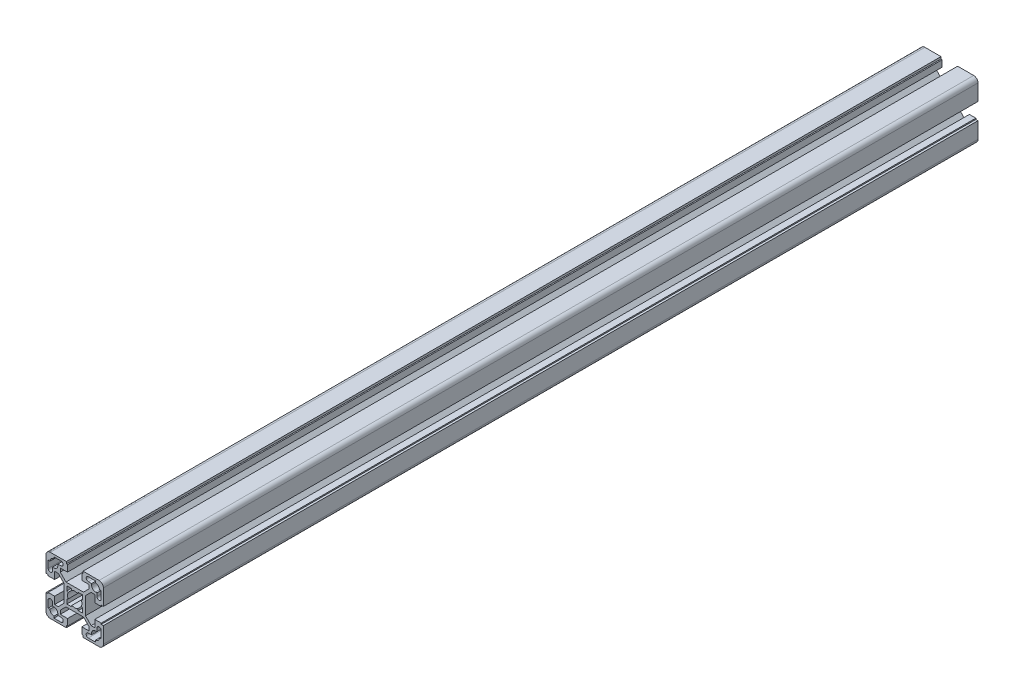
ISO-10303-21;
HEADER;
FILE_DESCRIPTION(('STEP AP214'),'2;1');
FILE_NAME('part.step','',(''),(''),'','','');
FILE_SCHEMA(('AUTOMOTIVE_DESIGN { 1 0 10303 214 1 1 1 1 }'));
ENDSEC;
DATA;
#1=APPLICATION_CONTEXT('core data for automotive mechanical design processes');
#2=APPLICATION_PROTOCOL_DEFINITION('international standard','automotive_design',2000,#1);
#3=PRODUCT_CONTEXT('',#1,'mechanical');
#4=PRODUCT('Part','Part','',(#3));
#5=PRODUCT_RELATED_PRODUCT_CATEGORY('part','',(#4));
#6=PRODUCT_DEFINITION_FORMATION('','',#4);
#7=PRODUCT_DEFINITION_CONTEXT('part definition',#1,'design');
#8=PRODUCT_DEFINITION('design','',#6,#7);
#9=PRODUCT_DEFINITION_SHAPE('','',#8);
#10=(LENGTH_UNIT() NAMED_UNIT(*) SI_UNIT(.MILLI.,.METRE.));
#11=(NAMED_UNIT(*) PLANE_ANGLE_UNIT() SI_UNIT($,.RADIAN.));
#12=(NAMED_UNIT(*) SI_UNIT($,.STERADIAN.) SOLID_ANGLE_UNIT());
#13=UNCERTAINTY_MEASURE_WITH_UNIT(LENGTH_MEASURE(1.E-05),#10,'distance_accuracy_value','');
#14=(GEOMETRIC_REPRESENTATION_CONTEXT(3) GLOBAL_UNCERTAINTY_ASSIGNED_CONTEXT((#13)) GLOBAL_UNIT_ASSIGNED_CONTEXT((#10,
#11,#12)) REPRESENTATION_CONTEXT('',''));
#15=CARTESIAN_POINT('',(0.,0.,0.));
#16=DIRECTION('',(0.,0.,1.));
#17=DIRECTION('',(1.,0.,0.));
#18=AXIS2_PLACEMENT_3D('',#15,#16,#17);
#19=CARTESIAN_POINT('',(6.08578643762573,-7.50000000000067,-584.6));
#20=DIRECTION('',(-0.707106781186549,-0.707106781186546,0.));
#21=DIRECTION('',(0.707106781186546,-0.707106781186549,0.));
#22=AXIS2_PLACEMENT_3D('',#19,#20,#21);
#23=PLANE('',#22);
#24=DIRECTION('',(0.707106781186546,-0.707106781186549,0.));
#25=VECTOR('',#24,1.);
#26=CARTESIAN_POINT('',(6.08578643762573,-7.50000000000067,25.));
#27=LINE('',#26,#25);
#28=CARTESIAN_POINT('',(6.08578643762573,-7.50000000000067,25.));
#29=VERTEX_POINT('',#28);
#30=CARTESIAN_POINT('',(10.0500000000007,-11.4642135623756,25.));
#31=VERTEX_POINT('',#30);
#32=EDGE_CURVE('E1370',#29,#31,#27,.T.);
#33=ORIENTED_EDGE('',*,*,#32,.F.);
#34=DIRECTION('',(0.,0.,1.));
#35=VECTOR('',#34,1.);
#36=CARTESIAN_POINT('',(6.08578643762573,-7.50000000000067,-584.6));
#37=LINE('',#36,#35);
#38=CARTESIAN_POINT('',(6.08578643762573,-7.50000000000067,-584.6));
#39=VERTEX_POINT('',#38);
#40=EDGE_CURVE('E11',#39,#29,#37,.T.);
#41=ORIENTED_EDGE('',*,*,#40,.F.);
#42=DIRECTION('',(0.707106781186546,-0.707106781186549,0.));
#43=VECTOR('',#42,1.);
#44=CARTESIAN_POINT('',(6.08578643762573,-7.50000000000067,-584.6));
#45=LINE('',#44,#43);
#46=CARTESIAN_POINT('',(10.0500000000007,-11.4642135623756,-584.6));
#47=VERTEX_POINT('',#46);
#48=EDGE_CURVE('E1393',#39,#47,#45,.T.);
#49=ORIENTED_EDGE('',*,*,#48,.T.);
#50=DIRECTION('',(0.,0.,1.));
#51=VECTOR('',#50,1.);
#52=CARTESIAN_POINT('',(10.0500000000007,-11.4642135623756,-584.6));
#53=LINE('',#52,#51);
#54=EDGE_CURVE('E38',#47,#31,#53,.T.);
#55=ORIENTED_EDGE('',*,*,#54,.T.);
#56=EDGE_LOOP('',(#33,#41,#49,#55));
#57=FACE_BOUND('',#56,.T.);
#58=ADVANCED_FACE('F35',(#57),#23,.T.);
#59=CARTESIAN_POINT('',(-6.08578643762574,-7.50000000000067,-584.6));
#60=DIRECTION('',(0.,-1.,0.));
#61=DIRECTION('',(1.,0.,0.));
#62=AXIS2_PLACEMENT_3D('',#59,#60,#61);
#63=PLANE('',#62);
#64=DIRECTION('',(1.,0.,0.));
#65=VECTOR('',#64,1.);
#66=CARTESIAN_POINT('',(-6.08578643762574,-7.50000000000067,25.));
#67=LINE('',#66,#65);
#68=CARTESIAN_POINT('',(-6.08578643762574,-7.50000000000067,25.));
#69=VERTEX_POINT('',#68);
#70=EDGE_CURVE('E1397',#69,#29,#67,.T.);
#71=ORIENTED_EDGE('',*,*,#70,.F.);
#72=DIRECTION('',(0.,0.,1.));
#73=VECTOR('',#72,1.);
#74=CARTESIAN_POINT('',(-6.08578643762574,-7.50000000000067,-584.6));
#75=LINE('',#74,#73);
#76=CARTESIAN_POINT('',(-6.08578643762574,-7.50000000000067,-584.6));
#77=VERTEX_POINT('',#76);
#78=EDGE_CURVE('E43',#77,#69,#75,.T.);
#79=ORIENTED_EDGE('',*,*,#78,.F.);
#80=DIRECTION('',(1.,0.,0.));
#81=VECTOR('',#80,1.);
#82=CARTESIAN_POINT('',(-6.08578643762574,-7.50000000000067,-584.6));
#83=LINE('',#82,#81);
#84=EDGE_CURVE('E1583',#77,#39,#83,.T.);
#85=ORIENTED_EDGE('',*,*,#84,.T.);
#86=ORIENTED_EDGE('',*,*,#40,.T.);
#87=EDGE_LOOP('',(#71,#79,#85,#86));
#88=FACE_BOUND('',#87,.T.);
#89=ADVANCED_FACE('F1910',(#88),#63,.T.);
#90=CARTESIAN_POINT('',(-10.0500000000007,-11.4642135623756,-584.6));
#91=DIRECTION('',(0.707106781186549,-0.707106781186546,0.));
#92=DIRECTION('',(0.707106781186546,0.707106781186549,0.));
#93=AXIS2_PLACEMENT_3D('',#90,#91,#92);
#94=PLANE('',#93);
#95=DIRECTION('',(0.707106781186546,0.707106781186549,0.));
#96=VECTOR('',#95,1.);
#97=CARTESIAN_POINT('',(-10.0500000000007,-11.4642135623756,25.));
#98=LINE('',#97,#96);
#99=CARTESIAN_POINT('',(-10.0500000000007,-11.4642135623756,25.));
#100=VERTEX_POINT('',#99);
#101=EDGE_CURVE('E1771',#100,#69,#98,.T.);
#102=ORIENTED_EDGE('',*,*,#101,.F.);
#103=DIRECTION('',(0.,0.,1.));
#104=VECTOR('',#103,1.);
#105=CARTESIAN_POINT('',(-10.0500000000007,-11.4642135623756,-584.6));
#106=LINE('',#105,#104);
#107=CARTESIAN_POINT('',(-10.0500000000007,-11.4642135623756,-584.6));
#108=VERTEX_POINT('',#107);
#109=EDGE_CURVE('E1777',#108,#100,#106,.T.);
#110=ORIENTED_EDGE('',*,*,#109,.F.);
#111=DIRECTION('',(0.707106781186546,0.707106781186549,0.));
#112=VECTOR('',#111,1.);
#113=CARTESIAN_POINT('',(-10.0500000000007,-11.4642135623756,-584.6));
#114=LINE('',#113,#112);
#115=EDGE_CURVE('E1580',#108,#77,#114,.T.);
#116=ORIENTED_EDGE('',*,*,#115,.T.);
#117=ORIENTED_EDGE('',*,*,#78,.T.);
#118=EDGE_LOOP('',(#102,#110,#116,#117));
#119=FACE_BOUND('',#118,.T.);
#120=ADVANCED_FACE('F2154',(#119),#94,.T.);
#121=CARTESIAN_POINT('',(-10.0500000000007,-14.0000000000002,-584.6));
#122=DIRECTION('',(1.,0.,0.));
#123=DIRECTION('',(0.,0.,-1.));
#124=AXIS2_PLACEMENT_3D('',#121,#122,#123);
#125=PLANE('',#124);
#126=DIRECTION('',(0.,1.,0.));
#127=VECTOR('',#126,1.);
#128=CARTESIAN_POINT('',(-10.0500000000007,-14.0000000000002,25.));
#129=LINE('',#128,#127);
#130=CARTESIAN_POINT('',(-10.0500000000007,-14.0000000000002,25.));
#131=VERTEX_POINT('',#130);
#132=EDGE_CURVE('E1768',#131,#100,#129,.T.);
#133=ORIENTED_EDGE('',*,*,#132,.F.);
#134=DIRECTION('',(0.,0.,1.));
#135=VECTOR('',#134,1.);
#136=CARTESIAN_POINT('',(-10.0500000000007,-14.0000000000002,-584.6));
#137=LINE('',#136,#135);
#138=CARTESIAN_POINT('',(-10.0500000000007,-14.0000000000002,-584.6));
#139=VERTEX_POINT('',#138);
#140=EDGE_CURVE('E1779',#139,#131,#137,.T.);
#141=ORIENTED_EDGE('',*,*,#140,.F.);
#142=DIRECTION('',(0.,1.,0.));
#143=VECTOR('',#142,1.);
#144=CARTESIAN_POINT('',(-10.0500000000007,-14.0000000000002,-584.6));
#145=LINE('',#144,#143);
#146=EDGE_CURVE('E1577',#139,#108,#145,.T.);
#147=ORIENTED_EDGE('',*,*,#146,.T.);
#148=ORIENTED_EDGE('',*,*,#109,.T.);
#149=EDGE_LOOP('',(#133,#141,#147,#148));
#150=FACE_BOUND('',#149,.T.);
#151=ADVANCED_FACE('F2152',(#150),#125,.T.);
#152=CARTESIAN_POINT('',(-5.0000000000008,-14.0000000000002,-584.6));
#153=DIRECTION('',(0.,1.,0.));
#154=DIRECTION('',(0.,0.,1.));
#155=AXIS2_PLACEMENT_3D('',#152,#153,#154);
#156=PLANE('',#155);
#157=DIRECTION('',(-1.,0.,0.));
#158=VECTOR('',#157,1.);
#159=CARTESIAN_POINT('',(-5.0000000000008,-14.0000000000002,25.));
#160=LINE('',#159,#158);
#161=CARTESIAN_POINT('',(-5.0000000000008,-14.0000000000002,25.));
#162=VERTEX_POINT('',#161);
#163=EDGE_CURVE('E1765',#162,#131,#160,.T.);
#164=ORIENTED_EDGE('',*,*,#163,.F.);
#165=DIRECTION('',(0.,0.,1.));
#166=VECTOR('',#165,1.);
#167=CARTESIAN_POINT('',(-5.0000000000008,-14.0000000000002,-584.6));
#168=LINE('',#167,#166);
#169=CARTESIAN_POINT('',(-5.0000000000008,-14.0000000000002,-584.6));
#170=VERTEX_POINT('',#169);
#171=EDGE_CURVE('E1781',#170,#162,#168,.T.);
#172=ORIENTED_EDGE('',*,*,#171,.F.);
#173=DIRECTION('',(-1.,0.,0.));
#174=VECTOR('',#173,1.);
#175=CARTESIAN_POINT('',(-5.0000000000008,-14.0000000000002,-584.6));
#176=LINE('',#175,#174);
#177=EDGE_CURVE('E1574',#170,#139,#176,.T.);
#178=ORIENTED_EDGE('',*,*,#177,.T.);
#179=ORIENTED_EDGE('',*,*,#140,.T.);
#180=EDGE_LOOP('',(#164,#172,#178,#179));
#181=FACE_BOUND('',#180,.T.);
#182=ADVANCED_FACE('F2148',(#181),#156,.T.);
#183=CARTESIAN_POINT('',(-5.0000000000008,-18.5000000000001,-584.6));
#184=DIRECTION('',(1.,0.,0.));
#185=DIRECTION('',(0.,0.,-1.));
#186=AXIS2_PLACEMENT_3D('',#183,#184,#185);
#187=PLANE('',#186);
#188=DIRECTION('',(0.,1.,0.));
#189=VECTOR('',#188,1.);
#190=CARTESIAN_POINT('',(-5.0000000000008,-18.5000000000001,25.));
#191=LINE('',#190,#189);
#192=CARTESIAN_POINT('',(-5.0000000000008,-18.5000000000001,25.));
#193=VERTEX_POINT('',#192);
#194=EDGE_CURVE('E1762',#193,#162,#191,.T.);
#195=ORIENTED_EDGE('',*,*,#194,.F.);
#196=DIRECTION('',(0.,0.,1.));
#197=VECTOR('',#196,1.);
#198=CARTESIAN_POINT('',(-5.0000000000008,-18.5000000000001,-584.6));
#199=LINE('',#198,#197);
#200=CARTESIAN_POINT('',(-5.0000000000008,-18.5000000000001,-584.6));
#201=VERTEX_POINT('',#200);
#202=EDGE_CURVE('E1783',#201,#193,#199,.T.);
#203=ORIENTED_EDGE('',*,*,#202,.F.);
#204=DIRECTION('',(0.,1.,0.));
#205=VECTOR('',#204,1.);
#206=CARTESIAN_POINT('',(-5.0000000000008,-18.5000000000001,-584.6));
#207=LINE('',#206,#205);
#208=EDGE_CURVE('E1571',#201,#170,#207,.T.);
#209=ORIENTED_EDGE('',*,*,#208,.T.);
#210=ORIENTED_EDGE('',*,*,#171,.T.);
#211=EDGE_LOOP('',(#195,#203,#209,#210));
#212=FACE_BOUND('',#211,.T.);
#213=ADVANCED_FACE('F2144',(#212),#187,.T.);
#214=CARTESIAN_POINT('',(-5.80000000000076,-18.5000000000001,-584.6));
#215=DIRECTION('',(0.,-1.,0.));
#216=DIRECTION('',(0.,0.,-1.));
#217=AXIS2_PLACEMENT_3D('',#214,#215,#216);
#218=PLANE('',#217);
#219=DIRECTION('',(1.,0.,0.));
#220=VECTOR('',#219,1.);
#221=CARTESIAN_POINT('',(-5.80000000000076,-18.5000000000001,25.));
#222=LINE('',#221,#220);
#223=CARTESIAN_POINT('',(-5.80000000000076,-18.5000000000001,25.));
#224=VERTEX_POINT('',#223);
#225=EDGE_CURVE('E1759',#224,#193,#222,.T.);
#226=ORIENTED_EDGE('',*,*,#225,.F.);
#227=DIRECTION('',(0.,0.,1.));
#228=VECTOR('',#227,1.);
#229=CARTESIAN_POINT('',(-5.80000000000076,-18.5000000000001,-584.6));
#230=LINE('',#229,#228);
#231=CARTESIAN_POINT('',(-5.80000000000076,-18.5000000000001,-584.6));
#232=VERTEX_POINT('',#231);
#233=EDGE_CURVE('E1785',#232,#224,#230,.T.);
#234=ORIENTED_EDGE('',*,*,#233,.F.);
#235=DIRECTION('',(1.,0.,0.));
#236=VECTOR('',#235,1.);
#237=CARTESIAN_POINT('',(-5.80000000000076,-18.5000000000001,-584.6));
#238=LINE('',#237,#236);
#239=EDGE_CURVE('E1568',#232,#201,#238,.T.);
#240=ORIENTED_EDGE('',*,*,#239,.T.);
#241=ORIENTED_EDGE('',*,*,#202,.T.);
#242=EDGE_LOOP('',(#226,#234,#240,#241));
#243=FACE_BOUND('',#242,.T.);
#244=ADVANCED_FACE('F2140',(#243),#218,.T.);
#245=CARTESIAN_POINT('',(-5.80000000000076,-20.,-584.6));
#246=DIRECTION('',(1.,0.,0.));
#247=DIRECTION('',(0.,0.,-1.));
#248=AXIS2_PLACEMENT_3D('',#245,#246,#247);
#249=PLANE('',#248);
#250=DIRECTION('',(0.,1.,0.));
#251=VECTOR('',#250,1.);
#252=CARTESIAN_POINT('',(-5.80000000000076,-20.,25.));
#253=LINE('',#252,#251);
#254=CARTESIAN_POINT('',(-5.80000000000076,-20.,25.));
#255=VERTEX_POINT('',#254);
#256=EDGE_CURVE('E1756',#255,#224,#253,.T.);
#257=ORIENTED_EDGE('',*,*,#256,.F.);
#258=DIRECTION('',(0.,0.,1.));
#259=VECTOR('',#258,1.);
#260=CARTESIAN_POINT('',(-5.80000000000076,-20.,-584.6));
#261=LINE('',#260,#259);
#262=CARTESIAN_POINT('',(-5.80000000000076,-20.,-584.6));
#263=VERTEX_POINT('',#262);
#264=EDGE_CURVE('E1787',#263,#255,#261,.T.);
#265=ORIENTED_EDGE('',*,*,#264,.F.);
#266=DIRECTION('',(0.,1.,0.));
#267=VECTOR('',#266,1.);
#268=CARTESIAN_POINT('',(-5.80000000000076,-20.,-584.6));
#269=LINE('',#268,#267);
#270=EDGE_CURVE('E1565',#263,#232,#269,.T.);
#271=ORIENTED_EDGE('',*,*,#270,.T.);
#272=ORIENTED_EDGE('',*,*,#233,.T.);
#273=EDGE_LOOP('',(#257,#265,#271,#272));
#274=FACE_BOUND('',#273,.T.);
#275=ADVANCED_FACE('F2136',(#274),#249,.T.);
#276=CARTESIAN_POINT('',(-17.,-20.,-584.6));
#277=DIRECTION('',(0.,-1.,0.));
#278=DIRECTION('',(0.,0.,-1.));
#279=AXIS2_PLACEMENT_3D('',#276,#277,#278);
#280=PLANE('',#279);
#281=DIRECTION('',(1.,0.,0.));
#282=VECTOR('',#281,1.);
#283=CARTESIAN_POINT('',(-17.,-20.,25.));
#284=LINE('',#283,#282);
#285=CARTESIAN_POINT('',(-17.,-20.,25.));
#286=VERTEX_POINT('',#285);
#287=EDGE_CURVE('E1753',#286,#255,#284,.T.);
#288=ORIENTED_EDGE('',*,*,#287,.F.);
#289=DIRECTION('',(0.,0.,1.));
#290=VECTOR('',#289,1.);
#291=CARTESIAN_POINT('',(-17.,-20.,-584.6));
#292=LINE('',#291,#290);
#293=CARTESIAN_POINT('',(-17.,-20.,-584.6));
#294=VERTEX_POINT('',#293);
#295=EDGE_CURVE('E1789',#294,#286,#292,.T.);
#296=ORIENTED_EDGE('',*,*,#295,.F.);
#297=DIRECTION('',(1.,0.,0.));
#298=VECTOR('',#297,1.);
#299=CARTESIAN_POINT('',(-17.,-20.,-584.6));
#300=LINE('',#299,#298);
#301=EDGE_CURVE('E1562',#294,#263,#300,.T.);
#302=ORIENTED_EDGE('',*,*,#301,.T.);
#303=ORIENTED_EDGE('',*,*,#264,.T.);
#304=EDGE_LOOP('',(#288,#296,#302,#303));
#305=FACE_BOUND('',#304,.T.);
#306=ADVANCED_FACE('F2132',(#305),#280,.T.);
#307=CARTESIAN_POINT('',(-17.,-17.,-584.6));
#308=DIRECTION('',(0.,0.,1.));
#309=DIRECTION('',(1.,0.,0.));
#310=AXIS2_PLACEMENT_3D('',#307,#308,#309);
#311=CYLINDRICAL_SURFACE('',#310,3.00000000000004);
#312=CARTESIAN_POINT('',(-17.,-17.,25.));
#313=DIRECTION('',(0.,0.,1.));
#314=DIRECTION('',(1.,0.,0.));
#315=AXIS2_PLACEMENT_3D('',#312,#313,#314);
#316=CIRCLE('',#315,3.00000000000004);
#317=CARTESIAN_POINT('',(-20.,-17.,25.));
#318=VERTEX_POINT('',#317);
#319=EDGE_CURVE('E1750',#318,#286,#316,.T.);
#320=ORIENTED_EDGE('',*,*,#319,.F.);
#321=DIRECTION('',(0.,0.,1.));
#322=VECTOR('',#321,1.);
#323=CARTESIAN_POINT('',(-20.,-17.,-584.6));
#324=LINE('',#323,#322);
#325=CARTESIAN_POINT('',(-20.,-17.,-584.6));
#326=VERTEX_POINT('',#325);
#327=EDGE_CURVE('E1791',#326,#318,#324,.T.);
#328=ORIENTED_EDGE('',*,*,#327,.F.);
#329=CARTESIAN_POINT('',(-17.,-17.,-584.6));
#330=DIRECTION('',(0.,0.,1.));
#331=DIRECTION('',(1.,0.,0.));
#332=AXIS2_PLACEMENT_3D('',#329,#330,#331);
#333=CIRCLE('',#332,3.00000000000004);
#334=EDGE_CURVE('E1559',#326,#294,#333,.T.);
#335=ORIENTED_EDGE('',*,*,#334,.T.);
#336=ORIENTED_EDGE('',*,*,#295,.T.);
#337=EDGE_LOOP('',(#320,#328,#335,#336));
#338=FACE_BOUND('',#337,.T.);
#339=ADVANCED_FACE('F2128',(#338),#311,.T.);
#340=CARTESIAN_POINT('',(-20.,-5.79999999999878,-584.6));
#341=DIRECTION('',(-1.,0.,0.));
#342=DIRECTION('',(0.,0.,1.));
#343=AXIS2_PLACEMENT_3D('',#340,#341,#342);
#344=PLANE('',#343);
#345=DIRECTION('',(0.,-1.,0.));
#346=VECTOR('',#345,1.);
#347=CARTESIAN_POINT('',(-20.,-5.79999999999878,25.));
#348=LINE('',#347,#346);
#349=CARTESIAN_POINT('',(-20.,-5.79999999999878,25.));
#350=VERTEX_POINT('',#349);
#351=EDGE_CURVE('E1747',#350,#318,#348,.T.);
#352=ORIENTED_EDGE('',*,*,#351,.F.);
#353=DIRECTION('',(0.,0.,1.));
#354=VECTOR('',#353,1.);
#355=CARTESIAN_POINT('',(-20.,-5.79999999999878,-584.6));
#356=LINE('',#355,#354);
#357=CARTESIAN_POINT('',(-20.,-5.79999999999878,-584.6));
#358=VERTEX_POINT('',#357);
#359=EDGE_CURVE('E1793',#358,#350,#356,.T.);
#360=ORIENTED_EDGE('',*,*,#359,.F.);
#361=DIRECTION('',(0.,-1.,0.));
#362=VECTOR('',#361,1.);
#363=CARTESIAN_POINT('',(-20.,-5.79999999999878,-584.6));
#364=LINE('',#363,#362);
#365=EDGE_CURVE('E1556',#358,#326,#364,.T.);
#366=ORIENTED_EDGE('',*,*,#365,.T.);
#367=ORIENTED_EDGE('',*,*,#327,.T.);
#368=EDGE_LOOP('',(#352,#360,#366,#367));
#369=FACE_BOUND('',#368,.T.);
#370=ADVANCED_FACE('F2124',(#369),#344,.T.);
#371=CARTESIAN_POINT('',(-18.5000000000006,-5.79999999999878,-584.6));
#372=DIRECTION('',(0.,1.,0.));
#373=DIRECTION('',(0.,0.,1.));
#374=AXIS2_PLACEMENT_3D('',#371,#372,#373);
#375=PLANE('',#374);
#376=DIRECTION('',(-1.,0.,0.));
#377=VECTOR('',#376,1.);
#378=CARTESIAN_POINT('',(-18.5000000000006,-5.79999999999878,25.));
#379=LINE('',#378,#377);
#380=CARTESIAN_POINT('',(-18.5000000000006,-5.79999999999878,25.));
#381=VERTEX_POINT('',#380);
#382=EDGE_CURVE('E1744',#381,#350,#379,.T.);
#383=ORIENTED_EDGE('',*,*,#382,.F.);
#384=DIRECTION('',(0.,0.,1.));
#385=VECTOR('',#384,1.);
#386=CARTESIAN_POINT('',(-18.5000000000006,-5.79999999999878,-584.6));
#387=LINE('',#386,#385);
#388=CARTESIAN_POINT('',(-18.5000000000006,-5.79999999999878,-584.6));
#389=VERTEX_POINT('',#388);
#390=EDGE_CURVE('E1795',#389,#381,#387,.T.);
#391=ORIENTED_EDGE('',*,*,#390,.F.);
#392=DIRECTION('',(-1.,0.,0.));
#393=VECTOR('',#392,1.);
#394=CARTESIAN_POINT('',(-18.5000000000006,-5.79999999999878,-584.6));
#395=LINE('',#394,#393);
#396=EDGE_CURVE('E1553',#389,#358,#395,.T.);
#397=ORIENTED_EDGE('',*,*,#396,.T.);
#398=ORIENTED_EDGE('',*,*,#359,.T.);
#399=EDGE_LOOP('',(#383,#391,#397,#398));
#400=FACE_BOUND('',#399,.T.);
#401=ADVANCED_FACE('F2120',(#400),#375,.T.);
#402=CARTESIAN_POINT('',(-18.5000000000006,-4.99999999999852,-584.6));
#403=DIRECTION('',(-1.,0.,0.));
#404=DIRECTION('',(0.,0.,1.));
#405=AXIS2_PLACEMENT_3D('',#402,#403,#404);
#406=PLANE('',#405);
#407=DIRECTION('',(0.,-1.,0.));
#408=VECTOR('',#407,1.);
#409=CARTESIAN_POINT('',(-18.5000000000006,-4.99999999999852,25.));
#410=LINE('',#409,#408);
#411=CARTESIAN_POINT('',(-18.5000000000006,-4.99999999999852,25.));
#412=VERTEX_POINT('',#411);
#413=EDGE_CURVE('E1741',#412,#381,#410,.T.);
#414=ORIENTED_EDGE('',*,*,#413,.F.);
#415=DIRECTION('',(0.,0.,1.));
#416=VECTOR('',#415,1.);
#417=CARTESIAN_POINT('',(-18.5000000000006,-4.99999999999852,-584.6));
#418=LINE('',#417,#416);
#419=CARTESIAN_POINT('',(-18.5000000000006,-4.99999999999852,-584.6));
#420=VERTEX_POINT('',#419);
#421=EDGE_CURVE('E1797',#420,#412,#418,.T.);
#422=ORIENTED_EDGE('',*,*,#421,.F.);
#423=DIRECTION('',(0.,-1.,0.));
#424=VECTOR('',#423,1.);
#425=CARTESIAN_POINT('',(-18.5000000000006,-4.99999999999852,-584.6));
#426=LINE('',#425,#424);
#427=EDGE_CURVE('E1550',#420,#389,#426,.T.);
#428=ORIENTED_EDGE('',*,*,#427,.T.);
#429=ORIENTED_EDGE('',*,*,#390,.T.);
#430=EDGE_LOOP('',(#414,#422,#428,#429));
#431=FACE_BOUND('',#430,.T.);
#432=ADVANCED_FACE('F2116',(#431),#406,.T.);
#433=CARTESIAN_POINT('',(-14.0000000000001,-4.99999999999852,-584.6));
#434=DIRECTION('',(0.,1.,0.));
#435=DIRECTION('',(0.,0.,1.));
#436=AXIS2_PLACEMENT_3D('',#433,#434,#435);
#437=PLANE('',#436);
#438=DIRECTION('',(-1.,0.,0.));
#439=VECTOR('',#438,1.);
#440=CARTESIAN_POINT('',(-14.0000000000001,-4.99999999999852,25.));
#441=LINE('',#440,#439);
#442=CARTESIAN_POINT('',(-14.0000000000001,-4.99999999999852,25.));
#443=VERTEX_POINT('',#442);
#444=EDGE_CURVE('E1738',#443,#412,#441,.T.);
#445=ORIENTED_EDGE('',*,*,#444,.F.);
#446=DIRECTION('',(0.,0.,1.));
#447=VECTOR('',#446,1.);
#448=CARTESIAN_POINT('',(-14.0000000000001,-4.99999999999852,-584.6));
#449=LINE('',#448,#447);
#450=CARTESIAN_POINT('',(-14.0000000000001,-4.99999999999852,-584.6));
#451=VERTEX_POINT('',#450);
#452=EDGE_CURVE('E1799',#451,#443,#449,.T.);
#453=ORIENTED_EDGE('',*,*,#452,.F.);
#454=DIRECTION('',(-1.,0.,0.));
#455=VECTOR('',#454,1.);
#456=CARTESIAN_POINT('',(-14.0000000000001,-4.99999999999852,-584.6));
#457=LINE('',#456,#455);
#458=EDGE_CURVE('E1547',#451,#420,#457,.T.);
#459=ORIENTED_EDGE('',*,*,#458,.T.);
#460=ORIENTED_EDGE('',*,*,#421,.T.);
#461=EDGE_LOOP('',(#445,#453,#459,#460));
#462=FACE_BOUND('',#461,.T.);
#463=ADVANCED_FACE('F2112',(#462),#437,.T.);
#464=CARTESIAN_POINT('',(-13.9999999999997,-10.0499999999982,-584.6));
#465=DIRECTION('',(1.,0.,0.));
#466=DIRECTION('',(0.,1.,0.));
#467=AXIS2_PLACEMENT_3D('',#464,#465,#466);
#468=PLANE('',#467);
#469=DIRECTION('',(0.,1.,0.));
#470=VECTOR('',#469,1.);
#471=CARTESIAN_POINT('',(-13.9999999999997,-10.0499999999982,25.));
#472=LINE('',#471,#470);
#473=CARTESIAN_POINT('',(-13.9999999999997,-10.0499999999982,25.));
#474=VERTEX_POINT('',#473);
#475=EDGE_CURVE('E1735',#474,#443,#472,.T.);
#476=ORIENTED_EDGE('',*,*,#475,.F.);
#477=DIRECTION('',(0.,0.,1.));
#478=VECTOR('',#477,1.);
#479=CARTESIAN_POINT('',(-13.9999999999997,-10.0499999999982,-584.6));
#480=LINE('',#479,#478);
#481=CARTESIAN_POINT('',(-13.9999999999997,-10.0499999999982,-584.6));
#482=VERTEX_POINT('',#481);
#483=EDGE_CURVE('E1801',#482,#474,#480,.T.);
#484=ORIENTED_EDGE('',*,*,#483,.F.);
#485=DIRECTION('',(0.,1.,0.));
#486=VECTOR('',#485,1.);
#487=CARTESIAN_POINT('',(-13.9999999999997,-10.0499999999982,-584.6));
#488=LINE('',#487,#486);
#489=EDGE_CURVE('E1544',#482,#451,#488,.T.);
#490=ORIENTED_EDGE('',*,*,#489,.T.);
#491=ORIENTED_EDGE('',*,*,#452,.T.);
#492=EDGE_LOOP('',(#476,#484,#490,#491));
#493=FACE_BOUND('',#492,.T.);
#494=ADVANCED_FACE('F2108',(#493),#468,.T.);
#495=CARTESIAN_POINT('',(-11.4642135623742,-10.0499999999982,-584.6));
#496=DIRECTION('',(0.,1.,0.));
#497=DIRECTION('',(0.,0.,1.));
#498=AXIS2_PLACEMENT_3D('',#495,#496,#497);
#499=PLANE('',#498);
#500=DIRECTION('',(-1.,0.,0.));
#501=VECTOR('',#500,1.);
#502=CARTESIAN_POINT('',(-11.4642135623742,-10.0499999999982,25.));
#503=LINE('',#502,#501);
#504=CARTESIAN_POINT('',(-11.4642135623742,-10.0499999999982,25.));
#505=VERTEX_POINT('',#504);
#506=EDGE_CURVE('E1732',#505,#474,#503,.T.);
#507=ORIENTED_EDGE('',*,*,#506,.F.);
#508=DIRECTION('',(0.,0.,1.));
#509=VECTOR('',#508,1.);
#510=CARTESIAN_POINT('',(-11.4642135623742,-10.0499999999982,-584.6));
#511=LINE('',#510,#509);
#512=CARTESIAN_POINT('',(-11.4642135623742,-10.0499999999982,-584.6));
#513=VERTEX_POINT('',#512);
#514=EDGE_CURVE('E1803',#513,#505,#511,.T.);
#515=ORIENTED_EDGE('',*,*,#514,.F.);
#516=DIRECTION('',(-1.,0.,0.));
#517=VECTOR('',#516,1.);
#518=CARTESIAN_POINT('',(-11.4642135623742,-10.0499999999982,-584.6));
#519=LINE('',#518,#517);
#520=EDGE_CURVE('E1541',#513,#482,#519,.T.);
#521=ORIENTED_EDGE('',*,*,#520,.T.);
#522=ORIENTED_EDGE('',*,*,#483,.T.);
#523=EDGE_LOOP('',(#507,#515,#521,#522));
#524=FACE_BOUND('',#523,.T.);
#525=ADVANCED_FACE('F2104',(#524),#499,.T.);
#526=CARTESIAN_POINT('',(-7.49999999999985,-6.08578643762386,-584.6));
#527=DIRECTION('',(-0.707106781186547,0.707106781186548,0.));
#528=DIRECTION('',(-0.707106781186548,-0.707106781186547,0.));
#529=AXIS2_PLACEMENT_3D('',#526,#527,#528);
#530=PLANE('',#529);
#531=DIRECTION('',(-0.707106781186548,-0.707106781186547,0.));
#532=VECTOR('',#531,1.);
#533=CARTESIAN_POINT('',(-7.49999999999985,-6.08578643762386,25.));
#534=LINE('',#533,#532);
#535=CARTESIAN_POINT('',(-7.49999999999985,-6.08578643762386,25.));
#536=VERTEX_POINT('',#535);
#537=EDGE_CURVE('E1729',#536,#505,#534,.T.);
#538=ORIENTED_EDGE('',*,*,#537,.F.);
#539=DIRECTION('',(0.,0.,1.));
#540=VECTOR('',#539,1.);
#541=CARTESIAN_POINT('',(-7.49999999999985,-6.08578643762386,-584.6));
#542=LINE('',#541,#540);
#543=CARTESIAN_POINT('',(-7.49999999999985,-6.08578643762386,-584.6));
#544=VERTEX_POINT('',#543);
#545=EDGE_CURVE('E1805',#544,#536,#542,.T.);
#546=ORIENTED_EDGE('',*,*,#545,.F.);
#547=DIRECTION('',(-0.707106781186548,-0.707106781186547,0.));
#548=VECTOR('',#547,1.);
#549=CARTESIAN_POINT('',(-7.49999999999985,-6.08578643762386,-584.6));
#550=LINE('',#549,#548);
#551=EDGE_CURVE('E1538',#544,#513,#550,.T.);
#552=ORIENTED_EDGE('',*,*,#551,.T.);
#553=ORIENTED_EDGE('',*,*,#514,.T.);
#554=EDGE_LOOP('',(#538,#546,#552,#553));
#555=FACE_BOUND('',#554,.T.);
#556=ADVANCED_FACE('F2100',(#555),#530,.T.);
#557=CARTESIAN_POINT('',(-7.49999999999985,6.0857864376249,-584.6));
#558=DIRECTION('',(-1.,0.,0.));
#559=DIRECTION('',(0.,-1.,0.));
#560=AXIS2_PLACEMENT_3D('',#557,#558,#559);
#561=PLANE('',#560);
#562=DIRECTION('',(0.,-1.,0.));
#563=VECTOR('',#562,1.);
#564=CARTESIAN_POINT('',(-7.49999999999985,6.0857864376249,25.));
#565=LINE('',#564,#563);
#566=CARTESIAN_POINT('',(-7.49999999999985,6.0857864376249,25.));
#567=VERTEX_POINT('',#566);
#568=EDGE_CURVE('E1726',#567,#536,#565,.T.);
#569=ORIENTED_EDGE('',*,*,#568,.F.);
#570=DIRECTION('',(0.,0.,1.));
#571=VECTOR('',#570,1.);
#572=CARTESIAN_POINT('',(-7.49999999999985,6.0857864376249,-584.6));
#573=LINE('',#572,#571);
#574=CARTESIAN_POINT('',(-7.49999999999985,6.0857864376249,-584.6));
#575=VERTEX_POINT('',#574);
#576=EDGE_CURVE('E1807',#575,#567,#573,.T.);
#577=ORIENTED_EDGE('',*,*,#576,.F.);
#578=DIRECTION('',(0.,-1.,0.));
#579=VECTOR('',#578,1.);
#580=CARTESIAN_POINT('',(-7.49999999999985,6.0857864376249,-584.6));
#581=LINE('',#580,#579);
#582=EDGE_CURVE('E1535',#575,#544,#581,.T.);
#583=ORIENTED_EDGE('',*,*,#582,.T.);
#584=ORIENTED_EDGE('',*,*,#545,.T.);
#585=EDGE_LOOP('',(#569,#577,#583,#584));
#586=FACE_BOUND('',#585,.T.);
#587=ADVANCED_FACE('F2096',(#586),#561,.T.);
#588=CARTESIAN_POINT('',(-11.464213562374,10.049999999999,-584.6));
#589=DIRECTION('',(-0.707106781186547,-0.707106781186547,0.));
#590=DIRECTION('',(0.707106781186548,-0.707106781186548,0.));
#591=AXIS2_PLACEMENT_3D('',#588,#589,#590);
#592=PLANE('',#591);
#593=DIRECTION('',(0.707106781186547,-0.707106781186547,0.));
#594=VECTOR('',#593,1.);
#595=CARTESIAN_POINT('',(-11.464213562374,10.049999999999,25.));
#596=LINE('',#595,#594);
#597=CARTESIAN_POINT('',(-11.464213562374,10.049999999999,25.));
#598=VERTEX_POINT('',#597);
#599=EDGE_CURVE('E1723',#598,#567,#596,.T.);
#600=ORIENTED_EDGE('',*,*,#599,.F.);
#601=DIRECTION('',(0.,0.,1.));
#602=VECTOR('',#601,1.);
#603=CARTESIAN_POINT('',(-11.464213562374,10.049999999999,-584.6));
#604=LINE('',#603,#602);
#605=CARTESIAN_POINT('',(-11.464213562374,10.049999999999,-584.6));
#606=VERTEX_POINT('',#605);
#607=EDGE_CURVE('E1809',#606,#598,#604,.T.);
#608=ORIENTED_EDGE('',*,*,#607,.F.);
#609=DIRECTION('',(0.707106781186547,-0.707106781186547,0.));
#610=VECTOR('',#609,1.);
#611=CARTESIAN_POINT('',(-11.464213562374,10.049999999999,-584.6));
#612=LINE('',#611,#610);
#613=EDGE_CURVE('E1532',#606,#575,#612,.T.);
#614=ORIENTED_EDGE('',*,*,#613,.T.);
#615=ORIENTED_EDGE('',*,*,#576,.T.);
#616=EDGE_LOOP('',(#600,#608,#614,#615));
#617=FACE_BOUND('',#616,.T.);
#618=ADVANCED_FACE('F2092',(#617),#592,.T.);
#619=CARTESIAN_POINT('',(-13.9999999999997,10.049999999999,-584.6));
#620=DIRECTION('',(0.,-1.,0.));
#621=DIRECTION('',(0.,0.,-1.));
#622=AXIS2_PLACEMENT_3D('',#619,#620,#621);
#623=PLANE('',#622);
#624=DIRECTION('',(1.,0.,0.));
#625=VECTOR('',#624,1.);
#626=CARTESIAN_POINT('',(-13.9999999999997,10.049999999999,25.));
#627=LINE('',#626,#625);
#628=CARTESIAN_POINT('',(-13.9999999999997,10.049999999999,25.));
#629=VERTEX_POINT('',#628);
#630=EDGE_CURVE('E1720',#629,#598,#627,.T.);
#631=ORIENTED_EDGE('',*,*,#630,.F.);
#632=DIRECTION('',(0.,0.,1.));
#633=VECTOR('',#632,1.);
#634=CARTESIAN_POINT('',(-13.9999999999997,10.049999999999,-584.6));
#635=LINE('',#634,#633);
#636=CARTESIAN_POINT('',(-13.9999999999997,10.049999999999,-584.6));
#637=VERTEX_POINT('',#636);
#638=EDGE_CURVE('E1811',#637,#629,#635,.T.);
#639=ORIENTED_EDGE('',*,*,#638,.F.);
#640=DIRECTION('',(1.,0.,0.));
#641=VECTOR('',#640,1.);
#642=CARTESIAN_POINT('',(-13.9999999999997,10.049999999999,-584.6));
#643=LINE('',#642,#641);
#644=EDGE_CURVE('E1529',#637,#606,#643,.T.);
#645=ORIENTED_EDGE('',*,*,#644,.T.);
#646=ORIENTED_EDGE('',*,*,#607,.T.);
#647=EDGE_LOOP('',(#631,#639,#645,#646));
#648=FACE_BOUND('',#647,.T.);
#649=ADVANCED_FACE('F2088',(#648),#623,.T.);
#650=CARTESIAN_POINT('',(-14.0000000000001,4.99999999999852,-584.6));
#651=DIRECTION('',(1.,0.,0.));
#652=DIRECTION('',(0.,1.,0.));
#653=AXIS2_PLACEMENT_3D('',#650,#651,#652);
#654=PLANE('',#653);
#655=DIRECTION('',(0.,1.,0.));
#656=VECTOR('',#655,1.);
#657=CARTESIAN_POINT('',(-14.0000000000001,4.99999999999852,25.));
#658=LINE('',#657,#656);
#659=CARTESIAN_POINT('',(-14.0000000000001,4.99999999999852,25.));
#660=VERTEX_POINT('',#659);
#661=EDGE_CURVE('E1717',#660,#629,#658,.T.);
#662=ORIENTED_EDGE('',*,*,#661,.F.);
#663=DIRECTION('',(0.,0.,1.));
#664=VECTOR('',#663,1.);
#665=CARTESIAN_POINT('',(-14.0000000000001,4.99999999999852,-584.6));
#666=LINE('',#665,#664);
#667=CARTESIAN_POINT('',(-14.0000000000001,4.99999999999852,-584.6));
#668=VERTEX_POINT('',#667);
#669=EDGE_CURVE('E1813',#668,#660,#666,.T.);
#670=ORIENTED_EDGE('',*,*,#669,.F.);
#671=DIRECTION('',(0.,1.,0.));
#672=VECTOR('',#671,1.);
#673=CARTESIAN_POINT('',(-14.0000000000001,4.99999999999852,-584.6));
#674=LINE('',#673,#672);
#675=EDGE_CURVE('E1526',#668,#637,#674,.T.);
#676=ORIENTED_EDGE('',*,*,#675,.T.);
#677=ORIENTED_EDGE('',*,*,#638,.T.);
#678=EDGE_LOOP('',(#662,#670,#676,#677));
#679=FACE_BOUND('',#678,.T.);
#680=ADVANCED_FACE('F2084',(#679),#654,.T.);
#681=CARTESIAN_POINT('',(-18.5000000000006,4.99999999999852,-584.6));
#682=DIRECTION('',(0.,-1.,0.));
#683=DIRECTION('',(0.,0.,-1.));
#684=AXIS2_PLACEMENT_3D('',#681,#682,#683);
#685=PLANE('',#684);
#686=DIRECTION('',(1.,0.,0.));
#687=VECTOR('',#686,1.);
#688=CARTESIAN_POINT('',(-18.5000000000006,4.99999999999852,25.));
#689=LINE('',#688,#687);
#690=CARTESIAN_POINT('',(-18.5000000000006,4.99999999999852,25.));
#691=VERTEX_POINT('',#690);
#692=EDGE_CURVE('E1714',#691,#660,#689,.T.);
#693=ORIENTED_EDGE('',*,*,#692,.F.);
#694=DIRECTION('',(0.,0.,1.));
#695=VECTOR('',#694,1.);
#696=CARTESIAN_POINT('',(-18.5000000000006,4.99999999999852,-584.6));
#697=LINE('',#696,#695);
#698=CARTESIAN_POINT('',(-18.5000000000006,4.99999999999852,-584.6));
#699=VERTEX_POINT('',#698);
#700=EDGE_CURVE('E1815',#699,#691,#697,.T.);
#701=ORIENTED_EDGE('',*,*,#700,.F.);
#702=DIRECTION('',(1.,0.,0.));
#703=VECTOR('',#702,1.);
#704=CARTESIAN_POINT('',(-18.5000000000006,4.99999999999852,-584.6));
#705=LINE('',#704,#703);
#706=EDGE_CURVE('E1523',#699,#668,#705,.T.);
#707=ORIENTED_EDGE('',*,*,#706,.T.);
#708=ORIENTED_EDGE('',*,*,#669,.T.);
#709=EDGE_LOOP('',(#693,#701,#707,#708));
#710=FACE_BOUND('',#709,.T.);
#711=ADVANCED_FACE('F2080',(#710),#685,.T.);
#712=CARTESIAN_POINT('',(-18.5000000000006,5.79999999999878,-584.6));
#713=DIRECTION('',(-1.,0.,0.));
#714=DIRECTION('',(0.,0.,1.));
#715=AXIS2_PLACEMENT_3D('',#712,#713,#714);
#716=PLANE('',#715);
#717=DIRECTION('',(0.,-1.,0.));
#718=VECTOR('',#717,1.);
#719=CARTESIAN_POINT('',(-18.5000000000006,5.79999999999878,25.));
#720=LINE('',#719,#718);
#721=CARTESIAN_POINT('',(-18.5000000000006,5.79999999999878,25.));
#722=VERTEX_POINT('',#721);
#723=EDGE_CURVE('E1711',#722,#691,#720,.T.);
#724=ORIENTED_EDGE('',*,*,#723,.F.);
#725=DIRECTION('',(0.,0.,1.));
#726=VECTOR('',#725,1.);
#727=CARTESIAN_POINT('',(-18.5000000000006,5.79999999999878,-584.6));
#728=LINE('',#727,#726);
#729=CARTESIAN_POINT('',(-18.5000000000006,5.79999999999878,-584.6));
#730=VERTEX_POINT('',#729);
#731=EDGE_CURVE('E1817',#730,#722,#728,.T.);
#732=ORIENTED_EDGE('',*,*,#731,.F.);
#733=DIRECTION('',(0.,-1.,0.));
#734=VECTOR('',#733,1.);
#735=CARTESIAN_POINT('',(-18.5000000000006,5.79999999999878,-584.6));
#736=LINE('',#735,#734);
#737=EDGE_CURVE('E1520',#730,#699,#736,.T.);
#738=ORIENTED_EDGE('',*,*,#737,.T.);
#739=ORIENTED_EDGE('',*,*,#700,.T.);
#740=EDGE_LOOP('',(#724,#732,#738,#739));
#741=FACE_BOUND('',#740,.T.);
#742=ADVANCED_FACE('F2076',(#741),#716,.T.);
#743=CARTESIAN_POINT('',(-20.,5.79999999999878,-584.6));
#744=DIRECTION('',(0.,-1.,0.));
#745=DIRECTION('',(0.,0.,-1.));
#746=AXIS2_PLACEMENT_3D('',#743,#744,#745);
#747=PLANE('',#746);
#748=DIRECTION('',(1.,0.,0.));
#749=VECTOR('',#748,1.);
#750=CARTESIAN_POINT('',(-20.,5.79999999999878,25.));
#751=LINE('',#750,#749);
#752=CARTESIAN_POINT('',(-20.,5.79999999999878,25.));
#753=VERTEX_POINT('',#752);
#754=EDGE_CURVE('E1708',#753,#722,#751,.T.);
#755=ORIENTED_EDGE('',*,*,#754,.F.);
#756=DIRECTION('',(0.,0.,1.));
#757=VECTOR('',#756,1.);
#758=CARTESIAN_POINT('',(-20.,5.79999999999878,-584.6));
#759=LINE('',#758,#757);
#760=CARTESIAN_POINT('',(-20.,5.79999999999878,-584.6));
#761=VERTEX_POINT('',#760);
#762=EDGE_CURVE('E1819',#761,#753,#759,.T.);
#763=ORIENTED_EDGE('',*,*,#762,.F.);
#764=DIRECTION('',(1.,0.,0.));
#765=VECTOR('',#764,1.);
#766=CARTESIAN_POINT('',(-20.,5.79999999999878,-584.6));
#767=LINE('',#766,#765);
#768=EDGE_CURVE('E1517',#761,#730,#767,.T.);
#769=ORIENTED_EDGE('',*,*,#768,.T.);
#770=ORIENTED_EDGE('',*,*,#731,.T.);
#771=EDGE_LOOP('',(#755,#763,#769,#770));
#772=FACE_BOUND('',#771,.T.);
#773=ADVANCED_FACE('F2072',(#772),#747,.T.);
#774=CARTESIAN_POINT('',(-20.,17.,-584.6));
#775=DIRECTION('',(-1.,0.,0.));
#776=DIRECTION('',(0.,0.,1.));
#777=AXIS2_PLACEMENT_3D('',#774,#775,#776);
#778=PLANE('',#777);
#779=DIRECTION('',(0.,-1.,0.));
#780=VECTOR('',#779,1.);
#781=CARTESIAN_POINT('',(-20.,17.,25.));
#782=LINE('',#781,#780);
#783=CARTESIAN_POINT('',(-20.,17.,25.));
#784=VERTEX_POINT('',#783);
#785=EDGE_CURVE('E1705',#784,#753,#782,.T.);
#786=ORIENTED_EDGE('',*,*,#785,.F.);
#787=DIRECTION('',(0.,0.,1.));
#788=VECTOR('',#787,1.);
#789=CARTESIAN_POINT('',(-20.,17.,-584.6));
#790=LINE('',#789,#788);
#791=CARTESIAN_POINT('',(-20.,17.,-584.6));
#792=VERTEX_POINT('',#791);
#793=EDGE_CURVE('E1821',#792,#784,#790,.T.);
#794=ORIENTED_EDGE('',*,*,#793,.F.);
#795=DIRECTION('',(0.,-1.,0.));
#796=VECTOR('',#795,1.);
#797=CARTESIAN_POINT('',(-20.,17.,-584.6));
#798=LINE('',#797,#796);
#799=EDGE_CURVE('E1514',#792,#761,#798,.T.);
#800=ORIENTED_EDGE('',*,*,#799,.T.);
#801=ORIENTED_EDGE('',*,*,#762,.T.);
#802=EDGE_LOOP('',(#786,#794,#800,#801));
#803=FACE_BOUND('',#802,.T.);
#804=ADVANCED_FACE('F2068',(#803),#778,.T.);
#805=CARTESIAN_POINT('',(-17.,17.,-584.6));
#806=DIRECTION('',(0.,0.,1.));
#807=DIRECTION('',(1.,0.,0.));
#808=AXIS2_PLACEMENT_3D('',#805,#806,#807);
#809=CYLINDRICAL_SURFACE('',#808,3.00000000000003);
#810=CARTESIAN_POINT('',(-17.,17.,25.));
#811=DIRECTION('',(0.,0.,1.));
#812=DIRECTION('',(1.,0.,0.));
#813=AXIS2_PLACEMENT_3D('',#810,#811,#812);
#814=CIRCLE('',#813,3.00000000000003);
#815=CARTESIAN_POINT('',(-17.,20.,25.));
#816=VERTEX_POINT('',#815);
#817=EDGE_CURVE('E1702',#816,#784,#814,.T.);
#818=ORIENTED_EDGE('',*,*,#817,.F.);
#819=DIRECTION('',(0.,0.,1.));
#820=VECTOR('',#819,1.);
#821=CARTESIAN_POINT('',(-17.,20.,-584.6));
#822=LINE('',#821,#820);
#823=CARTESIAN_POINT('',(-17.,20.,-584.6));
#824=VERTEX_POINT('',#823);
#825=EDGE_CURVE('E1823',#824,#816,#822,.T.);
#826=ORIENTED_EDGE('',*,*,#825,.F.);
#827=CARTESIAN_POINT('',(-17.,17.,-584.6));
#828=DIRECTION('',(0.,0.,1.));
#829=DIRECTION('',(1.,0.,0.));
#830=AXIS2_PLACEMENT_3D('',#827,#828,#829);
#831=CIRCLE('',#830,3.00000000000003);
#832=EDGE_CURVE('E1511',#824,#792,#831,.T.);
#833=ORIENTED_EDGE('',*,*,#832,.T.);
#834=ORIENTED_EDGE('',*,*,#793,.T.);
#835=EDGE_LOOP('',(#818,#826,#833,#834));
#836=FACE_BOUND('',#835,.T.);
#837=ADVANCED_FACE('F2064',(#836),#809,.T.);
#838=CARTESIAN_POINT('',(-5.80000000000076,20.,-584.6));
#839=DIRECTION('',(0.,1.,0.));
#840=DIRECTION('',(0.,0.,1.));
#841=AXIS2_PLACEMENT_3D('',#838,#839,#840);
#842=PLANE('',#841);
#843=DIRECTION('',(-1.,0.,0.));
#844=VECTOR('',#843,1.);
#845=CARTESIAN_POINT('',(-5.80000000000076,20.,25.));
#846=LINE('',#845,#844);
#847=CARTESIAN_POINT('',(-5.80000000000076,20.,25.));
#848=VERTEX_POINT('',#847);
#849=EDGE_CURVE('E1699',#848,#816,#846,.T.);
#850=ORIENTED_EDGE('',*,*,#849,.F.);
#851=DIRECTION('',(0.,0.,1.));
#852=VECTOR('',#851,1.);
#853=CARTESIAN_POINT('',(-5.80000000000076,20.,-584.6));
#854=LINE('',#853,#852);
#855=CARTESIAN_POINT('',(-5.80000000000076,20.,-584.6));
#856=VERTEX_POINT('',#855);
#857=EDGE_CURVE('E1825',#856,#848,#854,.T.);
#858=ORIENTED_EDGE('',*,*,#857,.F.);
#859=DIRECTION('',(-1.,0.,0.));
#860=VECTOR('',#859,1.);
#861=CARTESIAN_POINT('',(-5.80000000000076,20.,-584.6));
#862=LINE('',#861,#860);
#863=EDGE_CURVE('E1508',#856,#824,#862,.T.);
#864=ORIENTED_EDGE('',*,*,#863,.T.);
#865=ORIENTED_EDGE('',*,*,#825,.T.);
#866=EDGE_LOOP('',(#850,#858,#864,#865));
#867=FACE_BOUND('',#866,.T.);
#868=ADVANCED_FACE('F2060',(#867),#842,.T.);
#869=CARTESIAN_POINT('',(-5.80000000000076,18.5000000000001,-584.6));
#870=DIRECTION('',(1.,0.,0.));
#871=DIRECTION('',(0.,0.,-1.));
#872=AXIS2_PLACEMENT_3D('',#869,#870,#871);
#873=PLANE('',#872);
#874=DIRECTION('',(0.,1.,0.));
#875=VECTOR('',#874,1.);
#876=CARTESIAN_POINT('',(-5.80000000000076,18.5000000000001,25.));
#877=LINE('',#876,#875);
#878=CARTESIAN_POINT('',(-5.80000000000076,18.5000000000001,25.));
#879=VERTEX_POINT('',#878);
#880=EDGE_CURVE('E1696',#879,#848,#877,.T.);
#881=ORIENTED_EDGE('',*,*,#880,.F.);
#882=DIRECTION('',(0.,0.,1.));
#883=VECTOR('',#882,1.);
#884=CARTESIAN_POINT('',(-5.80000000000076,18.5000000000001,-584.6));
#885=LINE('',#884,#883);
#886=CARTESIAN_POINT('',(-5.80000000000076,18.5000000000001,-584.6));
#887=VERTEX_POINT('',#886);
#888=EDGE_CURVE('E1827',#887,#879,#885,.T.);
#889=ORIENTED_EDGE('',*,*,#888,.F.);
#890=DIRECTION('',(0.,1.,0.));
#891=VECTOR('',#890,1.);
#892=CARTESIAN_POINT('',(-5.80000000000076,18.5000000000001,-584.6));
#893=LINE('',#892,#891);
#894=EDGE_CURVE('E1505',#887,#856,#893,.T.);
#895=ORIENTED_EDGE('',*,*,#894,.T.);
#896=ORIENTED_EDGE('',*,*,#857,.T.);
#897=EDGE_LOOP('',(#881,#889,#895,#896));
#898=FACE_BOUND('',#897,.T.);
#899=ADVANCED_FACE('F2056',(#898),#873,.T.);
#900=CARTESIAN_POINT('',(-5.0000000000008,18.5000000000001,-584.6));
#901=DIRECTION('',(0.,1.,0.));
#902=DIRECTION('',(0.,0.,1.));
#903=AXIS2_PLACEMENT_3D('',#900,#901,#902);
#904=PLANE('',#903);
#905=DIRECTION('',(-1.,0.,0.));
#906=VECTOR('',#905,1.);
#907=CARTESIAN_POINT('',(-5.0000000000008,18.5000000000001,25.));
#908=LINE('',#907,#906);
#909=CARTESIAN_POINT('',(-5.0000000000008,18.5000000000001,25.));
#910=VERTEX_POINT('',#909);
#911=EDGE_CURVE('E1693',#910,#879,#908,.T.);
#912=ORIENTED_EDGE('',*,*,#911,.F.);
#913=DIRECTION('',(0.,0.,1.));
#914=VECTOR('',#913,1.);
#915=CARTESIAN_POINT('',(-5.0000000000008,18.5000000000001,-584.6));
#916=LINE('',#915,#914);
#917=CARTESIAN_POINT('',(-5.0000000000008,18.5000000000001,-584.6));
#918=VERTEX_POINT('',#917);
#919=EDGE_CURVE('E1829',#918,#910,#916,.T.);
#920=ORIENTED_EDGE('',*,*,#919,.F.);
#921=DIRECTION('',(-1.,0.,0.));
#922=VECTOR('',#921,1.);
#923=CARTESIAN_POINT('',(-5.0000000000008,18.5000000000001,-584.6));
#924=LINE('',#923,#922);
#925=EDGE_CURVE('E1502',#918,#887,#924,.T.);
#926=ORIENTED_EDGE('',*,*,#925,.T.);
#927=ORIENTED_EDGE('',*,*,#888,.T.);
#928=EDGE_LOOP('',(#912,#920,#926,#927));
#929=FACE_BOUND('',#928,.T.);
#930=ADVANCED_FACE('F2052',(#929),#904,.T.);
#931=CARTESIAN_POINT('',(-5.0000000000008,14.0000000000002,-584.6));
#932=DIRECTION('',(1.,0.,0.));
#933=DIRECTION('',(0.,0.,-1.));
#934=AXIS2_PLACEMENT_3D('',#931,#932,#933);
#935=PLANE('',#934);
#936=DIRECTION('',(0.,1.,0.));
#937=VECTOR('',#936,1.);
#938=CARTESIAN_POINT('',(-5.0000000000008,14.0000000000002,25.));
#939=LINE('',#938,#937);
#940=CARTESIAN_POINT('',(-5.0000000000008,14.0000000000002,25.));
#941=VERTEX_POINT('',#940);
#942=EDGE_CURVE('E1690',#941,#910,#939,.T.);
#943=ORIENTED_EDGE('',*,*,#942,.F.);
#944=DIRECTION('',(0.,0.,1.));
#945=VECTOR('',#944,1.);
#946=CARTESIAN_POINT('',(-5.0000000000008,14.0000000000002,-584.6));
#947=LINE('',#946,#945);
#948=CARTESIAN_POINT('',(-5.0000000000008,14.0000000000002,-584.6));
#949=VERTEX_POINT('',#948);
#950=EDGE_CURVE('E1831',#949,#941,#947,.T.);
#951=ORIENTED_EDGE('',*,*,#950,.F.);
#952=DIRECTION('',(0.,1.,0.));
#953=VECTOR('',#952,1.);
#954=CARTESIAN_POINT('',(-5.0000000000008,14.0000000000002,-584.6));
#955=LINE('',#954,#953);
#956=EDGE_CURVE('E1499',#949,#918,#955,.T.);
#957=ORIENTED_EDGE('',*,*,#956,.T.);
#958=ORIENTED_EDGE('',*,*,#919,.T.);
#959=EDGE_LOOP('',(#943,#951,#957,#958));
#960=FACE_BOUND('',#959,.T.);
#961=ADVANCED_FACE('F2048',(#960),#935,.T.);
#962=CARTESIAN_POINT('',(-10.0500000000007,14.0000000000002,-584.6));
#963=DIRECTION('',(0.,-1.,0.));
#964=DIRECTION('',(0.,0.,-1.));
#965=AXIS2_PLACEMENT_3D('',#962,#963,#964);
#966=PLANE('',#965);
#967=DIRECTION('',(1.,0.,0.));
#968=VECTOR('',#967,1.);
#969=CARTESIAN_POINT('',(-10.0500000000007,14.0000000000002,25.));
#970=LINE('',#969,#968);
#971=CARTESIAN_POINT('',(-10.0500000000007,14.0000000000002,25.));
#972=VERTEX_POINT('',#971);
#973=EDGE_CURVE('E1687',#972,#941,#970,.T.);
#974=ORIENTED_EDGE('',*,*,#973,.F.);
#975=DIRECTION('',(0.,0.,1.));
#976=VECTOR('',#975,1.);
#977=CARTESIAN_POINT('',(-10.0500000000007,14.0000000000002,-584.6));
#978=LINE('',#977,#976);
#979=CARTESIAN_POINT('',(-10.0500000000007,14.0000000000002,-584.6));
#980=VERTEX_POINT('',#979);
#981=EDGE_CURVE('E1833',#980,#972,#978,.T.);
#982=ORIENTED_EDGE('',*,*,#981,.F.);
#983=DIRECTION('',(1.,0.,0.));
#984=VECTOR('',#983,1.);
#985=CARTESIAN_POINT('',(-10.0500000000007,14.0000000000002,-584.6));
#986=LINE('',#985,#984);
#987=EDGE_CURVE('E1496',#980,#949,#986,.T.);
#988=ORIENTED_EDGE('',*,*,#987,.T.);
#989=ORIENTED_EDGE('',*,*,#950,.T.);
#990=EDGE_LOOP('',(#974,#982,#988,#989));
#991=FACE_BOUND('',#990,.T.);
#992=ADVANCED_FACE('F2044',(#991),#966,.T.);
#993=CARTESIAN_POINT('',(-10.0500000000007,11.4642135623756,-584.6));
#994=DIRECTION('',(1.,0.,0.));
#995=DIRECTION('',(0.,0.,-1.));
#996=AXIS2_PLACEMENT_3D('',#993,#994,#995);
#997=PLANE('',#996);
#998=DIRECTION('',(0.,1.,0.));
#999=VECTOR('',#998,1.);
#1000=CARTESIAN_POINT('',(-10.0500000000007,11.4642135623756,25.));
#1001=LINE('',#1000,#999);
#1002=CARTESIAN_POINT('',(-10.0500000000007,11.4642135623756,25.));
#1003=VERTEX_POINT('',#1002);
#1004=EDGE_CURVE('E1684',#1003,#972,#1001,.T.);
#1005=ORIENTED_EDGE('',*,*,#1004,.F.);
#1006=DIRECTION('',(0.,0.,1.));
#1007=VECTOR('',#1006,1.);
#1008=CARTESIAN_POINT('',(-10.0500000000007,11.4642135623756,-584.6));
#1009=LINE('',#1008,#1007);
#1010=CARTESIAN_POINT('',(-10.0500000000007,11.4642135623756,-584.6));
#1011=VERTEX_POINT('',#1010);
#1012=EDGE_CURVE('E1835',#1011,#1003,#1009,.T.);
#1013=ORIENTED_EDGE('',*,*,#1012,.F.);
#1014=DIRECTION('',(0.,1.,0.));
#1015=VECTOR('',#1014,1.);
#1016=CARTESIAN_POINT('',(-10.0500000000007,11.4642135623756,-584.6));
#1017=LINE('',#1016,#1015);
#1018=EDGE_CURVE('E1493',#1011,#980,#1017,.T.);
#1019=ORIENTED_EDGE('',*,*,#1018,.T.);
#1020=ORIENTED_EDGE('',*,*,#981,.T.);
#1021=EDGE_LOOP('',(#1005,#1013,#1019,#1020));
#1022=FACE_BOUND('',#1021,.T.);
#1023=ADVANCED_FACE('F2040',(#1022),#997,.T.);
#1024=CARTESIAN_POINT('',(-6.08578643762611,7.5000000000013,-584.6));
#1025=DIRECTION('',(0.707106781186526,0.707106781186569,0.));
#1026=DIRECTION('',(-0.707106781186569,0.707106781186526,0.));
#1027=AXIS2_PLACEMENT_3D('',#1024,#1025,#1026);
#1028=PLANE('',#1027);
#1029=DIRECTION('',(-0.707106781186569,0.707106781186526,0.));
#1030=VECTOR('',#1029,1.);
#1031=CARTESIAN_POINT('',(-6.08578643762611,7.5000000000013,25.));
#1032=LINE('',#1031,#1030);
#1033=CARTESIAN_POINT('',(-6.08578643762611,7.5000000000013,25.));
#1034=VERTEX_POINT('',#1033);
#1035=EDGE_CURVE('E1681',#1034,#1003,#1032,.T.);
#1036=ORIENTED_EDGE('',*,*,#1035,.F.);
#1037=DIRECTION('',(0.,0.,1.));
#1038=VECTOR('',#1037,1.);
#1039=CARTESIAN_POINT('',(-6.08578643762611,7.5000000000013,-584.6));
#1040=LINE('',#1039,#1038);
#1041=CARTESIAN_POINT('',(-6.08578643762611,7.5000000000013,-584.6));
#1042=VERTEX_POINT('',#1041);
#1043=EDGE_CURVE('E1837',#1042,#1034,#1040,.T.);
#1044=ORIENTED_EDGE('',*,*,#1043,.F.);
#1045=DIRECTION('',(-0.707106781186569,0.707106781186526,0.));
#1046=VECTOR('',#1045,1.);
#1047=CARTESIAN_POINT('',(-6.08578643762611,7.5000000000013,-584.6));
#1048=LINE('',#1047,#1046);
#1049=EDGE_CURVE('E1490',#1042,#1011,#1048,.T.);
#1050=ORIENTED_EDGE('',*,*,#1049,.T.);
#1051=ORIENTED_EDGE('',*,*,#1012,.T.);
#1052=EDGE_LOOP('',(#1036,#1044,#1050,#1051));
#1053=FACE_BOUND('',#1052,.T.);
#1054=ADVANCED_FACE('F2036',(#1053),#1028,.T.);
#1055=CARTESIAN_POINT('',(6.08578643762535,7.50000000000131,-584.6));
#1056=DIRECTION('',(0.,1.,0.));
#1057=DIRECTION('',(-1.,0.,0.));
#1058=AXIS2_PLACEMENT_3D('',#1055,#1056,#1057);
#1059=PLANE('',#1058);
#1060=DIRECTION('',(-1.,0.,0.));
#1061=VECTOR('',#1060,1.);
#1062=CARTESIAN_POINT('',(6.08578643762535,7.50000000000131,25.));
#1063=LINE('',#1062,#1061);
#1064=CARTESIAN_POINT('',(6.08578643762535,7.50000000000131,25.));
#1065=VERTEX_POINT('',#1064);
#1066=EDGE_CURVE('E1678',#1065,#1034,#1063,.T.);
#1067=ORIENTED_EDGE('',*,*,#1066,.F.);
#1068=DIRECTION('',(0.,0.,1.));
#1069=VECTOR('',#1068,1.);
#1070=CARTESIAN_POINT('',(6.08578643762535,7.50000000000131,-584.6));
#1071=LINE('',#1070,#1069);
#1072=CARTESIAN_POINT('',(6.08578643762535,7.50000000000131,-584.6));
#1073=VERTEX_POINT('',#1072);
#1074=EDGE_CURVE('E1839',#1073,#1065,#1071,.T.);
#1075=ORIENTED_EDGE('',*,*,#1074,.F.);
#1076=DIRECTION('',(-1.,0.,0.));
#1077=VECTOR('',#1076,1.);
#1078=CARTESIAN_POINT('',(6.08578643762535,7.50000000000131,-584.6));
#1079=LINE('',#1078,#1077);
#1080=EDGE_CURVE('E1487',#1073,#1042,#1079,.T.);
#1081=ORIENTED_EDGE('',*,*,#1080,.T.);
#1082=ORIENTED_EDGE('',*,*,#1043,.T.);
#1083=EDGE_LOOP('',(#1067,#1075,#1081,#1082));
#1084=FACE_BOUND('',#1083,.T.);
#1085=ADVANCED_FACE('F2032',(#1084),#1059,.T.);
#1086=CARTESIAN_POINT('',(10.0500000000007,11.4642135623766,-584.6));
#1087=DIRECTION('',(-0.707106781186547,0.707106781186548,0.));
#1088=DIRECTION('',(-0.707106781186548,-0.707106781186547,0.));
#1089=AXIS2_PLACEMENT_3D('',#1086,#1087,#1088);
#1090=PLANE('',#1089);
#1091=DIRECTION('',(-0.707106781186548,-0.707106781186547,0.));
#1092=VECTOR('',#1091,1.);
#1093=CARTESIAN_POINT('',(10.0500000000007,11.4642135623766,25.));
#1094=LINE('',#1093,#1092);
#1095=CARTESIAN_POINT('',(10.0500000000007,11.4642135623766,25.));
#1096=VERTEX_POINT('',#1095);
#1097=EDGE_CURVE('E1675',#1096,#1065,#1094,.T.);
#1098=ORIENTED_EDGE('',*,*,#1097,.F.);
#1099=DIRECTION('',(0.,0.,1.));
#1100=VECTOR('',#1099,1.);
#1101=CARTESIAN_POINT('',(10.0500000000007,11.4642135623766,-584.6));
#1102=LINE('',#1101,#1100);
#1103=CARTESIAN_POINT('',(10.0500000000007,11.4642135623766,-584.6));
#1104=VERTEX_POINT('',#1103);
#1105=EDGE_CURVE('E1841',#1104,#1096,#1102,.T.);
#1106=ORIENTED_EDGE('',*,*,#1105,.F.);
#1107=DIRECTION('',(-0.707106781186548,-0.707106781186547,0.));
#1108=VECTOR('',#1107,1.);
#1109=CARTESIAN_POINT('',(10.0500000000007,11.4642135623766,-584.6));
#1110=LINE('',#1109,#1108);
#1111=EDGE_CURVE('E1484',#1104,#1073,#1110,.T.);
#1112=ORIENTED_EDGE('',*,*,#1111,.T.);
#1113=ORIENTED_EDGE('',*,*,#1074,.T.);
#1114=EDGE_LOOP('',(#1098,#1106,#1112,#1113));
#1115=FACE_BOUND('',#1114,.T.);
#1116=ADVANCED_FACE('F2028',(#1115),#1090,.T.);
#1117=CARTESIAN_POINT('',(10.0500000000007,14.0000000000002,-584.6));
#1118=DIRECTION('',(-1.,0.,0.));
#1119=DIRECTION('',(0.,0.,1.));
#1120=AXIS2_PLACEMENT_3D('',#1117,#1118,#1119);
#1121=PLANE('',#1120);
#1122=DIRECTION('',(0.,-1.,0.));
#1123=VECTOR('',#1122,1.);
#1124=CARTESIAN_POINT('',(10.0500000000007,14.0000000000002,25.));
#1125=LINE('',#1124,#1123);
#1126=CARTESIAN_POINT('',(10.0500000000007,14.0000000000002,25.));
#1127=VERTEX_POINT('',#1126);
#1128=EDGE_CURVE('E1672',#1127,#1096,#1125,.T.);
#1129=ORIENTED_EDGE('',*,*,#1128,.F.);
#1130=DIRECTION('',(0.,0.,1.));
#1131=VECTOR('',#1130,1.);
#1132=CARTESIAN_POINT('',(10.0500000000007,14.0000000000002,-584.6));
#1133=LINE('',#1132,#1131);
#1134=CARTESIAN_POINT('',(10.0500000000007,14.0000000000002,-584.6));
#1135=VERTEX_POINT('',#1134);
#1136=EDGE_CURVE('E1843',#1135,#1127,#1133,.T.);
#1137=ORIENTED_EDGE('',*,*,#1136,.F.);
#1138=DIRECTION('',(0.,-1.,0.));
#1139=VECTOR('',#1138,1.);
#1140=CARTESIAN_POINT('',(10.0500000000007,14.0000000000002,-584.6));
#1141=LINE('',#1140,#1139);
#1142=EDGE_CURVE('E1481',#1135,#1104,#1141,.T.);
#1143=ORIENTED_EDGE('',*,*,#1142,.T.);
#1144=ORIENTED_EDGE('',*,*,#1105,.T.);
#1145=EDGE_LOOP('',(#1129,#1137,#1143,#1144));
#1146=FACE_BOUND('',#1145,.T.);
#1147=ADVANCED_FACE('F2024',(#1146),#1121,.T.);
#1148=CARTESIAN_POINT('',(5.00000000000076,14.0000000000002,-584.6));
#1149=DIRECTION('',(0.,-1.,0.));
#1150=DIRECTION('',(0.,0.,-1.));
#1151=AXIS2_PLACEMENT_3D('',#1148,#1149,#1150);
#1152=PLANE('',#1151);
#1153=DIRECTION('',(1.,0.,0.));
#1154=VECTOR('',#1153,1.);
#1155=CARTESIAN_POINT('',(5.00000000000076,14.0000000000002,25.));
#1156=LINE('',#1155,#1154);
#1157=CARTESIAN_POINT('',(5.00000000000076,14.0000000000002,25.));
#1158=VERTEX_POINT('',#1157);
#1159=EDGE_CURVE('E1669',#1158,#1127,#1156,.T.);
#1160=ORIENTED_EDGE('',*,*,#1159,.F.);
#1161=DIRECTION('',(0.,0.,1.));
#1162=VECTOR('',#1161,1.);
#1163=CARTESIAN_POINT('',(5.00000000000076,14.0000000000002,-584.6));
#1164=LINE('',#1163,#1162);
#1165=CARTESIAN_POINT('',(5.00000000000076,14.0000000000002,-584.6));
#1166=VERTEX_POINT('',#1165);
#1167=EDGE_CURVE('E1845',#1166,#1158,#1164,.T.);
#1168=ORIENTED_EDGE('',*,*,#1167,.F.);
#1169=DIRECTION('',(1.,0.,0.));
#1170=VECTOR('',#1169,1.);
#1171=CARTESIAN_POINT('',(5.00000000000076,14.0000000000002,-584.6));
#1172=LINE('',#1171,#1170);
#1173=EDGE_CURVE('E1478',#1166,#1135,#1172,.T.);
#1174=ORIENTED_EDGE('',*,*,#1173,.T.);
#1175=ORIENTED_EDGE('',*,*,#1136,.T.);
#1176=EDGE_LOOP('',(#1160,#1168,#1174,#1175));
#1177=FACE_BOUND('',#1176,.T.);
#1178=ADVANCED_FACE('F2020',(#1177),#1152,.T.);
#1179=CARTESIAN_POINT('',(5.00000000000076,18.5000000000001,-584.6));
#1180=DIRECTION('',(-1.,0.,0.));
#1181=DIRECTION('',(0.,0.,1.));
#1182=AXIS2_PLACEMENT_3D('',#1179,#1180,#1181);
#1183=PLANE('',#1182);
#1184=DIRECTION('',(0.,-1.,0.));
#1185=VECTOR('',#1184,1.);
#1186=CARTESIAN_POINT('',(5.00000000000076,18.5000000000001,25.));
#1187=LINE('',#1186,#1185);
#1188=CARTESIAN_POINT('',(5.00000000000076,18.5000000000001,25.));
#1189=VERTEX_POINT('',#1188);
#1190=EDGE_CURVE('E1666',#1189,#1158,#1187,.T.);
#1191=ORIENTED_EDGE('',*,*,#1190,.F.);
#1192=DIRECTION('',(0.,0.,1.));
#1193=VECTOR('',#1192,1.);
#1194=CARTESIAN_POINT('',(5.00000000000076,18.5000000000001,-584.6));
#1195=LINE('',#1194,#1193);
#1196=CARTESIAN_POINT('',(5.00000000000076,18.5000000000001,-584.6));
#1197=VERTEX_POINT('',#1196);
#1198=EDGE_CURVE('E1847',#1197,#1189,#1195,.T.);
#1199=ORIENTED_EDGE('',*,*,#1198,.F.);
#1200=DIRECTION('',(0.,-1.,0.));
#1201=VECTOR('',#1200,1.);
#1202=CARTESIAN_POINT('',(5.00000000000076,18.5000000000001,-584.6));
#1203=LINE('',#1202,#1201);
#1204=EDGE_CURVE('E1475',#1197,#1166,#1203,.T.);
#1205=ORIENTED_EDGE('',*,*,#1204,.T.);
#1206=ORIENTED_EDGE('',*,*,#1167,.T.);
#1207=EDGE_LOOP('',(#1191,#1199,#1205,#1206));
#1208=FACE_BOUND('',#1207,.T.);
#1209=ADVANCED_FACE('F2016',(#1208),#1183,.T.);
#1210=CARTESIAN_POINT('',(5.80000000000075,18.5000000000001,-584.6));
#1211=DIRECTION('',(0.,1.,0.));
#1212=DIRECTION('',(0.,0.,1.));
#1213=AXIS2_PLACEMENT_3D('',#1210,#1211,#1212);
#1214=PLANE('',#1213);
#1215=DIRECTION('',(-1.,0.,0.));
#1216=VECTOR('',#1215,1.);
#1217=CARTESIAN_POINT('',(5.80000000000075,18.5000000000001,25.));
#1218=LINE('',#1217,#1216);
#1219=CARTESIAN_POINT('',(5.80000000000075,18.5000000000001,25.));
#1220=VERTEX_POINT('',#1219);
#1221=EDGE_CURVE('E1663',#1220,#1189,#1218,.T.);
#1222=ORIENTED_EDGE('',*,*,#1221,.F.);
#1223=DIRECTION('',(0.,0.,1.));
#1224=VECTOR('',#1223,1.);
#1225=CARTESIAN_POINT('',(5.80000000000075,18.5000000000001,-584.6));
#1226=LINE('',#1225,#1224);
#1227=CARTESIAN_POINT('',(5.80000000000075,18.5000000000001,-584.6));
#1228=VERTEX_POINT('',#1227);
#1229=EDGE_CURVE('E1849',#1228,#1220,#1226,.T.);
#1230=ORIENTED_EDGE('',*,*,#1229,.F.);
#1231=DIRECTION('',(-1.,0.,0.));
#1232=VECTOR('',#1231,1.);
#1233=CARTESIAN_POINT('',(5.80000000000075,18.5000000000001,-584.6));
#1234=LINE('',#1233,#1232);
#1235=EDGE_CURVE('E1472',#1228,#1197,#1234,.T.);
#1236=ORIENTED_EDGE('',*,*,#1235,.T.);
#1237=ORIENTED_EDGE('',*,*,#1198,.T.);
#1238=EDGE_LOOP('',(#1222,#1230,#1236,#1237));
#1239=FACE_BOUND('',#1238,.T.);
#1240=ADVANCED_FACE('F2012',(#1239),#1214,.T.);
#1241=CARTESIAN_POINT('',(5.80000000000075,20.,-584.6));
#1242=DIRECTION('',(-1.,0.,0.));
#1243=DIRECTION('',(0.,0.,1.));
#1244=AXIS2_PLACEMENT_3D('',#1241,#1242,#1243);
#1245=PLANE('',#1244);
#1246=DIRECTION('',(0.,-1.,0.));
#1247=VECTOR('',#1246,1.);
#1248=CARTESIAN_POINT('',(5.80000000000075,20.,25.));
#1249=LINE('',#1248,#1247);
#1250=CARTESIAN_POINT('',(5.80000000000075,20.,25.));
#1251=VERTEX_POINT('',#1250);
#1252=EDGE_CURVE('E1660',#1251,#1220,#1249,.T.);
#1253=ORIENTED_EDGE('',*,*,#1252,.F.);
#1254=DIRECTION('',(0.,0.,1.));
#1255=VECTOR('',#1254,1.);
#1256=CARTESIAN_POINT('',(5.80000000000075,20.,-584.6));
#1257=LINE('',#1256,#1255);
#1258=CARTESIAN_POINT('',(5.80000000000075,20.,-584.6));
#1259=VERTEX_POINT('',#1258);
#1260=EDGE_CURVE('E1851',#1259,#1251,#1257,.T.);
#1261=ORIENTED_EDGE('',*,*,#1260,.F.);
#1262=DIRECTION('',(0.,-1.,0.));
#1263=VECTOR('',#1262,1.);
#1264=CARTESIAN_POINT('',(5.80000000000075,20.,-584.6));
#1265=LINE('',#1264,#1263);
#1266=EDGE_CURVE('E1469',#1259,#1228,#1265,.T.);
#1267=ORIENTED_EDGE('',*,*,#1266,.T.);
#1268=ORIENTED_EDGE('',*,*,#1229,.T.);
#1269=EDGE_LOOP('',(#1253,#1261,#1267,#1268));
#1270=FACE_BOUND('',#1269,.T.);
#1271=ADVANCED_FACE('F2008',(#1270),#1245,.T.);
#1272=CARTESIAN_POINT('',(16.9999999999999,20.,-584.6));
#1273=DIRECTION('',(0.,1.,0.));
#1274=DIRECTION('',(0.,0.,1.));
#1275=AXIS2_PLACEMENT_3D('',#1272,#1273,#1274);
#1276=PLANE('',#1275);
#1277=DIRECTION('',(-1.,0.,0.));
#1278=VECTOR('',#1277,1.);
#1279=CARTESIAN_POINT('',(16.9999999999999,20.,25.));
#1280=LINE('',#1279,#1278);
#1281=CARTESIAN_POINT('',(16.9999999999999,20.,25.));
#1282=VERTEX_POINT('',#1281);
#1283=EDGE_CURVE('E1657',#1282,#1251,#1280,.T.);
#1284=ORIENTED_EDGE('',*,*,#1283,.F.);
#1285=DIRECTION('',(0.,0.,1.));
#1286=VECTOR('',#1285,1.);
#1287=CARTESIAN_POINT('',(16.9999999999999,20.,-584.6));
#1288=LINE('',#1287,#1286);
#1289=CARTESIAN_POINT('',(16.9999999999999,20.,-584.6));
#1290=VERTEX_POINT('',#1289);
#1291=EDGE_CURVE('E1853',#1290,#1282,#1288,.T.);
#1292=ORIENTED_EDGE('',*,*,#1291,.F.);
#1293=DIRECTION('',(-1.,0.,0.));
#1294=VECTOR('',#1293,1.);
#1295=CARTESIAN_POINT('',(16.9999999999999,20.,-584.6));
#1296=LINE('',#1295,#1294);
#1297=EDGE_CURVE('E1466',#1290,#1259,#1296,.T.);
#1298=ORIENTED_EDGE('',*,*,#1297,.T.);
#1299=ORIENTED_EDGE('',*,*,#1260,.T.);
#1300=EDGE_LOOP('',(#1284,#1292,#1298,#1299));
#1301=FACE_BOUND('',#1300,.T.);
#1302=ADVANCED_FACE('F2004',(#1301),#1276,.T.);
#1303=CARTESIAN_POINT('',(16.9999999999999,17.,-584.6));
#1304=DIRECTION('',(0.,0.,1.));
#1305=DIRECTION('',(1.,0.,0.));
#1306=AXIS2_PLACEMENT_3D('',#1303,#1304,#1305);
#1307=CYLINDRICAL_SURFACE('',#1306,3.00000000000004);
#1308=CARTESIAN_POINT('',(16.9999999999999,17.,25.));
#1309=DIRECTION('',(0.,0.,1.));
#1310=DIRECTION('',(1.,0.,0.));
#1311=AXIS2_PLACEMENT_3D('',#1308,#1309,#1310);
#1312=CIRCLE('',#1311,3.00000000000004);
#1313=CARTESIAN_POINT('',(20.,17.,25.));
#1314=VERTEX_POINT('',#1313);
#1315=EDGE_CURVE('E1654',#1314,#1282,#1312,.T.);
#1316=ORIENTED_EDGE('',*,*,#1315,.F.);
#1317=DIRECTION('',(0.,0.,1.));
#1318=VECTOR('',#1317,1.);
#1319=CARTESIAN_POINT('',(20.,17.,-584.6));
#1320=LINE('',#1319,#1318);
#1321=CARTESIAN_POINT('',(20.,17.,-584.6));
#1322=VERTEX_POINT('',#1321);
#1323=EDGE_CURVE('E1855',#1322,#1314,#1320,.T.);
#1324=ORIENTED_EDGE('',*,*,#1323,.F.);
#1325=CARTESIAN_POINT('',(16.9999999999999,17.,-584.6));
#1326=DIRECTION('',(0.,0.,1.));
#1327=DIRECTION('',(1.,0.,0.));
#1328=AXIS2_PLACEMENT_3D('',#1325,#1326,#1327);
#1329=CIRCLE('',#1328,3.00000000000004);
#1330=EDGE_CURVE('E1463',#1322,#1290,#1329,.T.);
#1331=ORIENTED_EDGE('',*,*,#1330,.T.);
#1332=ORIENTED_EDGE('',*,*,#1291,.T.);
#1333=EDGE_LOOP('',(#1316,#1324,#1331,#1332));
#1334=FACE_BOUND('',#1333,.T.);
#1335=ADVANCED_FACE('F2000',(#1334),#1307,.T.);
#1336=CARTESIAN_POINT('',(20.,5.79999999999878,-584.6));
#1337=DIRECTION('',(1.,0.,0.));
#1338=DIRECTION('',(0.,0.,-1.));
#1339=AXIS2_PLACEMENT_3D('',#1336,#1337,#1338);
#1340=PLANE('',#1339);
#1341=DIRECTION('',(0.,1.,0.));
#1342=VECTOR('',#1341,1.);
#1343=CARTESIAN_POINT('',(20.,5.79999999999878,25.));
#1344=LINE('',#1343,#1342);
#1345=CARTESIAN_POINT('',(20.,5.79999999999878,25.));
#1346=VERTEX_POINT('',#1345);
#1347=EDGE_CURVE('E1651',#1346,#1314,#1344,.T.);
#1348=ORIENTED_EDGE('',*,*,#1347,.F.);
#1349=DIRECTION('',(0.,0.,1.));
#1350=VECTOR('',#1349,1.);
#1351=CARTESIAN_POINT('',(20.,5.79999999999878,-584.6));
#1352=LINE('',#1351,#1350);
#1353=CARTESIAN_POINT('',(20.,5.79999999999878,-584.6));
#1354=VERTEX_POINT('',#1353);
#1355=EDGE_CURVE('E1857',#1354,#1346,#1352,.T.);
#1356=ORIENTED_EDGE('',*,*,#1355,.F.);
#1357=DIRECTION('',(0.,1.,0.));
#1358=VECTOR('',#1357,1.);
#1359=CARTESIAN_POINT('',(20.,5.79999999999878,-584.6));
#1360=LINE('',#1359,#1358);
#1361=EDGE_CURVE('E1460',#1354,#1322,#1360,.T.);
#1362=ORIENTED_EDGE('',*,*,#1361,.T.);
#1363=ORIENTED_EDGE('',*,*,#1323,.T.);
#1364=EDGE_LOOP('',(#1348,#1356,#1362,#1363));
#1365=FACE_BOUND('',#1364,.T.);
#1366=ADVANCED_FACE('F1996',(#1365),#1340,.T.);
#1367=CARTESIAN_POINT('',(18.5000000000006,5.79999999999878,-584.6));
#1368=DIRECTION('',(0.,-1.,0.));
#1369=DIRECTION('',(0.,0.,-1.));
#1370=AXIS2_PLACEMENT_3D('',#1367,#1368,#1369);
#1371=PLANE('',#1370);
#1372=DIRECTION('',(1.,0.,0.));
#1373=VECTOR('',#1372,1.);
#1374=CARTESIAN_POINT('',(18.5000000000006,5.79999999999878,25.));
#1375=LINE('',#1374,#1373);
#1376=CARTESIAN_POINT('',(18.5000000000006,5.79999999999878,25.));
#1377=VERTEX_POINT('',#1376);
#1378=EDGE_CURVE('E1648',#1377,#1346,#1375,.T.);
#1379=ORIENTED_EDGE('',*,*,#1378,.F.);
#1380=DIRECTION('',(0.,0.,1.));
#1381=VECTOR('',#1380,1.);
#1382=CARTESIAN_POINT('',(18.5000000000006,5.79999999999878,-584.6));
#1383=LINE('',#1382,#1381);
#1384=CARTESIAN_POINT('',(18.5000000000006,5.79999999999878,-584.6));
#1385=VERTEX_POINT('',#1384);
#1386=EDGE_CURVE('E1859',#1385,#1377,#1383,.T.);
#1387=ORIENTED_EDGE('',*,*,#1386,.F.);
#1388=DIRECTION('',(1.,0.,0.));
#1389=VECTOR('',#1388,1.);
#1390=CARTESIAN_POINT('',(18.5000000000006,5.79999999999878,-584.6));
#1391=LINE('',#1390,#1389);
#1392=EDGE_CURVE('E1457',#1385,#1354,#1391,.T.);
#1393=ORIENTED_EDGE('',*,*,#1392,.T.);
#1394=ORIENTED_EDGE('',*,*,#1355,.T.);
#1395=EDGE_LOOP('',(#1379,#1387,#1393,#1394));
#1396=FACE_BOUND('',#1395,.T.);
#1397=ADVANCED_FACE('F1992',(#1396),#1371,.T.);
#1398=CARTESIAN_POINT('',(18.5000000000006,4.99999999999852,-584.6));
#1399=DIRECTION('',(1.,0.,0.));
#1400=DIRECTION('',(0.,0.,-1.));
#1401=AXIS2_PLACEMENT_3D('',#1398,#1399,#1400);
#1402=PLANE('',#1401);
#1403=DIRECTION('',(0.,1.,0.));
#1404=VECTOR('',#1403,1.);
#1405=CARTESIAN_POINT('',(18.5000000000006,4.99999999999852,25.));
#1406=LINE('',#1405,#1404);
#1407=CARTESIAN_POINT('',(18.5000000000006,4.99999999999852,25.));
#1408=VERTEX_POINT('',#1407);
#1409=EDGE_CURVE('E1645',#1408,#1377,#1406,.T.);
#1410=ORIENTED_EDGE('',*,*,#1409,.F.);
#1411=DIRECTION('',(0.,0.,1.));
#1412=VECTOR('',#1411,1.);
#1413=CARTESIAN_POINT('',(18.5000000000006,4.99999999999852,-584.6));
#1414=LINE('',#1413,#1412);
#1415=CARTESIAN_POINT('',(18.5000000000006,4.99999999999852,-584.6));
#1416=VERTEX_POINT('',#1415);
#1417=EDGE_CURVE('E1861',#1416,#1408,#1414,.T.);
#1418=ORIENTED_EDGE('',*,*,#1417,.F.);
#1419=DIRECTION('',(0.,1.,0.));
#1420=VECTOR('',#1419,1.);
#1421=CARTESIAN_POINT('',(18.5000000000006,4.99999999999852,-584.6));
#1422=LINE('',#1421,#1420);
#1423=EDGE_CURVE('E1454',#1416,#1385,#1422,.T.);
#1424=ORIENTED_EDGE('',*,*,#1423,.T.);
#1425=ORIENTED_EDGE('',*,*,#1386,.T.);
#1426=EDGE_LOOP('',(#1410,#1418,#1424,#1425));
#1427=FACE_BOUND('',#1426,.T.);
#1428=ADVANCED_FACE('F1988',(#1427),#1402,.T.);
#1429=CARTESIAN_POINT('',(14.,4.99999999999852,-584.6));
#1430=DIRECTION('',(0.,-1.,0.));
#1431=DIRECTION('',(0.,0.,-1.));
#1432=AXIS2_PLACEMENT_3D('',#1429,#1430,#1431);
#1433=PLANE('',#1432);
#1434=DIRECTION('',(1.,0.,0.));
#1435=VECTOR('',#1434,1.);
#1436=CARTESIAN_POINT('',(14.,4.99999999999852,25.));
#1437=LINE('',#1436,#1435);
#1438=CARTESIAN_POINT('',(14.,4.99999999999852,25.));
#1439=VERTEX_POINT('',#1438);
#1440=EDGE_CURVE('E1642',#1439,#1408,#1437,.T.);
#1441=ORIENTED_EDGE('',*,*,#1440,.F.);
#1442=DIRECTION('',(0.,0.,1.));
#1443=VECTOR('',#1442,1.);
#1444=CARTESIAN_POINT('',(14.,4.99999999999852,-584.6));
#1445=LINE('',#1444,#1443);
#1446=CARTESIAN_POINT('',(14.,4.99999999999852,-584.6));
#1447=VERTEX_POINT('',#1446);
#1448=EDGE_CURVE('E1863',#1447,#1439,#1445,.T.);
#1449=ORIENTED_EDGE('',*,*,#1448,.F.);
#1450=DIRECTION('',(1.,0.,0.));
#1451=VECTOR('',#1450,1.);
#1452=CARTESIAN_POINT('',(14.,4.99999999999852,-584.6));
#1453=LINE('',#1452,#1451);
#1454=EDGE_CURVE('E1451',#1447,#1416,#1453,.T.);
#1455=ORIENTED_EDGE('',*,*,#1454,.T.);
#1456=ORIENTED_EDGE('',*,*,#1417,.T.);
#1457=EDGE_LOOP('',(#1441,#1449,#1455,#1456));
#1458=FACE_BOUND('',#1457,.T.);
#1459=ADVANCED_FACE('F1984',(#1458),#1433,.T.);
#1460=CARTESIAN_POINT('',(14.0000000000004,10.049999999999,-584.6));
#1461=DIRECTION('',(-1.,0.,0.));
#1462=DIRECTION('',(0.,-1.,0.));
#1463=AXIS2_PLACEMENT_3D('',#1460,#1461,#1462);
#1464=PLANE('',#1463);
#1465=DIRECTION('',(0.,-1.,0.));
#1466=VECTOR('',#1465,1.);
#1467=CARTESIAN_POINT('',(14.0000000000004,10.049999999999,25.));
#1468=LINE('',#1467,#1466);
#1469=CARTESIAN_POINT('',(14.0000000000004,10.049999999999,25.));
#1470=VERTEX_POINT('',#1469);
#1471=EDGE_CURVE('E1639',#1470,#1439,#1468,.T.);
#1472=ORIENTED_EDGE('',*,*,#1471,.F.);
#1473=DIRECTION('',(0.,0.,1.));
#1474=VECTOR('',#1473,1.);
#1475=CARTESIAN_POINT('',(14.0000000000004,10.049999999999,-584.6));
#1476=LINE('',#1475,#1474);
#1477=CARTESIAN_POINT('',(14.0000000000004,10.049999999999,-584.6));
#1478=VERTEX_POINT('',#1477);
#1479=EDGE_CURVE('E1865',#1478,#1470,#1476,.T.);
#1480=ORIENTED_EDGE('',*,*,#1479,.F.);
#1481=DIRECTION('',(0.,-1.,0.));
#1482=VECTOR('',#1481,1.);
#1483=CARTESIAN_POINT('',(14.0000000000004,10.049999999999,-584.6));
#1484=LINE('',#1483,#1482);
#1485=EDGE_CURVE('E1448',#1478,#1447,#1484,.T.);
#1486=ORIENTED_EDGE('',*,*,#1485,.T.);
#1487=ORIENTED_EDGE('',*,*,#1448,.T.);
#1488=EDGE_LOOP('',(#1472,#1480,#1486,#1487));
#1489=FACE_BOUND('',#1488,.T.);
#1490=ADVANCED_FACE('F1980',(#1489),#1464,.T.);
#1491=CARTESIAN_POINT('',(11.464213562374,10.049999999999,-584.6));
#1492=DIRECTION('',(0.,-1.,0.));
#1493=DIRECTION('',(0.,0.,-1.));
#1494=AXIS2_PLACEMENT_3D('',#1491,#1492,#1493);
#1495=PLANE('',#1494);
#1496=DIRECTION('',(1.,0.,0.));
#1497=VECTOR('',#1496,1.);
#1498=CARTESIAN_POINT('',(11.464213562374,10.049999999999,25.));
#1499=LINE('',#1498,#1497);
#1500=CARTESIAN_POINT('',(11.464213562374,10.049999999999,25.));
#1501=VERTEX_POINT('',#1500);
#1502=EDGE_CURVE('E1636',#1501,#1470,#1499,.T.);
#1503=ORIENTED_EDGE('',*,*,#1502,.F.);
#1504=DIRECTION('',(0.,0.,1.));
#1505=VECTOR('',#1504,1.);
#1506=CARTESIAN_POINT('',(11.464213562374,10.049999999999,-584.6));
#1507=LINE('',#1506,#1505);
#1508=CARTESIAN_POINT('',(11.464213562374,10.049999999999,-584.6));
#1509=VERTEX_POINT('',#1508);
#1510=EDGE_CURVE('E1867',#1509,#1501,#1507,.T.);
#1511=ORIENTED_EDGE('',*,*,#1510,.F.);
#1512=DIRECTION('',(1.,0.,0.));
#1513=VECTOR('',#1512,1.);
#1514=CARTESIAN_POINT('',(11.464213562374,10.049999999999,-584.6));
#1515=LINE('',#1514,#1513);
#1516=EDGE_CURVE('E1445',#1509,#1478,#1515,.T.);
#1517=ORIENTED_EDGE('',*,*,#1516,.T.);
#1518=ORIENTED_EDGE('',*,*,#1479,.T.);
#1519=EDGE_LOOP('',(#1503,#1511,#1517,#1518));
#1520=FACE_BOUND('',#1519,.T.);
#1521=ADVANCED_FACE('F1976',(#1520),#1495,.T.);
#1522=CARTESIAN_POINT('',(7.49999999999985,6.0857864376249,-584.6));
#1523=DIRECTION('',(0.707106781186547,-0.707106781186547,0.));
#1524=DIRECTION('',(0.707106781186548,0.707106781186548,0.));
#1525=AXIS2_PLACEMENT_3D('',#1522,#1523,#1524);
#1526=PLANE('',#1525);
#1527=DIRECTION('',(0.707106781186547,0.707106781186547,0.));
#1528=VECTOR('',#1527,1.);
#1529=CARTESIAN_POINT('',(7.49999999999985,6.0857864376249,25.));
#1530=LINE('',#1529,#1528);
#1531=CARTESIAN_POINT('',(7.49999999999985,6.0857864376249,25.));
#1532=VERTEX_POINT('',#1531);
#1533=EDGE_CURVE('E1633',#1532,#1501,#1530,.T.);
#1534=ORIENTED_EDGE('',*,*,#1533,.F.);
#1535=DIRECTION('',(0.,0.,1.));
#1536=VECTOR('',#1535,1.);
#1537=CARTESIAN_POINT('',(7.49999999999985,6.0857864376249,-584.6));
#1538=LINE('',#1537,#1536);
#1539=CARTESIAN_POINT('',(7.49999999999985,6.0857864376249,-584.6));
#1540=VERTEX_POINT('',#1539);
#1541=EDGE_CURVE('E1869',#1540,#1532,#1538,.T.);
#1542=ORIENTED_EDGE('',*,*,#1541,.F.);
#1543=DIRECTION('',(0.707106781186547,0.707106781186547,0.));
#1544=VECTOR('',#1543,1.);
#1545=CARTESIAN_POINT('',(7.49999999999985,6.0857864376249,-584.6));
#1546=LINE('',#1545,#1544);
#1547=EDGE_CURVE('E1442',#1540,#1509,#1546,.T.);
#1548=ORIENTED_EDGE('',*,*,#1547,.T.);
#1549=ORIENTED_EDGE('',*,*,#1510,.T.);
#1550=EDGE_LOOP('',(#1534,#1542,#1548,#1549));
#1551=FACE_BOUND('',#1550,.T.);
#1552=ADVANCED_FACE('F1972',(#1551),#1526,.T.);
#1553=CARTESIAN_POINT('',(7.49999999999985,-6.08578643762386,-584.6));
#1554=DIRECTION('',(1.,0.,0.));
#1555=DIRECTION('',(0.,0.,-1.));
#1556=AXIS2_PLACEMENT_3D('',#1553,#1554,#1555);
#1557=PLANE('',#1556);
#1558=DIRECTION('',(0.,1.,0.));
#1559=VECTOR('',#1558,1.);
#1560=CARTESIAN_POINT('',(7.49999999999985,-6.08578643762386,25.));
#1561=LINE('',#1560,#1559);
#1562=CARTESIAN_POINT('',(7.49999999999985,-6.08578643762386,25.));
#1563=VERTEX_POINT('',#1562);
#1564=EDGE_CURVE('E1630',#1563,#1532,#1561,.T.);
#1565=ORIENTED_EDGE('',*,*,#1564,.F.);
#1566=DIRECTION('',(0.,0.,1.));
#1567=VECTOR('',#1566,1.);
#1568=CARTESIAN_POINT('',(7.49999999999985,-6.08578643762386,-584.6));
#1569=LINE('',#1568,#1567);
#1570=CARTESIAN_POINT('',(7.49999999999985,-6.08578643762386,-584.6));
#1571=VERTEX_POINT('',#1570);
#1572=EDGE_CURVE('E1871',#1571,#1563,#1569,.T.);
#1573=ORIENTED_EDGE('',*,*,#1572,.F.);
#1574=DIRECTION('',(0.,1.,0.));
#1575=VECTOR('',#1574,1.);
#1576=CARTESIAN_POINT('',(7.49999999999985,-6.08578643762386,-584.6));
#1577=LINE('',#1576,#1575);
#1578=EDGE_CURVE('E1439',#1571,#1540,#1577,.T.);
#1579=ORIENTED_EDGE('',*,*,#1578,.T.);
#1580=ORIENTED_EDGE('',*,*,#1541,.T.);
#1581=EDGE_LOOP('',(#1565,#1573,#1579,#1580));
#1582=FACE_BOUND('',#1581,.T.);
#1583=ADVANCED_FACE('F1968',(#1582),#1557,.T.);
#1584=CARTESIAN_POINT('',(11.4642135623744,-10.0499999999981,-584.6));
#1585=DIRECTION('',(0.707106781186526,0.707106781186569,0.));
#1586=DIRECTION('',(-0.707106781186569,0.707106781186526,0.));
#1587=AXIS2_PLACEMENT_3D('',#1584,#1585,#1586);
#1588=PLANE('',#1587);
#1589=DIRECTION('',(-0.707106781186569,0.707106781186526,0.));
#1590=VECTOR('',#1589,1.);
#1591=CARTESIAN_POINT('',(11.4642135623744,-10.0499999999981,25.));
#1592=LINE('',#1591,#1590);
#1593=CARTESIAN_POINT('',(11.4642135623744,-10.0499999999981,25.));
#1594=VERTEX_POINT('',#1593);
#1595=EDGE_CURVE('E1627',#1594,#1563,#1592,.T.);
#1596=ORIENTED_EDGE('',*,*,#1595,.F.);
#1597=DIRECTION('',(0.,0.,1.));
#1598=VECTOR('',#1597,1.);
#1599=CARTESIAN_POINT('',(11.4642135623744,-10.0499999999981,-584.6));
#1600=LINE('',#1599,#1598);
#1601=CARTESIAN_POINT('',(11.4642135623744,-10.0499999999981,-584.6));
#1602=VERTEX_POINT('',#1601);
#1603=EDGE_CURVE('E1873',#1602,#1594,#1600,.T.);
#1604=ORIENTED_EDGE('',*,*,#1603,.F.);
#1605=DIRECTION('',(-0.707106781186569,0.707106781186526,0.));
#1606=VECTOR('',#1605,1.);
#1607=CARTESIAN_POINT('',(11.4642135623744,-10.0499999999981,-584.6));
#1608=LINE('',#1607,#1606);
#1609=EDGE_CURVE('E1436',#1602,#1571,#1608,.T.);
#1610=ORIENTED_EDGE('',*,*,#1609,.T.);
#1611=ORIENTED_EDGE('',*,*,#1572,.T.);
#1612=EDGE_LOOP('',(#1596,#1604,#1610,#1611));
#1613=FACE_BOUND('',#1612,.T.);
#1614=ADVANCED_FACE('F1964',(#1613),#1588,.T.);
#1615=CARTESIAN_POINT('',(14.0000000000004,-10.0499999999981,-584.6));
#1616=DIRECTION('',(0.,1.,0.));
#1617=DIRECTION('',(0.,0.,1.));
#1618=AXIS2_PLACEMENT_3D('',#1615,#1616,#1617);
#1619=PLANE('',#1618);
#1620=DIRECTION('',(-1.,0.,0.));
#1621=VECTOR('',#1620,1.);
#1622=CARTESIAN_POINT('',(14.0000000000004,-10.0499999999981,25.));
#1623=LINE('',#1622,#1621);
#1624=CARTESIAN_POINT('',(14.0000000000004,-10.0499999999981,25.));
#1625=VERTEX_POINT('',#1624);
#1626=EDGE_CURVE('E1624',#1625,#1594,#1623,.T.);
#1627=ORIENTED_EDGE('',*,*,#1626,.F.);
#1628=DIRECTION('',(0.,0.,1.));
#1629=VECTOR('',#1628,1.);
#1630=CARTESIAN_POINT('',(14.0000000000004,-10.0499999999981,-584.6));
#1631=LINE('',#1630,#1629);
#1632=CARTESIAN_POINT('',(14.0000000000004,-10.0499999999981,-584.6));
#1633=VERTEX_POINT('',#1632);
#1634=EDGE_CURVE('E1875',#1633,#1625,#1631,.T.);
#1635=ORIENTED_EDGE('',*,*,#1634,.F.);
#1636=DIRECTION('',(-1.,0.,0.));
#1637=VECTOR('',#1636,1.);
#1638=CARTESIAN_POINT('',(14.0000000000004,-10.0499999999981,-584.6));
#1639=LINE('',#1638,#1637);
#1640=EDGE_CURVE('E1433',#1633,#1602,#1639,.T.);
#1641=ORIENTED_EDGE('',*,*,#1640,.T.);
#1642=ORIENTED_EDGE('',*,*,#1603,.T.);
#1643=EDGE_LOOP('',(#1627,#1635,#1641,#1642));
#1644=FACE_BOUND('',#1643,.T.);
#1645=ADVANCED_FACE('F1960',(#1644),#1619,.T.);
#1646=CARTESIAN_POINT('',(14.,-4.99999999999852,-584.6));
#1647=DIRECTION('',(-1.,0.,0.));
#1648=DIRECTION('',(0.,-1.,0.));
#1649=AXIS2_PLACEMENT_3D('',#1646,#1647,#1648);
#1650=PLANE('',#1649);
#1651=DIRECTION('',(0.,-1.,0.));
#1652=VECTOR('',#1651,1.);
#1653=CARTESIAN_POINT('',(14.,-4.99999999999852,25.));
#1654=LINE('',#1653,#1652);
#1655=CARTESIAN_POINT('',(14.,-4.99999999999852,25.));
#1656=VERTEX_POINT('',#1655);
#1657=EDGE_CURVE('E1621',#1656,#1625,#1654,.T.);
#1658=ORIENTED_EDGE('',*,*,#1657,.F.);
#1659=DIRECTION('',(0.,0.,1.));
#1660=VECTOR('',#1659,1.);
#1661=CARTESIAN_POINT('',(14.,-4.99999999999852,-584.6));
#1662=LINE('',#1661,#1660);
#1663=CARTESIAN_POINT('',(14.,-4.99999999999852,-584.6));
#1664=VERTEX_POINT('',#1663);
#1665=EDGE_CURVE('E1877',#1664,#1656,#1662,.T.);
#1666=ORIENTED_EDGE('',*,*,#1665,.F.);
#1667=DIRECTION('',(0.,-1.,0.));
#1668=VECTOR('',#1667,1.);
#1669=CARTESIAN_POINT('',(14.,-4.99999999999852,-584.6));
#1670=LINE('',#1669,#1668);
#1671=EDGE_CURVE('E1430',#1664,#1633,#1670,.T.);
#1672=ORIENTED_EDGE('',*,*,#1671,.T.);
#1673=ORIENTED_EDGE('',*,*,#1634,.T.);
#1674=EDGE_LOOP('',(#1658,#1666,#1672,#1673));
#1675=FACE_BOUND('',#1674,.T.);
#1676=ADVANCED_FACE('F1956',(#1675),#1650,.T.);
#1677=CARTESIAN_POINT('',(18.5000000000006,-4.99999999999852,-584.6));
#1678=DIRECTION('',(0.,1.,0.));
#1679=DIRECTION('',(-1.,0.,0.));
#1680=AXIS2_PLACEMENT_3D('',#1677,#1678,#1679);
#1681=PLANE('',#1680);
#1682=DIRECTION('',(-1.,0.,0.));
#1683=VECTOR('',#1682,1.);
#1684=CARTESIAN_POINT('',(18.5000000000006,-4.99999999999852,25.));
#1685=LINE('',#1684,#1683);
#1686=CARTESIAN_POINT('',(18.5000000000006,-4.99999999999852,25.));
#1687=VERTEX_POINT('',#1686);
#1688=EDGE_CURVE('E1618',#1687,#1656,#1685,.T.);
#1689=ORIENTED_EDGE('',*,*,#1688,.F.);
#1690=DIRECTION('',(0.,0.,1.));
#1691=VECTOR('',#1690,1.);
#1692=CARTESIAN_POINT('',(18.5000000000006,-4.99999999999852,-584.6));
#1693=LINE('',#1692,#1691);
#1694=CARTESIAN_POINT('',(18.5000000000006,-4.99999999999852,-584.6));
#1695=VERTEX_POINT('',#1694);
#1696=EDGE_CURVE('E1879',#1695,#1687,#1693,.T.);
#1697=ORIENTED_EDGE('',*,*,#1696,.F.);
#1698=DIRECTION('',(-1.,0.,0.));
#1699=VECTOR('',#1698,1.);
#1700=CARTESIAN_POINT('',(18.5000000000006,-4.99999999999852,-584.6));
#1701=LINE('',#1700,#1699);
#1702=EDGE_CURVE('E1427',#1695,#1664,#1701,.T.);
#1703=ORIENTED_EDGE('',*,*,#1702,.T.);
#1704=ORIENTED_EDGE('',*,*,#1665,.T.);
#1705=EDGE_LOOP('',(#1689,#1697,#1703,#1704));
#1706=FACE_BOUND('',#1705,.T.);
#1707=ADVANCED_FACE('F1952',(#1706),#1681,.T.);
#1708=CARTESIAN_POINT('',(18.5000000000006,-5.79999999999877,-584.6));
#1709=DIRECTION('',(1.,0.,0.));
#1710=DIRECTION('',(0.,0.,-1.));
#1711=AXIS2_PLACEMENT_3D('',#1708,#1709,#1710);
#1712=PLANE('',#1711);
#1713=DIRECTION('',(0.,1.,0.));
#1714=VECTOR('',#1713,1.);
#1715=CARTESIAN_POINT('',(18.5000000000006,-5.79999999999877,25.));
#1716=LINE('',#1715,#1714);
#1717=CARTESIAN_POINT('',(18.5000000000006,-5.79999999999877,25.));
#1718=VERTEX_POINT('',#1717);
#1719=EDGE_CURVE('E1615',#1718,#1687,#1716,.T.);
#1720=ORIENTED_EDGE('',*,*,#1719,.F.);
#1721=DIRECTION('',(0.,0.,1.));
#1722=VECTOR('',#1721,1.);
#1723=CARTESIAN_POINT('',(18.5000000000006,-5.79999999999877,-584.6));
#1724=LINE('',#1723,#1722);
#1725=CARTESIAN_POINT('',(18.5000000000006,-5.79999999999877,-584.6));
#1726=VERTEX_POINT('',#1725);
#1727=EDGE_CURVE('E1881',#1726,#1718,#1724,.T.);
#1728=ORIENTED_EDGE('',*,*,#1727,.F.);
#1729=DIRECTION('',(0.,1.,0.));
#1730=VECTOR('',#1729,1.);
#1731=CARTESIAN_POINT('',(18.5000000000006,-5.79999999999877,-584.6));
#1732=LINE('',#1731,#1730);
#1733=EDGE_CURVE('E1424',#1726,#1695,#1732,.T.);
#1734=ORIENTED_EDGE('',*,*,#1733,.T.);
#1735=ORIENTED_EDGE('',*,*,#1696,.T.);
#1736=EDGE_LOOP('',(#1720,#1728,#1734,#1735));
#1737=FACE_BOUND('',#1736,.T.);
#1738=ADVANCED_FACE('F1948',(#1737),#1712,.T.);
#1739=CARTESIAN_POINT('',(20.,-5.79999999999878,-584.6));
#1740=DIRECTION('',(0.,1.,0.));
#1741=DIRECTION('',(-1.,0.,0.));
#1742=AXIS2_PLACEMENT_3D('',#1739,#1740,#1741);
#1743=PLANE('',#1742);
#1744=DIRECTION('',(-1.,0.,0.));
#1745=VECTOR('',#1744,1.);
#1746=CARTESIAN_POINT('',(20.,-5.79999999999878,25.));
#1747=LINE('',#1746,#1745);
#1748=CARTESIAN_POINT('',(20.,-5.79999999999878,25.));
#1749=VERTEX_POINT('',#1748);
#1750=EDGE_CURVE('E1612',#1749,#1718,#1747,.T.);
#1751=ORIENTED_EDGE('',*,*,#1750,.F.);
#1752=DIRECTION('',(0.,0.,1.));
#1753=VECTOR('',#1752,1.);
#1754=CARTESIAN_POINT('',(20.,-5.79999999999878,-584.6));
#1755=LINE('',#1754,#1753);
#1756=CARTESIAN_POINT('',(20.,-5.79999999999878,-584.6));
#1757=VERTEX_POINT('',#1756);
#1758=EDGE_CURVE('E1883',#1757,#1749,#1755,.T.);
#1759=ORIENTED_EDGE('',*,*,#1758,.F.);
#1760=DIRECTION('',(-1.,0.,0.));
#1761=VECTOR('',#1760,1.);
#1762=CARTESIAN_POINT('',(20.,-5.79999999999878,-584.6));
#1763=LINE('',#1762,#1761);
#1764=EDGE_CURVE('E1421',#1757,#1726,#1763,.T.);
#1765=ORIENTED_EDGE('',*,*,#1764,.T.);
#1766=ORIENTED_EDGE('',*,*,#1727,.T.);
#1767=EDGE_LOOP('',(#1751,#1759,#1765,#1766));
#1768=FACE_BOUND('',#1767,.T.);
#1769=ADVANCED_FACE('F1944',(#1768),#1743,.T.);
#1770=CARTESIAN_POINT('',(20.,-17.,-584.6));
#1771=DIRECTION('',(1.,0.,0.));
#1772=DIRECTION('',(0.,0.,-1.));
#1773=AXIS2_PLACEMENT_3D('',#1770,#1771,#1772);
#1774=PLANE('',#1773);
#1775=DIRECTION('',(0.,1.,0.));
#1776=VECTOR('',#1775,1.);
#1777=CARTESIAN_POINT('',(20.,-17.,25.));
#1778=LINE('',#1777,#1776);
#1779=CARTESIAN_POINT('',(20.,-17.,25.));
#1780=VERTEX_POINT('',#1779);
#1781=EDGE_CURVE('E1609',#1780,#1749,#1778,.T.);
#1782=ORIENTED_EDGE('',*,*,#1781,.F.);
#1783=DIRECTION('',(0.,0.,1.));
#1784=VECTOR('',#1783,1.);
#1785=CARTESIAN_POINT('',(20.,-17.,-584.6));
#1786=LINE('',#1785,#1784);
#1787=CARTESIAN_POINT('',(20.,-17.,-584.6));
#1788=VERTEX_POINT('',#1787);
#1789=EDGE_CURVE('E1885',#1788,#1780,#1786,.T.);
#1790=ORIENTED_EDGE('',*,*,#1789,.F.);
#1791=DIRECTION('',(0.,1.,0.));
#1792=VECTOR('',#1791,1.);
#1793=CARTESIAN_POINT('',(20.,-17.,-584.6));
#1794=LINE('',#1793,#1792);
#1795=EDGE_CURVE('E1418',#1788,#1757,#1794,.T.);
#1796=ORIENTED_EDGE('',*,*,#1795,.T.);
#1797=ORIENTED_EDGE('',*,*,#1758,.T.);
#1798=EDGE_LOOP('',(#1782,#1790,#1796,#1797));
#1799=FACE_BOUND('',#1798,.T.);
#1800=ADVANCED_FACE('F1940',(#1799),#1774,.T.);
#1801=CARTESIAN_POINT('',(16.9999999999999,-17.,-584.6));
#1802=DIRECTION('',(0.,0.,1.));
#1803=DIRECTION('',(1.,0.,0.));
#1804=AXIS2_PLACEMENT_3D('',#1801,#1802,#1803);
#1805=CYLINDRICAL_SURFACE('',#1804,3.00000000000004);
#1806=CARTESIAN_POINT('',(16.9999999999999,-17.,25.));
#1807=DIRECTION('',(0.,0.,1.));
#1808=DIRECTION('',(1.,0.,0.));
#1809=AXIS2_PLACEMENT_3D('',#1806,#1807,#1808);
#1810=CIRCLE('',#1809,3.00000000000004);
#1811=CARTESIAN_POINT('',(16.9999999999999,-20.,25.));
#1812=VERTEX_POINT('',#1811);
#1813=EDGE_CURVE('E1606',#1812,#1780,#1810,.T.);
#1814=ORIENTED_EDGE('',*,*,#1813,.F.);
#1815=DIRECTION('',(0.,0.,1.));
#1816=VECTOR('',#1815,1.);
#1817=CARTESIAN_POINT('',(16.9999999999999,-20.,-584.6));
#1818=LINE('',#1817,#1816);
#1819=CARTESIAN_POINT('',(16.9999999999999,-20.,-584.6));
#1820=VERTEX_POINT('',#1819);
#1821=EDGE_CURVE('E1887',#1820,#1812,#1818,.T.);
#1822=ORIENTED_EDGE('',*,*,#1821,.F.);
#1823=CARTESIAN_POINT('',(16.9999999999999,-17.,-584.6));
#1824=DIRECTION('',(0.,0.,1.));
#1825=DIRECTION('',(1.,0.,0.));
#1826=AXIS2_PLACEMENT_3D('',#1823,#1824,#1825);
#1827=CIRCLE('',#1826,3.00000000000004);
#1828=EDGE_CURVE('E1415',#1820,#1788,#1827,.T.);
#1829=ORIENTED_EDGE('',*,*,#1828,.T.);
#1830=ORIENTED_EDGE('',*,*,#1789,.T.);
#1831=EDGE_LOOP('',(#1814,#1822,#1829,#1830));
#1832=FACE_BOUND('',#1831,.T.);
#1833=ADVANCED_FACE('F1936',(#1832),#1805,.T.);
#1834=CARTESIAN_POINT('',(5.80000000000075,-20.,-584.6));
#1835=DIRECTION('',(0.,-1.,0.));
#1836=DIRECTION('',(0.,0.,-1.));
#1837=AXIS2_PLACEMENT_3D('',#1834,#1835,#1836);
#1838=PLANE('',#1837);
#1839=DIRECTION('',(1.,0.,0.));
#1840=VECTOR('',#1839,1.);
#1841=CARTESIAN_POINT('',(5.80000000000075,-20.,25.));
#1842=LINE('',#1841,#1840);
#1843=CARTESIAN_POINT('',(5.80000000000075,-20.,25.));
#1844=VERTEX_POINT('',#1843);
#1845=EDGE_CURVE('E1603',#1844,#1812,#1842,.T.);
#1846=ORIENTED_EDGE('',*,*,#1845,.F.);
#1847=DIRECTION('',(0.,0.,1.));
#1848=VECTOR('',#1847,1.);
#1849=CARTESIAN_POINT('',(5.80000000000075,-20.,-584.6));
#1850=LINE('',#1849,#1848);
#1851=CARTESIAN_POINT('',(5.80000000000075,-20.,-584.6));
#1852=VERTEX_POINT('',#1851);
#1853=EDGE_CURVE('E1889',#1852,#1844,#1850,.T.);
#1854=ORIENTED_EDGE('',*,*,#1853,.F.);
#1855=DIRECTION('',(1.,0.,0.));
#1856=VECTOR('',#1855,1.);
#1857=CARTESIAN_POINT('',(5.80000000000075,-20.,-584.6));
#1858=LINE('',#1857,#1856);
#1859=EDGE_CURVE('E1412',#1852,#1820,#1858,.T.);
#1860=ORIENTED_EDGE('',*,*,#1859,.T.);
#1861=ORIENTED_EDGE('',*,*,#1821,.T.);
#1862=EDGE_LOOP('',(#1846,#1854,#1860,#1861));
#1863=FACE_BOUND('',#1862,.T.);
#1864=ADVANCED_FACE('F1932',(#1863),#1838,.T.);
#1865=CARTESIAN_POINT('',(5.80000000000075,-18.5000000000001,-584.6));
#1866=DIRECTION('',(-1.,0.,0.));
#1867=DIRECTION('',(0.,0.,1.));
#1868=AXIS2_PLACEMENT_3D('',#1865,#1866,#1867);
#1869=PLANE('',#1868);
#1870=DIRECTION('',(0.,-1.,0.));
#1871=VECTOR('',#1870,1.);
#1872=CARTESIAN_POINT('',(5.80000000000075,-18.5000000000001,25.));
#1873=LINE('',#1872,#1871);
#1874=CARTESIAN_POINT('',(5.80000000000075,-18.5000000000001,25.));
#1875=VERTEX_POINT('',#1874);
#1876=EDGE_CURVE('E1600',#1875,#1844,#1873,.T.);
#1877=ORIENTED_EDGE('',*,*,#1876,.F.);
#1878=DIRECTION('',(0.,0.,1.));
#1879=VECTOR('',#1878,1.);
#1880=CARTESIAN_POINT('',(5.80000000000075,-18.5000000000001,-584.6));
#1881=LINE('',#1880,#1879);
#1882=CARTESIAN_POINT('',(5.80000000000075,-18.5000000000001,-584.6));
#1883=VERTEX_POINT('',#1882);
#1884=EDGE_CURVE('E1891',#1883,#1875,#1881,.T.);
#1885=ORIENTED_EDGE('',*,*,#1884,.F.);
#1886=DIRECTION('',(0.,-1.,0.));
#1887=VECTOR('',#1886,1.);
#1888=CARTESIAN_POINT('',(5.80000000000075,-18.5000000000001,-584.6));
#1889=LINE('',#1888,#1887);
#1890=EDGE_CURVE('E1409',#1883,#1852,#1889,.T.);
#1891=ORIENTED_EDGE('',*,*,#1890,.T.);
#1892=ORIENTED_EDGE('',*,*,#1853,.T.);
#1893=EDGE_LOOP('',(#1877,#1885,#1891,#1892));
#1894=FACE_BOUND('',#1893,.T.);
#1895=ADVANCED_FACE('F1928',(#1894),#1869,.T.);
#1896=CARTESIAN_POINT('',(5.00000000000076,-18.5000000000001,-584.6));
#1897=DIRECTION('',(0.,-1.,0.));
#1898=DIRECTION('',(0.,0.,-1.));
#1899=AXIS2_PLACEMENT_3D('',#1896,#1897,#1898);
#1900=PLANE('',#1899);
#1901=DIRECTION('',(1.,0.,0.));
#1902=VECTOR('',#1901,1.);
#1903=CARTESIAN_POINT('',(5.00000000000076,-18.5000000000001,25.));
#1904=LINE('',#1903,#1902);
#1905=CARTESIAN_POINT('',(5.00000000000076,-18.5000000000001,25.));
#1906=VERTEX_POINT('',#1905);
#1907=EDGE_CURVE('E1597',#1906,#1875,#1904,.T.);
#1908=ORIENTED_EDGE('',*,*,#1907,.F.);
#1909=DIRECTION('',(0.,0.,1.));
#1910=VECTOR('',#1909,1.);
#1911=CARTESIAN_POINT('',(5.00000000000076,-18.5000000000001,-584.6));
#1912=LINE('',#1911,#1910);
#1913=CARTESIAN_POINT('',(5.00000000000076,-18.5000000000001,-584.6));
#1914=VERTEX_POINT('',#1913);
#1915=EDGE_CURVE('E1893',#1914,#1906,#1912,.T.);
#1916=ORIENTED_EDGE('',*,*,#1915,.F.);
#1917=DIRECTION('',(1.,0.,0.));
#1918=VECTOR('',#1917,1.);
#1919=CARTESIAN_POINT('',(5.00000000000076,-18.5000000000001,-584.6));
#1920=LINE('',#1919,#1918);
#1921=EDGE_CURVE('E1406',#1914,#1883,#1920,.T.);
#1922=ORIENTED_EDGE('',*,*,#1921,.T.);
#1923=ORIENTED_EDGE('',*,*,#1884,.T.);
#1924=EDGE_LOOP('',(#1908,#1916,#1922,#1923));
#1925=FACE_BOUND('',#1924,.T.);
#1926=ADVANCED_FACE('F1924',(#1925),#1900,.T.);
#1927=CARTESIAN_POINT('',(5.00000000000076,-14.0000000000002,-584.6));
#1928=DIRECTION('',(-1.,0.,0.));
#1929=DIRECTION('',(0.,0.,1.));
#1930=AXIS2_PLACEMENT_3D('',#1927,#1928,#1929);
#1931=PLANE('',#1930);
#1932=DIRECTION('',(0.,-1.,0.));
#1933=VECTOR('',#1932,1.);
#1934=CARTESIAN_POINT('',(5.00000000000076,-14.0000000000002,25.));
#1935=LINE('',#1934,#1933);
#1936=CARTESIAN_POINT('',(5.00000000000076,-14.0000000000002,25.));
#1937=VERTEX_POINT('',#1936);
#1938=EDGE_CURVE('E1594',#1937,#1906,#1935,.T.);
#1939=ORIENTED_EDGE('',*,*,#1938,.F.);
#1940=DIRECTION('',(0.,0.,1.));
#1941=VECTOR('',#1940,1.);
#1942=CARTESIAN_POINT('',(5.00000000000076,-14.0000000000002,-584.6));
#1943=LINE('',#1942,#1941);
#1944=CARTESIAN_POINT('',(5.00000000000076,-14.0000000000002,-584.6));
#1945=VERTEX_POINT('',#1944);
#1946=EDGE_CURVE('E1895',#1945,#1937,#1943,.T.);
#1947=ORIENTED_EDGE('',*,*,#1946,.F.);
#1948=DIRECTION('',(0.,-1.,0.));
#1949=VECTOR('',#1948,1.);
#1950=CARTESIAN_POINT('',(5.00000000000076,-14.0000000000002,-584.6));
#1951=LINE('',#1950,#1949);
#1952=EDGE_CURVE('E1403',#1945,#1914,#1951,.T.);
#1953=ORIENTED_EDGE('',*,*,#1952,.T.);
#1954=ORIENTED_EDGE('',*,*,#1915,.T.);
#1955=EDGE_LOOP('',(#1939,#1947,#1953,#1954));
#1956=FACE_BOUND('',#1955,.T.);
#1957=ADVANCED_FACE('F1922',(#1956),#1931,.T.);
#1958=CARTESIAN_POINT('',(10.0500000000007,-14.0000000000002,-584.6));
#1959=DIRECTION('',(0.,1.,0.));
#1960=DIRECTION('',(0.,0.,1.));
#1961=AXIS2_PLACEMENT_3D('',#1958,#1959,#1960);
#1962=PLANE('',#1961);
#1963=DIRECTION('',(-1.,0.,0.));
#1964=VECTOR('',#1963,1.);
#1965=CARTESIAN_POINT('',(10.0500000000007,-14.0000000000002,25.));
#1966=LINE('',#1965,#1964);
#1967=CARTESIAN_POINT('',(10.0500000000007,-14.0000000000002,25.));
#1968=VERTEX_POINT('',#1967);
#1969=EDGE_CURVE('E1591',#1968,#1937,#1966,.T.);
#1970=ORIENTED_EDGE('',*,*,#1969,.F.);
#1971=DIRECTION('',(0.,0.,1.));
#1972=VECTOR('',#1971,1.);
#1973=CARTESIAN_POINT('',(10.0500000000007,-14.0000000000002,-584.6));
#1974=LINE('',#1973,#1972);
#1975=CARTESIAN_POINT('',(10.0500000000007,-14.0000000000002,-584.6));
#1976=VERTEX_POINT('',#1975);
#1977=EDGE_CURVE('E1896',#1976,#1968,#1974,.T.);
#1978=ORIENTED_EDGE('',*,*,#1977,.F.);
#1979=DIRECTION('',(-1.,0.,0.));
#1980=VECTOR('',#1979,1.);
#1981=CARTESIAN_POINT('',(10.0500000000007,-14.0000000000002,-584.6));
#1982=LINE('',#1981,#1980);
#1983=EDGE_CURVE('E1400',#1976,#1945,#1982,.T.);
#1984=ORIENTED_EDGE('',*,*,#1983,.T.);
#1985=ORIENTED_EDGE('',*,*,#1946,.T.);
#1986=EDGE_LOOP('',(#1970,#1978,#1984,#1985));
#1987=FACE_BOUND('',#1986,.T.);
#1988=ADVANCED_FACE('F1918',(#1987),#1962,.T.);
#1989=CARTESIAN_POINT('',(10.0500000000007,-11.4642135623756,-584.6));
#1990=DIRECTION('',(-1.,0.,0.));
#1991=DIRECTION('',(0.,0.,1.));
#1992=AXIS2_PLACEMENT_3D('',#1989,#1990,#1991);
#1993=PLANE('',#1992);
#1994=DIRECTION('',(0.,-1.,0.));
#1995=VECTOR('',#1994,1.);
#1996=CARTESIAN_POINT('',(10.0500000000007,-11.4642135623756,25.));
#1997=LINE('',#1996,#1995);
#1998=EDGE_CURVE('E1588',#31,#1968,#1997,.T.);
#1999=ORIENTED_EDGE('',*,*,#1998,.F.);
#2000=ORIENTED_EDGE('',*,*,#54,.F.);
#2001=DIRECTION('',(0.,-1.,0.));
#2002=VECTOR('',#2001,1.);
#2003=CARTESIAN_POINT('',(10.0500000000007,-11.4642135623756,-584.6));
#2004=LINE('',#2003,#2002);
#2005=EDGE_CURVE('E1396',#47,#1976,#2004,.T.);
#2006=ORIENTED_EDGE('',*,*,#2005,.T.);
#2007=ORIENTED_EDGE('',*,*,#1977,.T.);
#2008=EDGE_LOOP('',(#1999,#2000,#2006,#2007));
#2009=FACE_BOUND('',#2008,.T.);
#2010=ADVANCED_FACE('F1904',(#2009),#1993,.T.);
#2011=CARTESIAN_POINT('',(16.9999999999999,-17.,-584.6));
#2012=DIRECTION('',(0.,0.,1.));
#2013=DIRECTION('',(1.,0.,0.));
#2014=AXIS2_PLACEMENT_3D('',#2011,#2012,#2013);
#2015=PLANE('',#2014);
#2016=DIRECTION('',(1.,0.,0.));
#2017=VECTOR('',#2016,1.);
#2018=CARTESIAN_POINT('',(-2.39791576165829,-5.50000000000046,-584.6));
#2019=LINE('',#2018,#2017);
#2020=CARTESIAN_POINT('',(-5.50000000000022,-5.50000000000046,-584.6));
#2021=VERTEX_POINT('',#2020);
#2022=CARTESIAN_POINT('',(-2.39791576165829,-5.50000000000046,-584.6));
#2023=VERTEX_POINT('',#2022);
#2024=EDGE_CURVE('E852',#2021,#2023,#2019,.T.);
#2025=ORIENTED_EDGE('',*,*,#2024,.T.);
#2026=DIRECTION('',(0.399652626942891,0.916666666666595,0.));
#2027=VECTOR('',#2026,1.);
#2028=CARTESIAN_POINT('',(-1.99826313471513,-4.58333333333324,-584.6));
#2029=LINE('',#2028,#2027);
#2030=CARTESIAN_POINT('',(-1.99826313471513,-4.58333333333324,-584.6));
#2031=VERTEX_POINT('',#2030);
#2032=EDGE_CURVE('E846',#2023,#2031,#2029,.T.);
#2033=ORIENTED_EDGE('',*,*,#2032,.T.);
#2034=CARTESIAN_POINT('',(-6.89335741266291E-13,-3.00539825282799E-13,-584.6));
#2035=DIRECTION('',(0.,0.,1.));
#2036=DIRECTION('',(-1.,0.,0.));
#2037=AXIS2_PLACEMENT_3D('',#2034,#2035,#2036);
#2038=CIRCLE('',#2037,4.99999999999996);
#2039=CARTESIAN_POINT('',(1.99826313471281,-4.58333333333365,-584.6));
#2040=VERTEX_POINT('',#2039);
#2041=EDGE_CURVE('E855',#2031,#2040,#2038,.T.);
#2042=ORIENTED_EDGE('',*,*,#2041,.T.);
#2043=DIRECTION('',(0.399652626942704,-0.916666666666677,0.));
#2044=VECTOR('',#2043,1.);
#2045=CARTESIAN_POINT('',(2.39791576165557,-5.50000000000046,-584.6));
#2046=LINE('',#2045,#2044);
#2047=CARTESIAN_POINT('',(2.39791576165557,-5.50000000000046,-584.6));
#2048=VERTEX_POINT('',#2047);
#2049=EDGE_CURVE('E51',#2040,#2048,#2046,.T.);
#2050=ORIENTED_EDGE('',*,*,#2049,.T.);
#2051=DIRECTION('',(1.,0.,0.));
#2052=VECTOR('',#2051,1.);
#2053=CARTESIAN_POINT('',(5.49999999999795,-5.50000000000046,-584.6));
#2054=LINE('',#2053,#2052);
#2055=CARTESIAN_POINT('',(5.49999999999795,-5.50000000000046,-584.6));
#2056=VERTEX_POINT('',#2055);
#2057=EDGE_CURVE('E870',#2048,#2056,#2054,.T.);
#2058=ORIENTED_EDGE('',*,*,#2057,.T.);
#2059=DIRECTION('',(0.,1.,0.));
#2060=VECTOR('',#2059,1.);
#2061=CARTESIAN_POINT('',(5.49999999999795,-2.39791576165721,-584.6));
#2062=LINE('',#2061,#2060);
#2063=CARTESIAN_POINT('',(5.49999999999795,-2.39791576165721,-584.6));
#2064=VERTEX_POINT('',#2063);
#2065=EDGE_CURVE('E873',#2056,#2064,#2062,.T.);
#2066=ORIENTED_EDGE('',*,*,#2065,.T.);
#2067=DIRECTION('',(-0.916666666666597,0.399652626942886,0.));
#2068=VECTOR('',#2067,1.);
#2069=CARTESIAN_POINT('',(4.58333333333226,-1.99826313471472,-584.6));
#2070=LINE('',#2069,#2068);
#2071=CARTESIAN_POINT('',(4.58333333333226,-1.99826313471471,-584.6));
#2072=VERTEX_POINT('',#2071);
#2073=EDGE_CURVE('E876',#2064,#2072,#2070,.T.);
#2074=ORIENTED_EDGE('',*,*,#2073,.T.);
#2075=CARTESIAN_POINT('',(-6.89335741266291E-13,-3.00539825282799E-13,-584.6));
#2076=DIRECTION('',(0.,0.,1.));
#2077=DIRECTION('',(-1.,0.,0.));
#2078=AXIS2_PLACEMENT_3D('',#2075,#2076,#2077);
#2079=CIRCLE('',#2078,4.99999999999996);
#2080=CARTESIAN_POINT('',(4.58333333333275,1.99826313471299,-584.6));
#2081=VERTEX_POINT('',#2080);
#2082=EDGE_CURVE('E879',#2072,#2081,#2079,.T.);
#2083=ORIENTED_EDGE('',*,*,#2082,.T.);
#2084=DIRECTION('',(0.916666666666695,0.399652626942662,0.));
#2085=VECTOR('',#2084,1.);
#2086=CARTESIAN_POINT('',(5.49999999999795,2.397915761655,-584.6));
#2087=LINE('',#2086,#2085);
#2088=CARTESIAN_POINT('',(5.49999999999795,2.397915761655,-584.6));
#2089=VERTEX_POINT('',#2088);
#2090=EDGE_CURVE('E882',#2081,#2089,#2087,.T.);
#2091=ORIENTED_EDGE('',*,*,#2090,.T.);
#2092=DIRECTION('',(0.,1.,0.));
#2093=VECTOR('',#2092,1.);
#2094=CARTESIAN_POINT('',(5.49999999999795,5.49999999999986,-584.6));
#2095=LINE('',#2094,#2093);
#2096=CARTESIAN_POINT('',(5.49999999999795,5.49999999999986,-584.6));
#2097=VERTEX_POINT('',#2096);
#2098=EDGE_CURVE('E885',#2089,#2097,#2095,.T.);
#2099=ORIENTED_EDGE('',*,*,#2098,.T.);
#2100=DIRECTION('',(-1.,0.,0.));
#2101=VECTOR('',#2100,1.);
#2102=CARTESIAN_POINT('',(2.39791576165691,5.49999999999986,-584.6));
#2103=LINE('',#2102,#2101);
#2104=CARTESIAN_POINT('',(2.39791576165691,5.49999999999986,-584.6));
#2105=VERTEX_POINT('',#2104);
#2106=EDGE_CURVE('E888',#2097,#2105,#2103,.T.);
#2107=ORIENTED_EDGE('',*,*,#2106,.T.);
#2108=DIRECTION('',(-0.399652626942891,-0.916666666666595,0.));
#2109=VECTOR('',#2108,1.);
#2110=CARTESIAN_POINT('',(1.99826313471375,4.58333333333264,-584.6));
#2111=LINE('',#2110,#2109);
#2112=CARTESIAN_POINT('',(1.99826313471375,4.58333333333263,-584.6));
#2113=VERTEX_POINT('',#2112);
#2114=EDGE_CURVE('E891',#2105,#2113,#2111,.T.);
#2115=ORIENTED_EDGE('',*,*,#2114,.T.);
#2116=CARTESIAN_POINT('',(-6.89335741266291E-13,-3.00539825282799E-13,-584.6));
#2117=DIRECTION('',(0.,0.,1.));
#2118=DIRECTION('',(-1.,0.,0.));
#2119=AXIS2_PLACEMENT_3D('',#2116,#2117,#2118);
#2120=CIRCLE('',#2119,4.99999999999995);
#2121=CARTESIAN_POINT('',(-1.99826313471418,4.58333333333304,-584.6));
#2122=VERTEX_POINT('',#2121);
#2123=EDGE_CURVE('E894',#2113,#2122,#2120,.T.);
#2124=ORIENTED_EDGE('',*,*,#2123,.T.);
#2125=DIRECTION('',(-0.399652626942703,0.916666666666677,0.));
#2126=VECTOR('',#2125,1.);
#2127=CARTESIAN_POINT('',(-2.39791576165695,5.49999999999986,-584.6));
#2128=LINE('',#2127,#2126);
#2129=CARTESIAN_POINT('',(-2.39791576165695,5.49999999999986,-584.6));
#2130=VERTEX_POINT('',#2129);
#2131=EDGE_CURVE('E897',#2122,#2130,#2128,.T.);
#2132=ORIENTED_EDGE('',*,*,#2131,.T.);
#2133=DIRECTION('',(-1.,0.,0.));
#2134=VECTOR('',#2133,1.);
#2135=CARTESIAN_POINT('',(-5.50000000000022,5.49999999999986,-584.6));
#2136=LINE('',#2135,#2134);
#2137=CARTESIAN_POINT('',(-5.50000000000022,5.49999999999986,-584.6));
#2138=VERTEX_POINT('',#2137);
#2139=EDGE_CURVE('E900',#2130,#2138,#2136,.T.);
#2140=ORIENTED_EDGE('',*,*,#2139,.T.);
#2141=DIRECTION('',(0.,-1.,0.));
#2142=VECTOR('',#2141,1.);
#2143=CARTESIAN_POINT('',(-5.50000000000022,2.39791576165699,-584.6));
#2144=LINE('',#2143,#2142);
#2145=CARTESIAN_POINT('',(-5.50000000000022,2.39791576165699,-584.6));
#2146=VERTEX_POINT('',#2145);
#2147=EDGE_CURVE('E903',#2138,#2146,#2144,.T.);
#2148=ORIENTED_EDGE('',*,*,#2147,.T.);
#2149=DIRECTION('',(0.916666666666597,-0.399652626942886,0.));
#2150=VECTOR('',#2149,1.);
#2151=CARTESIAN_POINT('',(-4.58333333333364,1.99826313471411,-584.6));
#2152=LINE('',#2151,#2150);
#2153=CARTESIAN_POINT('',(-4.58333333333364,1.99826313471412,-584.6));
#2154=VERTEX_POINT('',#2153);
#2155=EDGE_CURVE('E906',#2146,#2154,#2152,.T.);
#2156=ORIENTED_EDGE('',*,*,#2155,.T.);
#2157=CARTESIAN_POINT('',(-6.89335741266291E-13,-3.00539825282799E-13,-584.6));
#2158=DIRECTION('',(0.,0.,1.));
#2159=DIRECTION('',(-1.,0.,0.));
#2160=AXIS2_PLACEMENT_3D('',#2157,#2158,#2159);
#2161=CIRCLE('',#2160,4.99999999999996);
#2162=CARTESIAN_POINT('',(-4.58333333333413,-1.99826313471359,-584.6));
#2163=VERTEX_POINT('',#2162);
#2164=EDGE_CURVE('E909',#2154,#2163,#2161,.T.);
#2165=ORIENTED_EDGE('',*,*,#2164,.T.);
#2166=DIRECTION('',(-0.916666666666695,-0.399652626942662,0.));
#2167=VECTOR('',#2166,1.);
#2168=CARTESIAN_POINT('',(-5.50000000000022,-2.39791576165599,-584.6));
#2169=LINE('',#2168,#2167);
#2170=CARTESIAN_POINT('',(-5.50000000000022,-2.39791576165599,-584.6));
#2171=VERTEX_POINT('',#2170);
#2172=EDGE_CURVE('E912',#2163,#2171,#2169,.T.);
#2173=ORIENTED_EDGE('',*,*,#2172,.T.);
#2174=DIRECTION('',(0.,-1.,0.));
#2175=VECTOR('',#2174,1.);
#2176=CARTESIAN_POINT('',(-5.50000000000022,-5.50000000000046,-584.6));
#2177=LINE('',#2176,#2175);
#2178=EDGE_CURVE('E915',#2171,#2021,#2177,.T.);
#2179=ORIENTED_EDGE('',*,*,#2178,.T.);
#2180=EDGE_LOOP('',(#2025,#2033,#2042,#2050,#2058,#2066,#2074,#2083,#2091,#2099,#2107,#2115,
#2124,#2132,#2140,#2148,#2156,#2165,#2173,#2179));
#2181=FACE_BOUND('',#2180,.T.);
#2182=DIRECTION('',(1.,0.,0.));
#2183=VECTOR('',#2182,1.);
#2184=CARTESIAN_POINT('',(-9.50000000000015,15.5,-584.6));
#2185=LINE('',#2184,#2183);
#2186=CARTESIAN_POINT('',(-11.7500000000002,15.5,-584.6));
#2187=VERTEX_POINT('',#2186);
#2188=CARTESIAN_POINT('',(-9.50000000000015,15.5,-584.6));
#2189=VERTEX_POINT('',#2188);
#2190=EDGE_CURVE('E1043',#2187,#2189,#2185,.T.);
#2191=ORIENTED_EDGE('',*,*,#2190,.T.);
#2192=CARTESIAN_POINT('',(-9.50000000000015,17.,-584.6));
#2193=DIRECTION('',(0.,0.,1.));
#2194=DIRECTION('',(-1.,0.,0.));
#2195=AXIS2_PLACEMENT_3D('',#2192,#2193,#2194);
#2196=CIRCLE('',#2195,1.5);
#2197=CARTESIAN_POINT('',(-9.50000000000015,18.5,-584.6));
#2198=VERTEX_POINT('',#2197);
#2199=EDGE_CURVE('E1009',#2189,#2198,#2196,.T.);
#2200=ORIENTED_EDGE('',*,*,#2199,.T.);
#2201=DIRECTION('',(-1.,0.,0.));
#2202=VECTOR('',#2201,1.);
#2203=CARTESIAN_POINT('',(-14.5000000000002,18.5,-584.6));
#2204=LINE('',#2203,#2202);
#2205=CARTESIAN_POINT('',(-14.5000000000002,18.5,-584.6));
#2206=VERTEX_POINT('',#2205);
#2207=EDGE_CURVE('E1012',#2198,#2206,#2204,.T.);
#2208=ORIENTED_EDGE('',*,*,#2207,.T.);
#2209=DIRECTION('',(0.,-1.,0.));
#2210=VECTOR('',#2209,1.);
#2211=CARTESIAN_POINT('',(-14.5000000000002,17.25,-584.6));
#2212=LINE('',#2211,#2210);
#2213=CARTESIAN_POINT('',(-14.5000000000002,17.25,-584.6));
#2214=VERTEX_POINT('',#2213);
#2215=EDGE_CURVE('E1016',#2206,#2214,#2212,.T.);
#2216=ORIENTED_EDGE('',*,*,#2215,.T.);
#2217=CARTESIAN_POINT('',(-14.5000000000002,14.5,-584.6));
#2218=DIRECTION('',(0.,0.,1.));
#2219=DIRECTION('',(-1.,0.,0.));
#2220=AXIS2_PLACEMENT_3D('',#2217,#2218,#2219);
#2221=CIRCLE('',#2220,2.75);
#2222=CARTESIAN_POINT('',(-17.2500000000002,14.5,-584.6));
#2223=VERTEX_POINT('',#2222);
#2224=EDGE_CURVE('E1019',#2214,#2223,#2221,.T.);
#2225=ORIENTED_EDGE('',*,*,#2224,.T.);
#2226=DIRECTION('',(-1.,0.,0.));
#2227=VECTOR('',#2226,1.);
#2228=CARTESIAN_POINT('',(-18.5000000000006,14.5,-584.6));
#2229=LINE('',#2228,#2227);
#2230=CARTESIAN_POINT('',(-18.5000000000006,14.5,-584.6));
#2231=VERTEX_POINT('',#2230);
#2232=EDGE_CURVE('E1022',#2223,#2231,#2229,.T.);
#2233=ORIENTED_EDGE('',*,*,#2232,.T.);
#2234=DIRECTION('',(0.,-1.,0.));
#2235=VECTOR('',#2234,1.);
#2236=CARTESIAN_POINT('',(-18.5000000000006,9.50000000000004,-584.6));
#2237=LINE('',#2236,#2235);
#2238=CARTESIAN_POINT('',(-18.5000000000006,9.50000000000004,-584.6));
#2239=VERTEX_POINT('',#2238);
#2240=EDGE_CURVE('E1025',#2231,#2239,#2237,.T.);
#2241=ORIENTED_EDGE('',*,*,#2240,.T.);
#2242=CARTESIAN_POINT('',(-17.0000000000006,9.50000000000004,-584.6));
#2243=DIRECTION('',(0.,0.,1.));
#2244=DIRECTION('',(-1.,0.,0.));
#2245=AXIS2_PLACEMENT_3D('',#2242,#2243,#2244);
#2246=CIRCLE('',#2245,1.49999999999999);
#2247=CARTESIAN_POINT('',(-15.5000000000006,9.50000000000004,-584.6));
#2248=VERTEX_POINT('',#2247);
#2249=EDGE_CURVE('E1028',#2239,#2248,#2246,.T.);
#2250=ORIENTED_EDGE('',*,*,#2249,.T.);
#2251=DIRECTION('',(0.,1.,0.));
#2252=VECTOR('',#2251,1.);
#2253=CARTESIAN_POINT('',(-15.5000000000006,11.75,-584.6));
#2254=LINE('',#2253,#2252);
#2255=CARTESIAN_POINT('',(-15.5000000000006,11.75,-584.6));
#2256=VERTEX_POINT('',#2255);
#2257=EDGE_CURVE('E1031',#2248,#2256,#2254,.T.);
#2258=ORIENTED_EDGE('',*,*,#2257,.T.);
#2259=DIRECTION('',(1.,0.,0.));
#2260=VECTOR('',#2259,1.);
#2261=CARTESIAN_POINT('',(-14.5000000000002,11.75,-584.6));
#2262=LINE('',#2261,#2260);
#2263=CARTESIAN_POINT('',(-14.5000000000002,11.75,-584.6));
#2264=VERTEX_POINT('',#2263);
#2265=EDGE_CURVE('E1034',#2256,#2264,#2262,.T.);
#2266=ORIENTED_EDGE('',*,*,#2265,.T.);
#2267=CARTESIAN_POINT('',(-14.5000000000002,14.5,-584.6));
#2268=DIRECTION('',(0.,0.,1.));
#2269=DIRECTION('',(-1.,0.,0.));
#2270=AXIS2_PLACEMENT_3D('',#2267,#2268,#2269);
#2271=CIRCLE('',#2270,2.74999999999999);
#2272=CARTESIAN_POINT('',(-11.7500000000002,14.5,-584.6));
#2273=VERTEX_POINT('',#2272);
#2274=EDGE_CURVE('E1037',#2264,#2273,#2271,.T.);
#2275=ORIENTED_EDGE('',*,*,#2274,.T.);
#2276=DIRECTION('',(0.,1.,0.));
#2277=VECTOR('',#2276,1.);
#2278=CARTESIAN_POINT('',(-11.7500000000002,15.5,-584.6));
#2279=LINE('',#2278,#2277);
#2280=EDGE_CURVE('E1040',#2273,#2187,#2279,.T.);
#2281=ORIENTED_EDGE('',*,*,#2280,.T.);
#2282=EDGE_LOOP('',(#2191,#2200,#2208,#2216,#2225,#2233,#2241,#2250,#2258,#2266,#2275,#2281));
#2283=FACE_BOUND('',#2282,.T.);
#2284=DIRECTION('',(-1.,0.,0.));
#2285=VECTOR('',#2284,1.);
#2286=CARTESIAN_POINT('',(17.2500000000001,14.5,-584.6));
#2287=LINE('',#2286,#2285);
#2288=CARTESIAN_POINT('',(18.5000000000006,14.5,-584.6));
#2289=VERTEX_POINT('',#2288);
#2290=CARTESIAN_POINT('',(17.2500000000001,14.5,-584.6));
#2291=VERTEX_POINT('',#2290);
#2292=EDGE_CURVE('E1139',#2289,#2291,#2287,.T.);
#2293=ORIENTED_EDGE('',*,*,#2292,.T.);
#2294=CARTESIAN_POINT('',(14.5000000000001,14.5,-584.6));
#2295=DIRECTION('',(0.,0.,1.));
#2296=DIRECTION('',(-1.,0.,0.));
#2297=AXIS2_PLACEMENT_3D('',#2294,#2295,#2296);
#2298=CIRCLE('',#2297,2.75);
#2299=CARTESIAN_POINT('',(14.5000000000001,17.25,-584.6));
#2300=VERTEX_POINT('',#2299);
#2301=EDGE_CURVE('E1105',#2291,#2300,#2298,.T.);
#2302=ORIENTED_EDGE('',*,*,#2301,.T.);
#2303=DIRECTION('',(0.,1.,0.));
#2304=VECTOR('',#2303,1.);
#2305=CARTESIAN_POINT('',(14.5000000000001,18.5,-584.6));
#2306=LINE('',#2305,#2304);
#2307=CARTESIAN_POINT('',(14.5000000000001,18.5,-584.6));
#2308=VERTEX_POINT('',#2307);
#2309=EDGE_CURVE('E1108',#2300,#2308,#2306,.T.);
#2310=ORIENTED_EDGE('',*,*,#2309,.T.);
#2311=DIRECTION('',(-1.,0.,0.));
#2312=VECTOR('',#2311,1.);
#2313=CARTESIAN_POINT('',(9.50000000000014,18.5,-584.6));
#2314=LINE('',#2313,#2312);
#2315=CARTESIAN_POINT('',(9.50000000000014,18.5,-584.6));
#2316=VERTEX_POINT('',#2315);
#2317=EDGE_CURVE('E1112',#2308,#2316,#2314,.T.);
#2318=ORIENTED_EDGE('',*,*,#2317,.T.);
#2319=CARTESIAN_POINT('',(9.50000000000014,17.,-584.6));
#2320=DIRECTION('',(0.,0.,1.));
#2321=DIRECTION('',(-1.,0.,0.));
#2322=AXIS2_PLACEMENT_3D('',#2319,#2320,#2321);
#2323=CIRCLE('',#2322,1.5);
#2324=CARTESIAN_POINT('',(9.50000000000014,15.5,-584.6));
#2325=VERTEX_POINT('',#2324);
#2326=EDGE_CURVE('E1115',#2316,#2325,#2323,.T.);
#2327=ORIENTED_EDGE('',*,*,#2326,.T.);
#2328=DIRECTION('',(1.,0.,0.));
#2329=VECTOR('',#2328,1.);
#2330=CARTESIAN_POINT('',(11.7500000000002,15.5,-584.6));
#2331=LINE('',#2330,#2329);
#2332=CARTESIAN_POINT('',(11.7500000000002,15.5,-584.6));
#2333=VERTEX_POINT('',#2332);
#2334=EDGE_CURVE('E1118',#2325,#2333,#2331,.T.);
#2335=ORIENTED_EDGE('',*,*,#2334,.T.);
#2336=DIRECTION('',(0.,-1.,0.));
#2337=VECTOR('',#2336,1.);
#2338=CARTESIAN_POINT('',(11.7500000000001,14.5,-584.6));
#2339=LINE('',#2338,#2337);
#2340=CARTESIAN_POINT('',(11.7500000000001,14.5,-584.6));
#2341=VERTEX_POINT('',#2340);
#2342=EDGE_CURVE('E1121',#2333,#2341,#2339,.T.);
#2343=ORIENTED_EDGE('',*,*,#2342,.T.);
#2344=CARTESIAN_POINT('',(14.5000000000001,14.5,-584.6));
#2345=DIRECTION('',(0.,0.,1.));
#2346=DIRECTION('',(-1.,0.,0.));
#2347=AXIS2_PLACEMENT_3D('',#2344,#2345,#2346);
#2348=CIRCLE('',#2347,2.75);
#2349=CARTESIAN_POINT('',(14.5000000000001,11.75,-584.6));
#2350=VERTEX_POINT('',#2349);
#2351=EDGE_CURVE('E1124',#2341,#2350,#2348,.T.);
#2352=ORIENTED_EDGE('',*,*,#2351,.T.);
#2353=DIRECTION('',(1.,0.,0.));
#2354=VECTOR('',#2353,1.);
#2355=CARTESIAN_POINT('',(15.5000000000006,11.75,-584.6));
#2356=LINE('',#2355,#2354);
#2357=CARTESIAN_POINT('',(15.5000000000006,11.75,-584.6));
#2358=VERTEX_POINT('',#2357);
#2359=EDGE_CURVE('E1127',#2350,#2358,#2356,.T.);
#2360=ORIENTED_EDGE('',*,*,#2359,.T.);
#2361=DIRECTION('',(0.,-1.,0.));
#2362=VECTOR('',#2361,1.);
#2363=CARTESIAN_POINT('',(15.5000000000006,9.50000000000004,-584.6));
#2364=LINE('',#2363,#2362);
#2365=CARTESIAN_POINT('',(15.5000000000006,9.50000000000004,-584.6));
#2366=VERTEX_POINT('',#2365);
#2367=EDGE_CURVE('E1130',#2358,#2366,#2364,.T.);
#2368=ORIENTED_EDGE('',*,*,#2367,.T.);
#2369=CARTESIAN_POINT('',(17.0000000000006,9.50000000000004,-584.6));
#2370=DIRECTION('',(0.,0.,1.));
#2371=DIRECTION('',(-1.,0.,0.));
#2372=AXIS2_PLACEMENT_3D('',#2369,#2370,#2371);
#2373=CIRCLE('',#2372,1.49999999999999);
#2374=CARTESIAN_POINT('',(18.5000000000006,9.50000000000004,-584.6));
#2375=VERTEX_POINT('',#2374);
#2376=EDGE_CURVE('E1133',#2366,#2375,#2373,.T.);
#2377=ORIENTED_EDGE('',*,*,#2376,.T.);
#2378=DIRECTION('',(0.,1.,0.));
#2379=VECTOR('',#2378,1.);
#2380=CARTESIAN_POINT('',(18.5000000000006,14.5,-584.6));
#2381=LINE('',#2380,#2379);
#2382=EDGE_CURVE('E1136',#2375,#2289,#2381,.T.);
#2383=ORIENTED_EDGE('',*,*,#2382,.T.);
#2384=EDGE_LOOP('',(#2293,#2302,#2310,#2318,#2327,#2335,#2343,#2352,#2360,#2368,#2377,#2383));
#2385=FACE_BOUND('',#2384,.T.);
#2386=DIRECTION('',(-1.,0.,0.));
#2387=VECTOR('',#2386,1.);
#2388=CARTESIAN_POINT('',(9.50000000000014,-15.5,-584.6));
#2389=LINE('',#2388,#2387);
#2390=CARTESIAN_POINT('',(11.7500000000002,-15.5,-584.6));
#2391=VERTEX_POINT('',#2390);
#2392=CARTESIAN_POINT('',(9.50000000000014,-15.5,-584.6));
#2393=VERTEX_POINT('',#2392);
#2394=EDGE_CURVE('E1235',#2391,#2393,#2389,.T.);
#2395=ORIENTED_EDGE('',*,*,#2394,.T.);
#2396=CARTESIAN_POINT('',(9.50000000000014,-17.,-584.6));
#2397=DIRECTION('',(0.,0.,1.));
#2398=DIRECTION('',(-1.,0.,0.));
#2399=AXIS2_PLACEMENT_3D('',#2396,#2397,#2398);
#2400=CIRCLE('',#2399,1.5);
#2401=CARTESIAN_POINT('',(9.50000000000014,-18.5,-584.6));
#2402=VERTEX_POINT('',#2401);
#2403=EDGE_CURVE('E1201',#2393,#2402,#2400,.T.);
#2404=ORIENTED_EDGE('',*,*,#2403,.T.);
#2405=DIRECTION('',(1.,0.,0.));
#2406=VECTOR('',#2405,1.);
#2407=CARTESIAN_POINT('',(14.5000000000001,-18.5,-584.6));
#2408=LINE('',#2407,#2406);
#2409=CARTESIAN_POINT('',(14.5000000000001,-18.5,-584.6));
#2410=VERTEX_POINT('',#2409);
#2411=EDGE_CURVE('E1204',#2402,#2410,#2408,.T.);
#2412=ORIENTED_EDGE('',*,*,#2411,.T.);
#2413=DIRECTION('',(0.,1.,0.));
#2414=VECTOR('',#2413,1.);
#2415=CARTESIAN_POINT('',(14.5000000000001,-17.25,-584.6));
#2416=LINE('',#2415,#2414);
#2417=CARTESIAN_POINT('',(14.5000000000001,-17.25,-584.6));
#2418=VERTEX_POINT('',#2417);
#2419=EDGE_CURVE('E1208',#2410,#2418,#2416,.T.);
#2420=ORIENTED_EDGE('',*,*,#2419,.T.);
#2421=CARTESIAN_POINT('',(14.5000000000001,-14.5,-584.6));
#2422=DIRECTION('',(0.,0.,1.));
#2423=DIRECTION('',(-1.,0.,0.));
#2424=AXIS2_PLACEMENT_3D('',#2421,#2422,#2423);
#2425=CIRCLE('',#2424,2.75);
#2426=CARTESIAN_POINT('',(17.2500000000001,-14.5,-584.6));
#2427=VERTEX_POINT('',#2426);
#2428=EDGE_CURVE('E1211',#2418,#2427,#2425,.T.);
#2429=ORIENTED_EDGE('',*,*,#2428,.T.);
#2430=DIRECTION('',(1.,0.,0.));
#2431=VECTOR('',#2430,1.);
#2432=CARTESIAN_POINT('',(18.5000000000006,-14.5,-584.6));
#2433=LINE('',#2432,#2431);
#2434=CARTESIAN_POINT('',(18.5000000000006,-14.5,-584.6));
#2435=VERTEX_POINT('',#2434);
#2436=EDGE_CURVE('E1214',#2427,#2435,#2433,.T.);
#2437=ORIENTED_EDGE('',*,*,#2436,.T.);
#2438=DIRECTION('',(0.,1.,0.));
#2439=VECTOR('',#2438,1.);
#2440=CARTESIAN_POINT('',(18.5000000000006,-9.50000000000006,-584.6));
#2441=LINE('',#2440,#2439);
#2442=CARTESIAN_POINT('',(18.5000000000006,-9.50000000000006,-584.6));
#2443=VERTEX_POINT('',#2442);
#2444=EDGE_CURVE('E1217',#2435,#2443,#2441,.T.);
#2445=ORIENTED_EDGE('',*,*,#2444,.T.);
#2446=CARTESIAN_POINT('',(17.0000000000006,-9.50000000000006,-584.6));
#2447=DIRECTION('',(0.,0.,1.));
#2448=DIRECTION('',(-1.,0.,0.));
#2449=AXIS2_PLACEMENT_3D('',#2446,#2447,#2448);
#2450=CIRCLE('',#2449,1.49999999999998);
#2451=CARTESIAN_POINT('',(15.5000000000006,-9.50000000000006,-584.6));
#2452=VERTEX_POINT('',#2451);
#2453=EDGE_CURVE('E1220',#2443,#2452,#2450,.T.);
#2454=ORIENTED_EDGE('',*,*,#2453,.T.);
#2455=DIRECTION('',(0.,-1.,0.));
#2456=VECTOR('',#2455,1.);
#2457=CARTESIAN_POINT('',(15.5000000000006,-11.75,-584.6));
#2458=LINE('',#2457,#2456);
#2459=CARTESIAN_POINT('',(15.5000000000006,-11.75,-584.6));
#2460=VERTEX_POINT('',#2459);
#2461=EDGE_CURVE('E1223',#2452,#2460,#2458,.T.);
#2462=ORIENTED_EDGE('',*,*,#2461,.T.);
#2463=DIRECTION('',(-1.,0.,0.));
#2464=VECTOR('',#2463,1.);
#2465=CARTESIAN_POINT('',(14.5000000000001,-11.75,-584.6));
#2466=LINE('',#2465,#2464);
#2467=CARTESIAN_POINT('',(14.5000000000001,-11.75,-584.6));
#2468=VERTEX_POINT('',#2467);
#2469=EDGE_CURVE('E1226',#2460,#2468,#2466,.T.);
#2470=ORIENTED_EDGE('',*,*,#2469,.T.);
#2471=CARTESIAN_POINT('',(14.5000000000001,-14.5,-584.6));
#2472=DIRECTION('',(0.,0.,1.));
#2473=DIRECTION('',(-1.,0.,0.));
#2474=AXIS2_PLACEMENT_3D('',#2471,#2472,#2473);
#2475=CIRCLE('',#2474,2.74999999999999);
#2476=CARTESIAN_POINT('',(11.7500000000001,-14.5,-584.6));
#2477=VERTEX_POINT('',#2476);
#2478=EDGE_CURVE('E1229',#2468,#2477,#2475,.T.);
#2479=ORIENTED_EDGE('',*,*,#2478,.T.);
#2480=DIRECTION('',(0.,-1.,0.));
#2481=VECTOR('',#2480,1.);
#2482=CARTESIAN_POINT('',(11.7500000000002,-15.5,-584.6));
#2483=LINE('',#2482,#2481);
#2484=EDGE_CURVE('E1232',#2477,#2391,#2483,.T.);
#2485=ORIENTED_EDGE('',*,*,#2484,.T.);
#2486=EDGE_LOOP('',(#2395,#2404,#2412,#2420,#2429,#2437,#2445,#2454,#2462,#2470,#2479,#2485));
#2487=FACE_BOUND('',#2486,.T.);
#2488=DIRECTION('',(1.,0.,0.));
#2489=VECTOR('',#2488,1.);
#2490=CARTESIAN_POINT('',(-17.2500000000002,-14.5,-584.6));
#2491=LINE('',#2490,#2489);
#2492=CARTESIAN_POINT('',(-18.5000000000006,-14.5,-584.6));
#2493=VERTEX_POINT('',#2492);
#2494=CARTESIAN_POINT('',(-17.2500000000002,-14.5,-584.6));
#2495=VERTEX_POINT('',#2494);
#2496=EDGE_CURVE('E1331',#2493,#2495,#2491,.T.);
#2497=ORIENTED_EDGE('',*,*,#2496,.T.);
#2498=CARTESIAN_POINT('',(-14.5000000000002,-14.5,-584.6));
#2499=DIRECTION('',(0.,0.,1.));
#2500=DIRECTION('',(-1.,0.,0.));
#2501=AXIS2_PLACEMENT_3D('',#2498,#2499,#2500);
#2502=CIRCLE('',#2501,2.75);
#2503=CARTESIAN_POINT('',(-14.5000000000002,-17.25,-584.6));
#2504=VERTEX_POINT('',#2503);
#2505=EDGE_CURVE('E1297',#2495,#2504,#2502,.T.);
#2506=ORIENTED_EDGE('',*,*,#2505,.T.);
#2507=DIRECTION('',(0.,-1.,0.));
#2508=VECTOR('',#2507,1.);
#2509=CARTESIAN_POINT('',(-14.5000000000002,-18.5,-584.6));
#2510=LINE('',#2509,#2508);
#2511=CARTESIAN_POINT('',(-14.5000000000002,-18.5,-584.6));
#2512=VERTEX_POINT('',#2511);
#2513=EDGE_CURVE('E1300',#2504,#2512,#2510,.T.);
#2514=ORIENTED_EDGE('',*,*,#2513,.T.);
#2515=DIRECTION('',(1.,0.,0.));
#2516=VECTOR('',#2515,1.);
#2517=CARTESIAN_POINT('',(-9.50000000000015,-18.5,-584.6));
#2518=LINE('',#2517,#2516);
#2519=CARTESIAN_POINT('',(-9.50000000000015,-18.5,-584.6));
#2520=VERTEX_POINT('',#2519);
#2521=EDGE_CURVE('E1304',#2512,#2520,#2518,.T.);
#2522=ORIENTED_EDGE('',*,*,#2521,.T.);
#2523=CARTESIAN_POINT('',(-9.50000000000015,-17.,-584.6));
#2524=DIRECTION('',(0.,0.,1.));
#2525=DIRECTION('',(-1.,0.,0.));
#2526=AXIS2_PLACEMENT_3D('',#2523,#2524,#2525);
#2527=CIRCLE('',#2526,1.5);
#2528=CARTESIAN_POINT('',(-9.50000000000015,-15.5,-584.6));
#2529=VERTEX_POINT('',#2528);
#2530=EDGE_CURVE('E1307',#2520,#2529,#2527,.T.);
#2531=ORIENTED_EDGE('',*,*,#2530,.T.);
#2532=DIRECTION('',(-1.,0.,0.));
#2533=VECTOR('',#2532,1.);
#2534=CARTESIAN_POINT('',(-11.7500000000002,-15.5,-584.6));
#2535=LINE('',#2534,#2533);
#2536=CARTESIAN_POINT('',(-11.7500000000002,-15.5,-584.6));
#2537=VERTEX_POINT('',#2536);
#2538=EDGE_CURVE('E1310',#2529,#2537,#2535,.T.);
#2539=ORIENTED_EDGE('',*,*,#2538,.T.);
#2540=DIRECTION('',(0.,1.,0.));
#2541=VECTOR('',#2540,1.);
#2542=CARTESIAN_POINT('',(-11.7500000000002,-14.5,-584.6));
#2543=LINE('',#2542,#2541);
#2544=CARTESIAN_POINT('',(-11.7500000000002,-14.5,-584.6));
#2545=VERTEX_POINT('',#2544);
#2546=EDGE_CURVE('E1313',#2537,#2545,#2543,.T.);
#2547=ORIENTED_EDGE('',*,*,#2546,.T.);
#2548=CARTESIAN_POINT('',(-14.5000000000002,-14.5,-584.6));
#2549=DIRECTION('',(0.,0.,1.));
#2550=DIRECTION('',(-1.,0.,0.));
#2551=AXIS2_PLACEMENT_3D('',#2548,#2549,#2550);
#2552=CIRCLE('',#2551,2.75);
#2553=CARTESIAN_POINT('',(-14.5000000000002,-11.75,-584.6));
#2554=VERTEX_POINT('',#2553);
#2555=EDGE_CURVE('E1316',#2545,#2554,#2552,.T.);
#2556=ORIENTED_EDGE('',*,*,#2555,.T.);
#2557=DIRECTION('',(-1.,0.,0.));
#2558=VECTOR('',#2557,1.);
#2559=CARTESIAN_POINT('',(-15.5000000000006,-11.75,-584.6));
#2560=LINE('',#2559,#2558);
#2561=CARTESIAN_POINT('',(-15.5000000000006,-11.75,-584.6));
#2562=VERTEX_POINT('',#2561);
#2563=EDGE_CURVE('E1319',#2554,#2562,#2560,.T.);
#2564=ORIENTED_EDGE('',*,*,#2563,.T.);
#2565=DIRECTION('',(0.,1.,0.));
#2566=VECTOR('',#2565,1.);
#2567=CARTESIAN_POINT('',(-15.5000000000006,-9.50000000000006,-584.6));
#2568=LINE('',#2567,#2566);
#2569=CARTESIAN_POINT('',(-15.5000000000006,-9.50000000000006,-584.6));
#2570=VERTEX_POINT('',#2569);
#2571=EDGE_CURVE('E1322',#2562,#2570,#2568,.T.);
#2572=ORIENTED_EDGE('',*,*,#2571,.T.);
#2573=CARTESIAN_POINT('',(-17.0000000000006,-9.50000000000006,-584.6));
#2574=DIRECTION('',(0.,0.,1.));
#2575=DIRECTION('',(-1.,0.,0.));
#2576=AXIS2_PLACEMENT_3D('',#2573,#2574,#2575);
#2577=CIRCLE('',#2576,1.49999999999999);
#2578=CARTESIAN_POINT('',(-18.5000000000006,-9.50000000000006,-584.6));
#2579=VERTEX_POINT('',#2578);
#2580=EDGE_CURVE('E1325',#2570,#2579,#2577,.T.);
#2581=ORIENTED_EDGE('',*,*,#2580,.T.);
#2582=DIRECTION('',(0.,-1.,0.));
#2583=VECTOR('',#2582,1.);
#2584=CARTESIAN_POINT('',(-18.5000000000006,-14.5,-584.6));
#2585=LINE('',#2584,#2583);
#2586=EDGE_CURVE('E1328',#2579,#2493,#2585,.T.);
#2587=ORIENTED_EDGE('',*,*,#2586,.T.);
#2588=EDGE_LOOP('',(#2497,#2506,#2514,#2522,#2531,#2539,#2547,#2556,#2564,#2572,#2581,#2587));
#2589=FACE_BOUND('',#2588,.T.);
#2590=ORIENTED_EDGE('',*,*,#48,.F.);
#2591=ORIENTED_EDGE('',*,*,#84,.F.);
#2592=ORIENTED_EDGE('',*,*,#115,.F.);
#2593=ORIENTED_EDGE('',*,*,#146,.F.);
#2594=ORIENTED_EDGE('',*,*,#177,.F.);
#2595=ORIENTED_EDGE('',*,*,#208,.F.);
#2596=ORIENTED_EDGE('',*,*,#239,.F.);
#2597=ORIENTED_EDGE('',*,*,#270,.F.);
#2598=ORIENTED_EDGE('',*,*,#301,.F.);
#2599=ORIENTED_EDGE('',*,*,#334,.F.);
#2600=ORIENTED_EDGE('',*,*,#365,.F.);
#2601=ORIENTED_EDGE('',*,*,#396,.F.);
#2602=ORIENTED_EDGE('',*,*,#427,.F.);
#2603=ORIENTED_EDGE('',*,*,#458,.F.);
#2604=ORIENTED_EDGE('',*,*,#489,.F.);
#2605=ORIENTED_EDGE('',*,*,#520,.F.);
#2606=ORIENTED_EDGE('',*,*,#551,.F.);
#2607=ORIENTED_EDGE('',*,*,#582,.F.);
#2608=ORIENTED_EDGE('',*,*,#613,.F.);
#2609=ORIENTED_EDGE('',*,*,#644,.F.);
#2610=ORIENTED_EDGE('',*,*,#675,.F.);
#2611=ORIENTED_EDGE('',*,*,#706,.F.);
#2612=ORIENTED_EDGE('',*,*,#737,.F.);
#2613=ORIENTED_EDGE('',*,*,#768,.F.);
#2614=ORIENTED_EDGE('',*,*,#799,.F.);
#2615=ORIENTED_EDGE('',*,*,#832,.F.);
#2616=ORIENTED_EDGE('',*,*,#863,.F.);
#2617=ORIENTED_EDGE('',*,*,#894,.F.);
#2618=ORIENTED_EDGE('',*,*,#925,.F.);
#2619=ORIENTED_EDGE('',*,*,#956,.F.);
#2620=ORIENTED_EDGE('',*,*,#987,.F.);
#2621=ORIENTED_EDGE('',*,*,#1018,.F.);
#2622=ORIENTED_EDGE('',*,*,#1049,.F.);
#2623=ORIENTED_EDGE('',*,*,#1080,.F.);
#2624=ORIENTED_EDGE('',*,*,#1111,.F.);
#2625=ORIENTED_EDGE('',*,*,#1142,.F.);
#2626=ORIENTED_EDGE('',*,*,#1173,.F.);
#2627=ORIENTED_EDGE('',*,*,#1204,.F.);
#2628=ORIENTED_EDGE('',*,*,#1235,.F.);
#2629=ORIENTED_EDGE('',*,*,#1266,.F.);
#2630=ORIENTED_EDGE('',*,*,#1297,.F.);
#2631=ORIENTED_EDGE('',*,*,#1330,.F.);
#2632=ORIENTED_EDGE('',*,*,#1361,.F.);
#2633=ORIENTED_EDGE('',*,*,#1392,.F.);
#2634=ORIENTED_EDGE('',*,*,#1423,.F.);
#2635=ORIENTED_EDGE('',*,*,#1454,.F.);
#2636=ORIENTED_EDGE('',*,*,#1485,.F.);
#2637=ORIENTED_EDGE('',*,*,#1516,.F.);
#2638=ORIENTED_EDGE('',*,*,#1547,.F.);
#2639=ORIENTED_EDGE('',*,*,#1578,.F.);
#2640=ORIENTED_EDGE('',*,*,#1609,.F.);
#2641=ORIENTED_EDGE('',*,*,#1640,.F.);
#2642=ORIENTED_EDGE('',*,*,#1671,.F.);
#2643=ORIENTED_EDGE('',*,*,#1702,.F.);
#2644=ORIENTED_EDGE('',*,*,#1733,.F.);
#2645=ORIENTED_EDGE('',*,*,#1764,.F.);
#2646=ORIENTED_EDGE('',*,*,#1795,.F.);
#2647=ORIENTED_EDGE('',*,*,#1828,.F.);
#2648=ORIENTED_EDGE('',*,*,#1859,.F.);
#2649=ORIENTED_EDGE('',*,*,#1890,.F.);
#2650=ORIENTED_EDGE('',*,*,#1921,.F.);
#2651=ORIENTED_EDGE('',*,*,#1952,.F.);
#2652=ORIENTED_EDGE('',*,*,#1983,.F.);
#2653=ORIENTED_EDGE('',*,*,#2005,.F.);
#2654=EDGE_LOOP('',(#2590,#2591,#2592,#2593,#2594,#2595,#2596,#2597,#2598,#2599,#2600,#2601,
#2602,#2603,#2604,#2605,#2606,#2607,#2608,#2609,#2610,#2611,#2612,#2613,#2614,#2615,#2616,#2617,
#2618,#2619,#2620,#2621,#2622,#2623,#2624,#2625,#2626,#2627,#2628,#2629,#2630,#2631,#2632,#2633,
#2634,#2635,#2636,#2637,#2638,#2639,#2640,#2641,#2642,#2643,#2644,#2645,#2646,#2647,#2648,#2649,
#2650,#2651,#2652,#2653));
#2655=FACE_BOUND('',#2654,.T.);
#2656=ADVANCED_FACE('F859',(#2181,#2283,#2385,#2487,#2589,#2655),#2015,.F.);
#2657=CARTESIAN_POINT('',(16.9999999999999,-17.,25.));
#2658=DIRECTION('',(0.,0.,1.));
#2659=DIRECTION('',(1.,0.,0.));
#2660=AXIS2_PLACEMENT_3D('',#2657,#2658,#2659);
#2661=PLANE('',#2660);
#2662=DIRECTION('',(0.399652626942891,0.916666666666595,0.));
#2663=VECTOR('',#2662,1.);
#2664=CARTESIAN_POINT('',(-1.99826313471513,-4.58333333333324,25.));
#2665=LINE('',#2664,#2663);
#2666=CARTESIAN_POINT('',(-2.39791576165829,-5.50000000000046,25.));
#2667=VERTEX_POINT('',#2666);
#2668=CARTESIAN_POINT('',(-1.99826313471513,-4.58333333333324,25.));
#2669=VERTEX_POINT('',#2668);
#2670=EDGE_CURVE('E59',#2667,#2669,#2665,.T.);
#2671=ORIENTED_EDGE('',*,*,#2670,.F.);
#2672=DIRECTION('',(1.,0.,0.));
#2673=VECTOR('',#2672,1.);
#2674=CARTESIAN_POINT('',(-2.39791576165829,-5.50000000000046,25.));
#2675=LINE('',#2674,#2673);
#2676=CARTESIAN_POINT('',(-5.50000000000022,-5.50000000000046,25.));
#2677=VERTEX_POINT('',#2676);
#2678=EDGE_CURVE('E863',#2677,#2667,#2675,.T.);
#2679=ORIENTED_EDGE('',*,*,#2678,.F.);
#2680=DIRECTION('',(0.,-1.,0.));
#2681=VECTOR('',#2680,1.);
#2682=CARTESIAN_POINT('',(-5.50000000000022,-5.50000000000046,25.));
#2683=LINE('',#2682,#2681);
#2684=CARTESIAN_POINT('',(-5.50000000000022,-2.39791576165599,25.));
#2685=VERTEX_POINT('',#2684);
#2686=EDGE_CURVE('E866',#2685,#2677,#2683,.T.);
#2687=ORIENTED_EDGE('',*,*,#2686,.F.);
#2688=DIRECTION('',(-0.916666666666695,-0.399652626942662,0.));
#2689=VECTOR('',#2688,1.);
#2690=CARTESIAN_POINT('',(-5.50000000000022,-2.39791576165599,25.));
#2691=LINE('',#2690,#2689);
#2692=CARTESIAN_POINT('',(-4.58333333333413,-1.99826313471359,25.));
#2693=VERTEX_POINT('',#2692);
#2694=EDGE_CURVE('E966',#2693,#2685,#2691,.T.);
#2695=ORIENTED_EDGE('',*,*,#2694,.F.);
#2696=CARTESIAN_POINT('',(-6.89335741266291E-13,-3.00539825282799E-13,25.));
#2697=DIRECTION('',(0.,0.,1.));
#2698=DIRECTION('',(-1.,0.,0.));
#2699=AXIS2_PLACEMENT_3D('',#2696,#2697,#2698);
#2700=CIRCLE('',#2699,4.99999999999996);
#2701=CARTESIAN_POINT('',(-4.58333333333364,1.99826313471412,25.));
#2702=VERTEX_POINT('',#2701);
#2703=EDGE_CURVE('E963',#2702,#2693,#2700,.T.);
#2704=ORIENTED_EDGE('',*,*,#2703,.F.);
#2705=DIRECTION('',(0.916666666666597,-0.399652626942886,0.));
#2706=VECTOR('',#2705,1.);
#2707=CARTESIAN_POINT('',(-4.58333333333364,1.99826313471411,25.));
#2708=LINE('',#2707,#2706);
#2709=CARTESIAN_POINT('',(-5.50000000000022,2.39791576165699,25.));
#2710=VERTEX_POINT('',#2709);
#2711=EDGE_CURVE('E960',#2710,#2702,#2708,.T.);
#2712=ORIENTED_EDGE('',*,*,#2711,.F.);
#2713=DIRECTION('',(0.,-1.,0.));
#2714=VECTOR('',#2713,1.);
#2715=CARTESIAN_POINT('',(-5.50000000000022,2.39791576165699,25.));
#2716=LINE('',#2715,#2714);
#2717=CARTESIAN_POINT('',(-5.50000000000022,5.49999999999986,25.));
#2718=VERTEX_POINT('',#2717);
#2719=EDGE_CURVE('E957',#2718,#2710,#2716,.T.);
#2720=ORIENTED_EDGE('',*,*,#2719,.F.);
#2721=DIRECTION('',(-1.,0.,0.));
#2722=VECTOR('',#2721,1.);
#2723=CARTESIAN_POINT('',(-5.50000000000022,5.49999999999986,25.));
#2724=LINE('',#2723,#2722);
#2725=CARTESIAN_POINT('',(-2.39791576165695,5.49999999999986,25.));
#2726=VERTEX_POINT('',#2725);
#2727=EDGE_CURVE('E954',#2726,#2718,#2724,.T.);
#2728=ORIENTED_EDGE('',*,*,#2727,.F.);
#2729=DIRECTION('',(-0.399652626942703,0.916666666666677,0.));
#2730=VECTOR('',#2729,1.);
#2731=CARTESIAN_POINT('',(-2.39791576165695,5.49999999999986,25.));
#2732=LINE('',#2731,#2730);
#2733=CARTESIAN_POINT('',(-1.99826313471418,4.58333333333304,25.));
#2734=VERTEX_POINT('',#2733);
#2735=EDGE_CURVE('E951',#2734,#2726,#2732,.T.);
#2736=ORIENTED_EDGE('',*,*,#2735,.F.);
#2737=CARTESIAN_POINT('',(-6.89335741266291E-13,-3.00539825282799E-13,25.));
#2738=DIRECTION('',(0.,0.,1.));
#2739=DIRECTION('',(-1.,0.,0.));
#2740=AXIS2_PLACEMENT_3D('',#2737,#2738,#2739);
#2741=CIRCLE('',#2740,4.99999999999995);
#2742=CARTESIAN_POINT('',(1.99826313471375,4.58333333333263,25.));
#2743=VERTEX_POINT('',#2742);
#2744=EDGE_CURVE('E948',#2743,#2734,#2741,.T.);
#2745=ORIENTED_EDGE('',*,*,#2744,.F.);
#2746=DIRECTION('',(-0.399652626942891,-0.916666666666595,0.));
#2747=VECTOR('',#2746,1.);
#2748=CARTESIAN_POINT('',(1.99826313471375,4.58333333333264,25.));
#2749=LINE('',#2748,#2747);
#2750=CARTESIAN_POINT('',(2.39791576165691,5.49999999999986,25.));
#2751=VERTEX_POINT('',#2750);
#2752=EDGE_CURVE('E945',#2751,#2743,#2749,.T.);
#2753=ORIENTED_EDGE('',*,*,#2752,.F.);
#2754=DIRECTION('',(-1.,0.,0.));
#2755=VECTOR('',#2754,1.);
#2756=CARTESIAN_POINT('',(2.39791576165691,5.49999999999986,25.));
#2757=LINE('',#2756,#2755);
#2758=CARTESIAN_POINT('',(5.49999999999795,5.49999999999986,25.));
#2759=VERTEX_POINT('',#2758);
#2760=EDGE_CURVE('E942',#2759,#2751,#2757,.T.);
#2761=ORIENTED_EDGE('',*,*,#2760,.F.);
#2762=DIRECTION('',(0.,1.,0.));
#2763=VECTOR('',#2762,1.);
#2764=CARTESIAN_POINT('',(5.49999999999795,5.49999999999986,25.));
#2765=LINE('',#2764,#2763);
#2766=CARTESIAN_POINT('',(5.49999999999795,2.397915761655,25.));
#2767=VERTEX_POINT('',#2766);
#2768=EDGE_CURVE('E939',#2767,#2759,#2765,.T.);
#2769=ORIENTED_EDGE('',*,*,#2768,.F.);
#2770=DIRECTION('',(0.916666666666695,0.399652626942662,0.));
#2771=VECTOR('',#2770,1.);
#2772=CARTESIAN_POINT('',(5.49999999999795,2.397915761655,25.));
#2773=LINE('',#2772,#2771);
#2774=CARTESIAN_POINT('',(4.58333333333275,1.99826313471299,25.));
#2775=VERTEX_POINT('',#2774);
#2776=EDGE_CURVE('E936',#2775,#2767,#2773,.T.);
#2777=ORIENTED_EDGE('',*,*,#2776,.F.);
#2778=CARTESIAN_POINT('',(-6.89335741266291E-13,-3.00539825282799E-13,25.));
#2779=DIRECTION('',(0.,0.,1.));
#2780=DIRECTION('',(-1.,0.,0.));
#2781=AXIS2_PLACEMENT_3D('',#2778,#2779,#2780);
#2782=CIRCLE('',#2781,4.99999999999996);
#2783=CARTESIAN_POINT('',(4.58333333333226,-1.99826313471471,25.));
#2784=VERTEX_POINT('',#2783);
#2785=EDGE_CURVE('E933',#2784,#2775,#2782,.T.);
#2786=ORIENTED_EDGE('',*,*,#2785,.F.);
#2787=DIRECTION('',(-0.916666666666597,0.399652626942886,0.));
#2788=VECTOR('',#2787,1.);
#2789=CARTESIAN_POINT('',(4.58333333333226,-1.99826313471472,25.));
#2790=LINE('',#2789,#2788);
#2791=CARTESIAN_POINT('',(5.49999999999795,-2.39791576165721,25.));
#2792=VERTEX_POINT('',#2791);
#2793=EDGE_CURVE('E930',#2792,#2784,#2790,.T.);
#2794=ORIENTED_EDGE('',*,*,#2793,.F.);
#2795=DIRECTION('',(0.,1.,0.));
#2796=VECTOR('',#2795,1.);
#2797=CARTESIAN_POINT('',(5.49999999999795,-2.39791576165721,25.));
#2798=LINE('',#2797,#2796);
#2799=CARTESIAN_POINT('',(5.49999999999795,-5.50000000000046,25.));
#2800=VERTEX_POINT('',#2799);
#2801=EDGE_CURVE('E927',#2800,#2792,#2798,.T.);
#2802=ORIENTED_EDGE('',*,*,#2801,.F.);
#2803=DIRECTION('',(1.,0.,0.));
#2804=VECTOR('',#2803,1.);
#2805=CARTESIAN_POINT('',(5.49999999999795,-5.50000000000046,25.));
#2806=LINE('',#2805,#2804);
#2807=CARTESIAN_POINT('',(2.39791576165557,-5.50000000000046,25.));
#2808=VERTEX_POINT('',#2807);
#2809=EDGE_CURVE('E924',#2808,#2800,#2806,.T.);
#2810=ORIENTED_EDGE('',*,*,#2809,.F.);
#2811=DIRECTION('',(0.399652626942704,-0.916666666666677,0.));
#2812=VECTOR('',#2811,1.);
#2813=CARTESIAN_POINT('',(2.39791576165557,-5.50000000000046,25.));
#2814=LINE('',#2813,#2812);
#2815=CARTESIAN_POINT('',(1.99826313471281,-4.58333333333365,25.));
#2816=VERTEX_POINT('',#2815);
#2817=EDGE_CURVE('E921',#2816,#2808,#2814,.T.);
#2818=ORIENTED_EDGE('',*,*,#2817,.F.);
#2819=CARTESIAN_POINT('',(-6.89335741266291E-13,-3.00539825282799E-13,25.));
#2820=DIRECTION('',(0.,0.,1.));
#2821=DIRECTION('',(-1.,0.,0.));
#2822=AXIS2_PLACEMENT_3D('',#2819,#2820,#2821);
#2823=CIRCLE('',#2822,4.99999999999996);
#2824=EDGE_CURVE('E919',#2669,#2816,#2823,.T.);
#2825=ORIENTED_EDGE('',*,*,#2824,.F.);
#2826=EDGE_LOOP('',(#2671,#2679,#2687,#2695,#2704,#2712,#2720,#2728,#2736,#2745,#2753,#2761,
#2769,#2777,#2786,#2794,#2802,#2810,#2818,#2825));
#2827=FACE_BOUND('',#2826,.T.);
#2828=CARTESIAN_POINT('',(-9.50000000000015,17.,25.));
#2829=DIRECTION('',(0.,0.,1.));
#2830=DIRECTION('',(-1.,0.,0.));
#2831=AXIS2_PLACEMENT_3D('',#2828,#2829,#2830);
#2832=CIRCLE('',#2831,1.5);
#2833=CARTESIAN_POINT('',(-9.50000000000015,15.5,25.));
#2834=VERTEX_POINT('',#2833);
#2835=CARTESIAN_POINT('',(-9.50000000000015,18.5,25.));
#2836=VERTEX_POINT('',#2835);
#2837=EDGE_CURVE('E973',#2834,#2836,#2832,.T.);
#2838=ORIENTED_EDGE('',*,*,#2837,.F.);
#2839=DIRECTION('',(1.,0.,0.));
#2840=VECTOR('',#2839,1.);
#2841=CARTESIAN_POINT('',(-9.50000000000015,15.5,25.));
#2842=LINE('',#2841,#2840);
#2843=CARTESIAN_POINT('',(-11.7500000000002,15.5,25.));
#2844=VERTEX_POINT('',#2843);
#2845=EDGE_CURVE('E1013',#2844,#2834,#2842,.T.);
#2846=ORIENTED_EDGE('',*,*,#2845,.F.);
#2847=DIRECTION('',(0.,1.,0.));
#2848=VECTOR('',#2847,1.);
#2849=CARTESIAN_POINT('',(-11.7500000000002,15.5,25.));
#2850=LINE('',#2849,#2848);
#2851=CARTESIAN_POINT('',(-11.7500000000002,14.5,25.));
#2852=VERTEX_POINT('',#2851);
#2853=EDGE_CURVE('E1075',#2852,#2844,#2850,.T.);
#2854=ORIENTED_EDGE('',*,*,#2853,.F.);
#2855=CARTESIAN_POINT('',(-14.5000000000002,14.5,25.));
#2856=DIRECTION('',(0.,0.,1.));
#2857=DIRECTION('',(-1.,0.,0.));
#2858=AXIS2_PLACEMENT_3D('',#2855,#2856,#2857);
#2859=CIRCLE('',#2858,2.74999999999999);
#2860=CARTESIAN_POINT('',(-14.5000000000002,11.75,25.));
#2861=VERTEX_POINT('',#2860);
#2862=EDGE_CURVE('E1072',#2861,#2852,#2859,.T.);
#2863=ORIENTED_EDGE('',*,*,#2862,.F.);
#2864=DIRECTION('',(1.,0.,0.));
#2865=VECTOR('',#2864,1.);
#2866=CARTESIAN_POINT('',(-14.5000000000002,11.75,25.));
#2867=LINE('',#2866,#2865);
#2868=CARTESIAN_POINT('',(-15.5000000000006,11.75,25.));
#2869=VERTEX_POINT('',#2868);
#2870=EDGE_CURVE('E1069',#2869,#2861,#2867,.T.);
#2871=ORIENTED_EDGE('',*,*,#2870,.F.);
#2872=DIRECTION('',(0.,1.,0.));
#2873=VECTOR('',#2872,1.);
#2874=CARTESIAN_POINT('',(-15.5000000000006,11.75,25.));
#2875=LINE('',#2874,#2873);
#2876=CARTESIAN_POINT('',(-15.5000000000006,9.50000000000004,25.));
#2877=VERTEX_POINT('',#2876);
#2878=EDGE_CURVE('E1066',#2877,#2869,#2875,.T.);
#2879=ORIENTED_EDGE('',*,*,#2878,.F.);
#2880=CARTESIAN_POINT('',(-17.0000000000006,9.50000000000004,25.));
#2881=DIRECTION('',(0.,0.,1.));
#2882=DIRECTION('',(-1.,0.,0.));
#2883=AXIS2_PLACEMENT_3D('',#2880,#2881,#2882);
#2884=CIRCLE('',#2883,1.49999999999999);
#2885=CARTESIAN_POINT('',(-18.5000000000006,9.50000000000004,25.));
#2886=VERTEX_POINT('',#2885);
#2887=EDGE_CURVE('E1063',#2886,#2877,#2884,.T.);
#2888=ORIENTED_EDGE('',*,*,#2887,.F.);
#2889=DIRECTION('',(0.,-1.,0.));
#2890=VECTOR('',#2889,1.);
#2891=CARTESIAN_POINT('',(-18.5000000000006,9.50000000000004,25.));
#2892=LINE('',#2891,#2890);
#2893=CARTESIAN_POINT('',(-18.5000000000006,14.5,25.));
#2894=VERTEX_POINT('',#2893);
#2895=EDGE_CURVE('E1060',#2894,#2886,#2892,.T.);
#2896=ORIENTED_EDGE('',*,*,#2895,.F.);
#2897=DIRECTION('',(-1.,0.,0.));
#2898=VECTOR('',#2897,1.);
#2899=CARTESIAN_POINT('',(-18.5000000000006,14.5,25.));
#2900=LINE('',#2899,#2898);
#2901=CARTESIAN_POINT('',(-17.2500000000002,14.5,25.));
#2902=VERTEX_POINT('',#2901);
#2903=EDGE_CURVE('E1057',#2902,#2894,#2900,.T.);
#2904=ORIENTED_EDGE('',*,*,#2903,.F.);
#2905=CARTESIAN_POINT('',(-14.5000000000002,14.5,25.));
#2906=DIRECTION('',(0.,0.,1.));
#2907=DIRECTION('',(-1.,0.,0.));
#2908=AXIS2_PLACEMENT_3D('',#2905,#2906,#2907);
#2909=CIRCLE('',#2908,2.75);
#2910=CARTESIAN_POINT('',(-14.5000000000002,17.25,25.));
#2911=VERTEX_POINT('',#2910);
#2912=EDGE_CURVE('E1054',#2911,#2902,#2909,.T.);
#2913=ORIENTED_EDGE('',*,*,#2912,.F.);
#2914=DIRECTION('',(0.,-1.,0.));
#2915=VECTOR('',#2914,1.);
#2916=CARTESIAN_POINT('',(-14.5000000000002,17.25,25.));
#2917=LINE('',#2916,#2915);
#2918=CARTESIAN_POINT('',(-14.5000000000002,18.5,25.));
#2919=VERTEX_POINT('',#2918);
#2920=EDGE_CURVE('E1051',#2919,#2911,#2917,.T.);
#2921=ORIENTED_EDGE('',*,*,#2920,.F.);
#2922=DIRECTION('',(-1.,0.,0.));
#2923=VECTOR('',#2922,1.);
#2924=CARTESIAN_POINT('',(-14.5000000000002,18.5,25.));
#2925=LINE('',#2924,#2923);
#2926=EDGE_CURVE('E1048',#2836,#2919,#2925,.T.);
#2927=ORIENTED_EDGE('',*,*,#2926,.F.);
#2928=EDGE_LOOP('',(#2838,#2846,#2854,#2863,#2871,#2879,#2888,#2896,#2904,#2913,#2921,#2927));
#2929=FACE_BOUND('',#2928,.T.);
#2930=CARTESIAN_POINT('',(14.5000000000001,14.5,25.));
#2931=DIRECTION('',(0.,0.,1.));
#2932=DIRECTION('',(-1.,0.,0.));
#2933=AXIS2_PLACEMENT_3D('',#2930,#2931,#2932);
#2934=CIRCLE('',#2933,2.75);
#2935=CARTESIAN_POINT('',(17.2500000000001,14.5,25.));
#2936=VERTEX_POINT('',#2935);
#2937=CARTESIAN_POINT('',(14.5000000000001,17.25,25.));
#2938=VERTEX_POINT('',#2937);
#2939=EDGE_CURVE('E1082',#2936,#2938,#2934,.T.);
#2940=ORIENTED_EDGE('',*,*,#2939,.F.);
#2941=DIRECTION('',(-1.,0.,0.));
#2942=VECTOR('',#2941,1.);
#2943=CARTESIAN_POINT('',(17.2500000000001,14.5,25.));
#2944=LINE('',#2943,#2942);
#2945=CARTESIAN_POINT('',(18.5000000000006,14.5,25.));
#2946=VERTEX_POINT('',#2945);
#2947=EDGE_CURVE('E1109',#2946,#2936,#2944,.T.);
#2948=ORIENTED_EDGE('',*,*,#2947,.F.);
#2949=DIRECTION('',(0.,1.,0.));
#2950=VECTOR('',#2949,1.);
#2951=CARTESIAN_POINT('',(18.5000000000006,14.5,25.));
#2952=LINE('',#2951,#2950);
#2953=CARTESIAN_POINT('',(18.5000000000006,9.50000000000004,25.));
#2954=VERTEX_POINT('',#2953);
#2955=EDGE_CURVE('E1171',#2954,#2946,#2952,.T.);
#2956=ORIENTED_EDGE('',*,*,#2955,.F.);
#2957=CARTESIAN_POINT('',(17.0000000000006,9.50000000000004,25.));
#2958=DIRECTION('',(0.,0.,1.));
#2959=DIRECTION('',(-1.,0.,0.));
#2960=AXIS2_PLACEMENT_3D('',#2957,#2958,#2959);
#2961=CIRCLE('',#2960,1.49999999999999);
#2962=CARTESIAN_POINT('',(15.5000000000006,9.50000000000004,25.));
#2963=VERTEX_POINT('',#2962);
#2964=EDGE_CURVE('E1168',#2963,#2954,#2961,.T.);
#2965=ORIENTED_EDGE('',*,*,#2964,.F.);
#2966=DIRECTION('',(0.,-1.,0.));
#2967=VECTOR('',#2966,1.);
#2968=CARTESIAN_POINT('',(15.5000000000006,9.50000000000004,25.));
#2969=LINE('',#2968,#2967);
#2970=CARTESIAN_POINT('',(15.5000000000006,11.75,25.));
#2971=VERTEX_POINT('',#2970);
#2972=EDGE_CURVE('E1165',#2971,#2963,#2969,.T.);
#2973=ORIENTED_EDGE('',*,*,#2972,.F.);
#2974=DIRECTION('',(1.,0.,0.));
#2975=VECTOR('',#2974,1.);
#2976=CARTESIAN_POINT('',(15.5000000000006,11.75,25.));
#2977=LINE('',#2976,#2975);
#2978=CARTESIAN_POINT('',(14.5000000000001,11.75,25.));
#2979=VERTEX_POINT('',#2978);
#2980=EDGE_CURVE('E1162',#2979,#2971,#2977,.T.);
#2981=ORIENTED_EDGE('',*,*,#2980,.F.);
#2982=CARTESIAN_POINT('',(14.5000000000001,14.5,25.));
#2983=DIRECTION('',(0.,0.,1.));
#2984=DIRECTION('',(-1.,0.,0.));
#2985=AXIS2_PLACEMENT_3D('',#2982,#2983,#2984);
#2986=CIRCLE('',#2985,2.75);
#2987=CARTESIAN_POINT('',(11.7500000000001,14.5,25.));
#2988=VERTEX_POINT('',#2987);
#2989=EDGE_CURVE('E1159',#2988,#2979,#2986,.T.);
#2990=ORIENTED_EDGE('',*,*,#2989,.F.);
#2991=DIRECTION('',(0.,-1.,0.));
#2992=VECTOR('',#2991,1.);
#2993=CARTESIAN_POINT('',(11.7500000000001,14.5,25.));
#2994=LINE('',#2993,#2992);
#2995=CARTESIAN_POINT('',(11.7500000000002,15.5,25.));
#2996=VERTEX_POINT('',#2995);
#2997=EDGE_CURVE('E1156',#2996,#2988,#2994,.T.);
#2998=ORIENTED_EDGE('',*,*,#2997,.F.);
#2999=DIRECTION('',(1.,0.,0.));
#3000=VECTOR('',#2999,1.);
#3001=CARTESIAN_POINT('',(11.7500000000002,15.5,25.));
#3002=LINE('',#3001,#3000);
#3003=CARTESIAN_POINT('',(9.50000000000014,15.5,25.));
#3004=VERTEX_POINT('',#3003);
#3005=EDGE_CURVE('E1153',#3004,#2996,#3002,.T.);
#3006=ORIENTED_EDGE('',*,*,#3005,.F.);
#3007=CARTESIAN_POINT('',(9.50000000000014,17.,25.));
#3008=DIRECTION('',(0.,0.,1.));
#3009=DIRECTION('',(-1.,0.,0.));
#3010=AXIS2_PLACEMENT_3D('',#3007,#3008,#3009);
#3011=CIRCLE('',#3010,1.5);
#3012=CARTESIAN_POINT('',(9.50000000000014,18.5,25.));
#3013=VERTEX_POINT('',#3012);
#3014=EDGE_CURVE('E1150',#3013,#3004,#3011,.T.);
#3015=ORIENTED_EDGE('',*,*,#3014,.F.);
#3016=DIRECTION('',(-1.,0.,0.));
#3017=VECTOR('',#3016,1.);
#3018=CARTESIAN_POINT('',(9.50000000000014,18.5,25.));
#3019=LINE('',#3018,#3017);
#3020=CARTESIAN_POINT('',(14.5000000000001,18.5,25.));
#3021=VERTEX_POINT('',#3020);
#3022=EDGE_CURVE('E1147',#3021,#3013,#3019,.T.);
#3023=ORIENTED_EDGE('',*,*,#3022,.F.);
#3024=DIRECTION('',(0.,1.,0.));
#3025=VECTOR('',#3024,1.);
#3026=CARTESIAN_POINT('',(14.5000000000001,18.5,25.));
#3027=LINE('',#3026,#3025);
#3028=EDGE_CURVE('E1144',#2938,#3021,#3027,.T.);
#3029=ORIENTED_EDGE('',*,*,#3028,.F.);
#3030=EDGE_LOOP('',(#2940,#2948,#2956,#2965,#2973,#2981,#2990,#2998,#3006,#3015,#3023,#3029));
#3031=FACE_BOUND('',#3030,.T.);
#3032=CARTESIAN_POINT('',(9.50000000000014,-17.,25.));
#3033=DIRECTION('',(0.,0.,1.));
#3034=DIRECTION('',(-1.,0.,0.));
#3035=AXIS2_PLACEMENT_3D('',#3032,#3033,#3034);
#3036=CIRCLE('',#3035,1.5);
#3037=CARTESIAN_POINT('',(9.50000000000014,-15.5,25.));
#3038=VERTEX_POINT('',#3037);
#3039=CARTESIAN_POINT('',(9.50000000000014,-18.5,25.));
#3040=VERTEX_POINT('',#3039);
#3041=EDGE_CURVE('E1178',#3038,#3040,#3036,.T.);
#3042=ORIENTED_EDGE('',*,*,#3041,.F.);
#3043=DIRECTION('',(-1.,0.,0.));
#3044=VECTOR('',#3043,1.);
#3045=CARTESIAN_POINT('',(9.50000000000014,-15.5,25.));
#3046=LINE('',#3045,#3044);
#3047=CARTESIAN_POINT('',(11.7500000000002,-15.5,25.));
#3048=VERTEX_POINT('',#3047);
#3049=EDGE_CURVE('E1205',#3048,#3038,#3046,.T.);
#3050=ORIENTED_EDGE('',*,*,#3049,.F.);
#3051=DIRECTION('',(0.,-1.,0.));
#3052=VECTOR('',#3051,1.);
#3053=CARTESIAN_POINT('',(11.7500000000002,-15.5,25.));
#3054=LINE('',#3053,#3052);
#3055=CARTESIAN_POINT('',(11.7500000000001,-14.5,25.));
#3056=VERTEX_POINT('',#3055);
#3057=EDGE_CURVE('E1267',#3056,#3048,#3054,.T.);
#3058=ORIENTED_EDGE('',*,*,#3057,.F.);
#3059=CARTESIAN_POINT('',(14.5000000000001,-14.5,25.));
#3060=DIRECTION('',(0.,0.,1.));
#3061=DIRECTION('',(-1.,0.,0.));
#3062=AXIS2_PLACEMENT_3D('',#3059,#3060,#3061);
#3063=CIRCLE('',#3062,2.74999999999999);
#3064=CARTESIAN_POINT('',(14.5000000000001,-11.75,25.));
#3065=VERTEX_POINT('',#3064);
#3066=EDGE_CURVE('E1264',#3065,#3056,#3063,.T.);
#3067=ORIENTED_EDGE('',*,*,#3066,.F.);
#3068=DIRECTION('',(-1.,0.,0.));
#3069=VECTOR('',#3068,1.);
#3070=CARTESIAN_POINT('',(14.5000000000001,-11.75,25.));
#3071=LINE('',#3070,#3069);
#3072=CARTESIAN_POINT('',(15.5000000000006,-11.75,25.));
#3073=VERTEX_POINT('',#3072);
#3074=EDGE_CURVE('E1261',#3073,#3065,#3071,.T.);
#3075=ORIENTED_EDGE('',*,*,#3074,.F.);
#3076=DIRECTION('',(0.,-1.,0.));
#3077=VECTOR('',#3076,1.);
#3078=CARTESIAN_POINT('',(15.5000000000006,-11.75,25.));
#3079=LINE('',#3078,#3077);
#3080=CARTESIAN_POINT('',(15.5000000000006,-9.50000000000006,25.));
#3081=VERTEX_POINT('',#3080);
#3082=EDGE_CURVE('E1258',#3081,#3073,#3079,.T.);
#3083=ORIENTED_EDGE('',*,*,#3082,.F.);
#3084=CARTESIAN_POINT('',(17.0000000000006,-9.50000000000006,25.));
#3085=DIRECTION('',(0.,0.,1.));
#3086=DIRECTION('',(-1.,0.,0.));
#3087=AXIS2_PLACEMENT_3D('',#3084,#3085,#3086);
#3088=CIRCLE('',#3087,1.49999999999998);
#3089=CARTESIAN_POINT('',(18.5000000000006,-9.50000000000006,25.));
#3090=VERTEX_POINT('',#3089);
#3091=EDGE_CURVE('E1255',#3090,#3081,#3088,.T.);
#3092=ORIENTED_EDGE('',*,*,#3091,.F.);
#3093=DIRECTION('',(0.,1.,0.));
#3094=VECTOR('',#3093,1.);
#3095=CARTESIAN_POINT('',(18.5000000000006,-9.50000000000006,25.));
#3096=LINE('',#3095,#3094);
#3097=CARTESIAN_POINT('',(18.5000000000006,-14.5,25.));
#3098=VERTEX_POINT('',#3097);
#3099=EDGE_CURVE('E1252',#3098,#3090,#3096,.T.);
#3100=ORIENTED_EDGE('',*,*,#3099,.F.);
#3101=DIRECTION('',(1.,0.,0.));
#3102=VECTOR('',#3101,1.);
#3103=CARTESIAN_POINT('',(18.5000000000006,-14.5,25.));
#3104=LINE('',#3103,#3102);
#3105=CARTESIAN_POINT('',(17.2500000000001,-14.5,25.));
#3106=VERTEX_POINT('',#3105);
#3107=EDGE_CURVE('E1249',#3106,#3098,#3104,.T.);
#3108=ORIENTED_EDGE('',*,*,#3107,.F.);
#3109=CARTESIAN_POINT('',(14.5000000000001,-14.5,25.));
#3110=DIRECTION('',(0.,0.,1.));
#3111=DIRECTION('',(-1.,0.,0.));
#3112=AXIS2_PLACEMENT_3D('',#3109,#3110,#3111);
#3113=CIRCLE('',#3112,2.75);
#3114=CARTESIAN_POINT('',(14.5000000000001,-17.25,25.));
#3115=VERTEX_POINT('',#3114);
#3116=EDGE_CURVE('E1246',#3115,#3106,#3113,.T.);
#3117=ORIENTED_EDGE('',*,*,#3116,.F.);
#3118=DIRECTION('',(0.,1.,0.));
#3119=VECTOR('',#3118,1.);
#3120=CARTESIAN_POINT('',(14.5000000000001,-17.25,25.));
#3121=LINE('',#3120,#3119);
#3122=CARTESIAN_POINT('',(14.5000000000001,-18.5,25.));
#3123=VERTEX_POINT('',#3122);
#3124=EDGE_CURVE('E1243',#3123,#3115,#3121,.T.);
#3125=ORIENTED_EDGE('',*,*,#3124,.F.);
#3126=DIRECTION('',(1.,0.,0.));
#3127=VECTOR('',#3126,1.);
#3128=CARTESIAN_POINT('',(14.5000000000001,-18.5,25.));
#3129=LINE('',#3128,#3127);
#3130=EDGE_CURVE('E1240',#3040,#3123,#3129,.T.);
#3131=ORIENTED_EDGE('',*,*,#3130,.F.);
#3132=EDGE_LOOP('',(#3042,#3050,#3058,#3067,#3075,#3083,#3092,#3100,#3108,#3117,#3125,#3131));
#3133=FACE_BOUND('',#3132,.T.);
#3134=CARTESIAN_POINT('',(-14.5000000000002,-14.5,25.));
#3135=DIRECTION('',(0.,0.,1.));
#3136=DIRECTION('',(-1.,0.,0.));
#3137=AXIS2_PLACEMENT_3D('',#3134,#3135,#3136);
#3138=CIRCLE('',#3137,2.75);
#3139=CARTESIAN_POINT('',(-17.2500000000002,-14.5,25.));
#3140=VERTEX_POINT('',#3139);
#3141=CARTESIAN_POINT('',(-14.5000000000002,-17.25,25.));
#3142=VERTEX_POINT('',#3141);
#3143=EDGE_CURVE('E1274',#3140,#3142,#3138,.T.);
#3144=ORIENTED_EDGE('',*,*,#3143,.F.);
#3145=DIRECTION('',(1.,0.,0.));
#3146=VECTOR('',#3145,1.);
#3147=CARTESIAN_POINT('',(-17.2500000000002,-14.5,25.));
#3148=LINE('',#3147,#3146);
#3149=CARTESIAN_POINT('',(-18.5000000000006,-14.5,25.));
#3150=VERTEX_POINT('',#3149);
#3151=EDGE_CURVE('E1301',#3150,#3140,#3148,.T.);
#3152=ORIENTED_EDGE('',*,*,#3151,.F.);
#3153=DIRECTION('',(0.,-1.,0.));
#3154=VECTOR('',#3153,1.);
#3155=CARTESIAN_POINT('',(-18.5000000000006,-14.5,25.));
#3156=LINE('',#3155,#3154);
#3157=CARTESIAN_POINT('',(-18.5000000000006,-9.50000000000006,25.));
#3158=VERTEX_POINT('',#3157);
#3159=EDGE_CURVE('E1363',#3158,#3150,#3156,.T.);
#3160=ORIENTED_EDGE('',*,*,#3159,.F.);
#3161=CARTESIAN_POINT('',(-17.0000000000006,-9.50000000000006,25.));
#3162=DIRECTION('',(0.,0.,1.));
#3163=DIRECTION('',(-1.,0.,0.));
#3164=AXIS2_PLACEMENT_3D('',#3161,#3162,#3163);
#3165=CIRCLE('',#3164,1.49999999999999);
#3166=CARTESIAN_POINT('',(-15.5000000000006,-9.50000000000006,25.));
#3167=VERTEX_POINT('',#3166);
#3168=EDGE_CURVE('E1360',#3167,#3158,#3165,.T.);
#3169=ORIENTED_EDGE('',*,*,#3168,.F.);
#3170=DIRECTION('',(0.,1.,0.));
#3171=VECTOR('',#3170,1.);
#3172=CARTESIAN_POINT('',(-15.5000000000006,-9.50000000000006,25.));
#3173=LINE('',#3172,#3171);
#3174=CARTESIAN_POINT('',(-15.5000000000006,-11.75,25.));
#3175=VERTEX_POINT('',#3174);
#3176=EDGE_CURVE('E1357',#3175,#3167,#3173,.T.);
#3177=ORIENTED_EDGE('',*,*,#3176,.F.);
#3178=DIRECTION('',(-1.,0.,0.));
#3179=VECTOR('',#3178,1.);
#3180=CARTESIAN_POINT('',(-15.5000000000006,-11.75,25.));
#3181=LINE('',#3180,#3179);
#3182=CARTESIAN_POINT('',(-14.5000000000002,-11.75,25.));
#3183=VERTEX_POINT('',#3182);
#3184=EDGE_CURVE('E1354',#3183,#3175,#3181,.T.);
#3185=ORIENTED_EDGE('',*,*,#3184,.F.);
#3186=CARTESIAN_POINT('',(-14.5000000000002,-14.5,25.));
#3187=DIRECTION('',(0.,0.,1.));
#3188=DIRECTION('',(-1.,0.,0.));
#3189=AXIS2_PLACEMENT_3D('',#3186,#3187,#3188);
#3190=CIRCLE('',#3189,2.75);
#3191=CARTESIAN_POINT('',(-11.7500000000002,-14.5,25.));
#3192=VERTEX_POINT('',#3191);
#3193=EDGE_CURVE('E1351',#3192,#3183,#3190,.T.);
#3194=ORIENTED_EDGE('',*,*,#3193,.F.);
#3195=DIRECTION('',(0.,1.,0.));
#3196=VECTOR('',#3195,1.);
#3197=CARTESIAN_POINT('',(-11.7500000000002,-14.5,25.));
#3198=LINE('',#3197,#3196);
#3199=CARTESIAN_POINT('',(-11.7500000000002,-15.5,25.));
#3200=VERTEX_POINT('',#3199);
#3201=EDGE_CURVE('E1348',#3200,#3192,#3198,.T.);
#3202=ORIENTED_EDGE('',*,*,#3201,.F.);
#3203=DIRECTION('',(-1.,0.,0.));
#3204=VECTOR('',#3203,1.);
#3205=CARTESIAN_POINT('',(-11.7500000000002,-15.5,25.));
#3206=LINE('',#3205,#3204);
#3207=CARTESIAN_POINT('',(-9.50000000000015,-15.5,25.));
#3208=VERTEX_POINT('',#3207);
#3209=EDGE_CURVE('E1345',#3208,#3200,#3206,.T.);
#3210=ORIENTED_EDGE('',*,*,#3209,.F.);
#3211=CARTESIAN_POINT('',(-9.50000000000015,-17.,25.));
#3212=DIRECTION('',(0.,0.,1.));
#3213=DIRECTION('',(-1.,0.,0.));
#3214=AXIS2_PLACEMENT_3D('',#3211,#3212,#3213);
#3215=CIRCLE('',#3214,1.5);
#3216=CARTESIAN_POINT('',(-9.50000000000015,-18.5,25.));
#3217=VERTEX_POINT('',#3216);
#3218=EDGE_CURVE('E1342',#3217,#3208,#3215,.T.);
#3219=ORIENTED_EDGE('',*,*,#3218,.F.);
#3220=DIRECTION('',(1.,0.,0.));
#3221=VECTOR('',#3220,1.);
#3222=CARTESIAN_POINT('',(-9.50000000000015,-18.5,25.));
#3223=LINE('',#3222,#3221);
#3224=CARTESIAN_POINT('',(-14.5000000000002,-18.5,25.));
#3225=VERTEX_POINT('',#3224);
#3226=EDGE_CURVE('E1339',#3225,#3217,#3223,.T.);
#3227=ORIENTED_EDGE('',*,*,#3226,.F.);
#3228=DIRECTION('',(0.,-1.,0.));
#3229=VECTOR('',#3228,1.);
#3230=CARTESIAN_POINT('',(-14.5000000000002,-18.5,25.));
#3231=LINE('',#3230,#3229);
#3232=EDGE_CURVE('E1336',#3142,#3225,#3231,.T.);
#3233=ORIENTED_EDGE('',*,*,#3232,.F.);
#3234=EDGE_LOOP('',(#3144,#3152,#3160,#3169,#3177,#3185,#3194,#3202,#3210,#3219,#3227,#3233));
#3235=FACE_BOUND('',#3234,.T.);
#3236=ORIENTED_EDGE('',*,*,#32,.T.);
#3237=ORIENTED_EDGE('',*,*,#1998,.T.);
#3238=ORIENTED_EDGE('',*,*,#1969,.T.);
#3239=ORIENTED_EDGE('',*,*,#1938,.T.);
#3240=ORIENTED_EDGE('',*,*,#1907,.T.);
#3241=ORIENTED_EDGE('',*,*,#1876,.T.);
#3242=ORIENTED_EDGE('',*,*,#1845,.T.);
#3243=ORIENTED_EDGE('',*,*,#1813,.T.);
#3244=ORIENTED_EDGE('',*,*,#1781,.T.);
#3245=ORIENTED_EDGE('',*,*,#1750,.T.);
#3246=ORIENTED_EDGE('',*,*,#1719,.T.);
#3247=ORIENTED_EDGE('',*,*,#1688,.T.);
#3248=ORIENTED_EDGE('',*,*,#1657,.T.);
#3249=ORIENTED_EDGE('',*,*,#1626,.T.);
#3250=ORIENTED_EDGE('',*,*,#1595,.T.);
#3251=ORIENTED_EDGE('',*,*,#1564,.T.);
#3252=ORIENTED_EDGE('',*,*,#1533,.T.);
#3253=ORIENTED_EDGE('',*,*,#1502,.T.);
#3254=ORIENTED_EDGE('',*,*,#1471,.T.);
#3255=ORIENTED_EDGE('',*,*,#1440,.T.);
#3256=ORIENTED_EDGE('',*,*,#1409,.T.);
#3257=ORIENTED_EDGE('',*,*,#1378,.T.);
#3258=ORIENTED_EDGE('',*,*,#1347,.T.);
#3259=ORIENTED_EDGE('',*,*,#1315,.T.);
#3260=ORIENTED_EDGE('',*,*,#1283,.T.);
#3261=ORIENTED_EDGE('',*,*,#1252,.T.);
#3262=ORIENTED_EDGE('',*,*,#1221,.T.);
#3263=ORIENTED_EDGE('',*,*,#1190,.T.);
#3264=ORIENTED_EDGE('',*,*,#1159,.T.);
#3265=ORIENTED_EDGE('',*,*,#1128,.T.);
#3266=ORIENTED_EDGE('',*,*,#1097,.T.);
#3267=ORIENTED_EDGE('',*,*,#1066,.T.);
#3268=ORIENTED_EDGE('',*,*,#1035,.T.);
#3269=ORIENTED_EDGE('',*,*,#1004,.T.);
#3270=ORIENTED_EDGE('',*,*,#973,.T.);
#3271=ORIENTED_EDGE('',*,*,#942,.T.);
#3272=ORIENTED_EDGE('',*,*,#911,.T.);
#3273=ORIENTED_EDGE('',*,*,#880,.T.);
#3274=ORIENTED_EDGE('',*,*,#849,.T.);
#3275=ORIENTED_EDGE('',*,*,#817,.T.);
#3276=ORIENTED_EDGE('',*,*,#785,.T.);
#3277=ORIENTED_EDGE('',*,*,#754,.T.);
#3278=ORIENTED_EDGE('',*,*,#723,.T.);
#3279=ORIENTED_EDGE('',*,*,#692,.T.);
#3280=ORIENTED_EDGE('',*,*,#661,.T.);
#3281=ORIENTED_EDGE('',*,*,#630,.T.);
#3282=ORIENTED_EDGE('',*,*,#599,.T.);
#3283=ORIENTED_EDGE('',*,*,#568,.T.);
#3284=ORIENTED_EDGE('',*,*,#537,.T.);
#3285=ORIENTED_EDGE('',*,*,#506,.T.);
#3286=ORIENTED_EDGE('',*,*,#475,.T.);
#3287=ORIENTED_EDGE('',*,*,#444,.T.);
#3288=ORIENTED_EDGE('',*,*,#413,.T.);
#3289=ORIENTED_EDGE('',*,*,#382,.T.);
#3290=ORIENTED_EDGE('',*,*,#351,.T.);
#3291=ORIENTED_EDGE('',*,*,#319,.T.);
#3292=ORIENTED_EDGE('',*,*,#287,.T.);
#3293=ORIENTED_EDGE('',*,*,#256,.T.);
#3294=ORIENTED_EDGE('',*,*,#225,.T.);
#3295=ORIENTED_EDGE('',*,*,#194,.T.);
#3296=ORIENTED_EDGE('',*,*,#163,.T.);
#3297=ORIENTED_EDGE('',*,*,#132,.T.);
#3298=ORIENTED_EDGE('',*,*,#101,.T.);
#3299=ORIENTED_EDGE('',*,*,#70,.T.);
#3300=EDGE_LOOP('',(#3236,#3237,#3238,#3239,#3240,#3241,#3242,#3243,#3244,#3245,#3246,#3247,
#3248,#3249,#3250,#3251,#3252,#3253,#3254,#3255,#3256,#3257,#3258,#3259,#3260,#3261,#3262,#3263,
#3264,#3265,#3266,#3267,#3268,#3269,#3270,#3271,#3272,#3273,#3274,#3275,#3276,#3277,#3278,#3279,
#3280,#3281,#3282,#3283,#3284,#3285,#3286,#3287,#3288,#3289,#3290,#3291,#3292,#3293,#3294,#3295,
#3296,#3297,#3298,#3299));
#3301=FACE_BOUND('',#3300,.T.);
#3302=ADVANCED_FACE('F1906',(#2827,#2929,#3031,#3133,#3235,#3301),#2661,.T.);
#3303=CARTESIAN_POINT('',(-14.5000000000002,-14.5,-584.6));
#3304=DIRECTION('',(0.,0.,1.));
#3305=DIRECTION('',(1.,0.,0.));
#3306=AXIS2_PLACEMENT_3D('',#3303,#3304,#3305);
#3307=CYLINDRICAL_SURFACE('',#3306,2.75);
#3308=ORIENTED_EDGE('',*,*,#3143,.T.);
#3309=DIRECTION('',(0.,0.,1.));
#3310=VECTOR('',#3309,1.);
#3311=CARTESIAN_POINT('',(-14.5000000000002,-17.25,-584.6));
#3312=LINE('',#3311,#3310);
#3313=EDGE_CURVE('E1334',#2504,#3142,#3312,.T.);
#3314=ORIENTED_EDGE('',*,*,#3313,.F.);
#3315=ORIENTED_EDGE('',*,*,#2505,.F.);
#3316=DIRECTION('',(0.,0.,1.));
#3317=VECTOR('',#3316,1.);
#3318=CARTESIAN_POINT('',(-17.2500000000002,-14.5,-584.6));
#3319=LINE('',#3318,#3317);
#3320=EDGE_CURVE('E1368',#2495,#3140,#3319,.T.);
#3321=ORIENTED_EDGE('',*,*,#3320,.T.);
#3322=EDGE_LOOP('',(#3308,#3314,#3315,#3321));
#3323=FACE_BOUND('',#3322,.T.);
#3324=ADVANCED_FACE('F2676',(#3323),#3307,.F.);
#3325=CARTESIAN_POINT('',(-17.2500000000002,-14.5,-584.6));
#3326=DIRECTION('',(0.,-1.,0.));
#3327=DIRECTION('',(0.,0.,-1.));
#3328=AXIS2_PLACEMENT_3D('',#3325,#3326,#3327);
#3329=PLANE('',#3328);
#3330=ORIENTED_EDGE('',*,*,#3151,.T.);
#3331=ORIENTED_EDGE('',*,*,#3320,.F.);
#3332=ORIENTED_EDGE('',*,*,#2496,.F.);
#3333=DIRECTION('',(0.,0.,1.));
#3334=VECTOR('',#3333,1.);
#3335=CARTESIAN_POINT('',(-18.5000000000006,-14.5,-584.6));
#3336=LINE('',#3335,#3334);
#3337=EDGE_CURVE('E1371',#2493,#3150,#3336,.T.);
#3338=ORIENTED_EDGE('',*,*,#3337,.T.);
#3339=EDGE_LOOP('',(#3330,#3331,#3332,#3338));
#3340=FACE_BOUND('',#3339,.T.);
#3341=ADVANCED_FACE('F2686',(#3340),#3329,.F.);
#3342=CARTESIAN_POINT('',(-18.5000000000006,-14.5,-584.6));
#3343=DIRECTION('',(-1.,0.,0.));
#3344=DIRECTION('',(0.,0.,1.));
#3345=AXIS2_PLACEMENT_3D('',#3342,#3343,#3344);
#3346=PLANE('',#3345);
#3347=ORIENTED_EDGE('',*,*,#3159,.T.);
#3348=ORIENTED_EDGE('',*,*,#3337,.F.);
#3349=ORIENTED_EDGE('',*,*,#2586,.F.);
#3350=DIRECTION('',(0.,0.,1.));
#3351=VECTOR('',#3350,1.);
#3352=CARTESIAN_POINT('',(-18.5000000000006,-9.50000000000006,-584.6));
#3353=LINE('',#3352,#3351);
#3354=EDGE_CURVE('E1373',#2579,#3158,#3353,.T.);
#3355=ORIENTED_EDGE('',*,*,#3354,.T.);
#3356=EDGE_LOOP('',(#3347,#3348,#3349,#3355));
#3357=FACE_BOUND('',#3356,.T.);
#3358=ADVANCED_FACE('F2696',(#3357),#3346,.F.);
#3359=CARTESIAN_POINT('',(-17.0000000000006,-9.50000000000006,-584.6));
#3360=DIRECTION('',(0.,0.,1.));
#3361=DIRECTION('',(1.,0.,0.));
#3362=AXIS2_PLACEMENT_3D('',#3359,#3360,#3361);
#3363=CYLINDRICAL_SURFACE('',#3362,1.49999999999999);
#3364=ORIENTED_EDGE('',*,*,#3168,.T.);
#3365=ORIENTED_EDGE('',*,*,#3354,.F.);
#3366=ORIENTED_EDGE('',*,*,#2580,.F.);
#3367=DIRECTION('',(0.,0.,1.));
#3368=VECTOR('',#3367,1.);
#3369=CARTESIAN_POINT('',(-15.5000000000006,-9.50000000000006,-584.6));
#3370=LINE('',#3369,#3368);
#3371=EDGE_CURVE('E1375',#2570,#3167,#3370,.T.);
#3372=ORIENTED_EDGE('',*,*,#3371,.T.);
#3373=EDGE_LOOP('',(#3364,#3365,#3366,#3372));
#3374=FACE_BOUND('',#3373,.T.);
#3375=ADVANCED_FACE('F2706',(#3374),#3363,.F.);
#3376=CARTESIAN_POINT('',(-15.5000000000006,-9.50000000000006,-584.6));
#3377=DIRECTION('',(1.,0.,0.));
#3378=DIRECTION('',(0.,0.,-1.));
#3379=AXIS2_PLACEMENT_3D('',#3376,#3377,#3378);
#3380=PLANE('',#3379);
#3381=ORIENTED_EDGE('',*,*,#3176,.T.);
#3382=ORIENTED_EDGE('',*,*,#3371,.F.);
#3383=ORIENTED_EDGE('',*,*,#2571,.F.);
#3384=DIRECTION('',(0.,0.,1.));
#3385=VECTOR('',#3384,1.);
#3386=CARTESIAN_POINT('',(-15.5000000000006,-11.75,-584.6));
#3387=LINE('',#3386,#3385);
#3388=EDGE_CURVE('E1377',#2562,#3175,#3387,.T.);
#3389=ORIENTED_EDGE('',*,*,#3388,.T.);
#3390=EDGE_LOOP('',(#3381,#3382,#3383,#3389));
#3391=FACE_BOUND('',#3390,.T.);
#3392=ADVANCED_FACE('F2716',(#3391),#3380,.F.);
#3393=CARTESIAN_POINT('',(-15.5000000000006,-11.75,-584.6));
#3394=DIRECTION('',(0.,1.,0.));
#3395=DIRECTION('',(0.,0.,1.));
#3396=AXIS2_PLACEMENT_3D('',#3393,#3394,#3395);
#3397=PLANE('',#3396);
#3398=ORIENTED_EDGE('',*,*,#3184,.T.);
#3399=ORIENTED_EDGE('',*,*,#3388,.F.);
#3400=ORIENTED_EDGE('',*,*,#2563,.F.);
#3401=DIRECTION('',(0.,0.,1.));
#3402=VECTOR('',#3401,1.);
#3403=CARTESIAN_POINT('',(-14.5000000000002,-11.75,-584.6));
#3404=LINE('',#3403,#3402);
#3405=EDGE_CURVE('E1379',#2554,#3183,#3404,.T.);
#3406=ORIENTED_EDGE('',*,*,#3405,.T.);
#3407=EDGE_LOOP('',(#3398,#3399,#3400,#3406));
#3408=FACE_BOUND('',#3407,.T.);
#3409=ADVANCED_FACE('F2726',(#3408),#3397,.F.);
#3410=CARTESIAN_POINT('',(-14.5000000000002,-14.5,-584.6));
#3411=DIRECTION('',(0.,0.,1.));
#3412=DIRECTION('',(1.,0.,0.));
#3413=AXIS2_PLACEMENT_3D('',#3410,#3411,#3412);
#3414=CYLINDRICAL_SURFACE('',#3413,2.75);
#3415=ORIENTED_EDGE('',*,*,#3193,.T.);
#3416=ORIENTED_EDGE('',*,*,#3405,.F.);
#3417=ORIENTED_EDGE('',*,*,#2555,.F.);
#3418=DIRECTION('',(0.,0.,1.));
#3419=VECTOR('',#3418,1.);
#3420=CARTESIAN_POINT('',(-11.7500000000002,-14.5,-584.6));
#3421=LINE('',#3420,#3419);
#3422=EDGE_CURVE('E1381',#2545,#3192,#3421,.T.);
#3423=ORIENTED_EDGE('',*,*,#3422,.T.);
#3424=EDGE_LOOP('',(#3415,#3416,#3417,#3423));
#3425=FACE_BOUND('',#3424,.T.);
#3426=ADVANCED_FACE('F2736',(#3425),#3414,.F.);
#3427=CARTESIAN_POINT('',(-11.7500000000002,-14.5,-584.6));
#3428=DIRECTION('',(1.,0.,0.));
#3429=DIRECTION('',(0.,1.,0.));
#3430=AXIS2_PLACEMENT_3D('',#3427,#3428,#3429);
#3431=PLANE('',#3430);
#3432=ORIENTED_EDGE('',*,*,#3201,.T.);
#3433=ORIENTED_EDGE('',*,*,#3422,.F.);
#3434=ORIENTED_EDGE('',*,*,#2546,.F.);
#3435=DIRECTION('',(0.,0.,1.));
#3436=VECTOR('',#3435,1.);
#3437=CARTESIAN_POINT('',(-11.7500000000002,-15.5,-584.6));
#3438=LINE('',#3437,#3436);
#3439=EDGE_CURVE('E1383',#2537,#3200,#3438,.T.);
#3440=ORIENTED_EDGE('',*,*,#3439,.T.);
#3441=EDGE_LOOP('',(#3432,#3433,#3434,#3440));
#3442=FACE_BOUND('',#3441,.T.);
#3443=ADVANCED_FACE('F2746',(#3442),#3431,.F.);
#3444=CARTESIAN_POINT('',(-11.7500000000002,-15.5,-584.6));
#3445=DIRECTION('',(0.,1.,0.));
#3446=DIRECTION('',(0.,0.,1.));
#3447=AXIS2_PLACEMENT_3D('',#3444,#3445,#3446);
#3448=PLANE('',#3447);
#3449=ORIENTED_EDGE('',*,*,#3209,.T.);
#3450=ORIENTED_EDGE('',*,*,#3439,.F.);
#3451=ORIENTED_EDGE('',*,*,#2538,.F.);
#3452=DIRECTION('',(0.,0.,1.));
#3453=VECTOR('',#3452,1.);
#3454=CARTESIAN_POINT('',(-9.50000000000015,-15.5,-584.6));
#3455=LINE('',#3454,#3453);
#3456=EDGE_CURVE('E1385',#2529,#3208,#3455,.T.);
#3457=ORIENTED_EDGE('',*,*,#3456,.T.);
#3458=EDGE_LOOP('',(#3449,#3450,#3451,#3457));
#3459=FACE_BOUND('',#3458,.T.);
#3460=ADVANCED_FACE('F2756',(#3459),#3448,.F.);
#3461=CARTESIAN_POINT('',(-9.50000000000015,-17.,-584.6));
#3462=DIRECTION('',(0.,0.,1.));
#3463=DIRECTION('',(1.,0.,0.));
#3464=AXIS2_PLACEMENT_3D('',#3461,#3462,#3463);
#3465=CYLINDRICAL_SURFACE('',#3464,1.5);
#3466=ORIENTED_EDGE('',*,*,#3218,.T.);
#3467=ORIENTED_EDGE('',*,*,#3456,.F.);
#3468=ORIENTED_EDGE('',*,*,#2530,.F.);
#3469=DIRECTION('',(0.,0.,1.));
#3470=VECTOR('',#3469,1.);
#3471=CARTESIAN_POINT('',(-9.50000000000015,-18.5,-584.6));
#3472=LINE('',#3471,#3470);
#3473=EDGE_CURVE('E1387',#2520,#3217,#3472,.T.);
#3474=ORIENTED_EDGE('',*,*,#3473,.T.);
#3475=EDGE_LOOP('',(#3466,#3467,#3468,#3474));
#3476=FACE_BOUND('',#3475,.T.);
#3477=ADVANCED_FACE('F2766',(#3476),#3465,.F.);
#3478=CARTESIAN_POINT('',(-9.50000000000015,-18.5,-584.6));
#3479=DIRECTION('',(0.,-1.,0.));
#3480=DIRECTION('',(0.,0.,-1.));
#3481=AXIS2_PLACEMENT_3D('',#3478,#3479,#3480);
#3482=PLANE('',#3481);
#3483=ORIENTED_EDGE('',*,*,#3226,.T.);
#3484=ORIENTED_EDGE('',*,*,#3473,.F.);
#3485=ORIENTED_EDGE('',*,*,#2521,.F.);
#3486=DIRECTION('',(0.,0.,1.));
#3487=VECTOR('',#3486,1.);
#3488=CARTESIAN_POINT('',(-14.5000000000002,-18.5,-584.6));
#3489=LINE('',#3488,#3487);
#3490=EDGE_CURVE('E1389',#2512,#3225,#3489,.T.);
#3491=ORIENTED_EDGE('',*,*,#3490,.T.);
#3492=EDGE_LOOP('',(#3483,#3484,#3485,#3491));
#3493=FACE_BOUND('',#3492,.T.);
#3494=ADVANCED_FACE('F2776',(#3493),#3482,.F.);
#3495=CARTESIAN_POINT('',(-14.5000000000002,-18.5,-584.6));
#3496=DIRECTION('',(-1.,0.,0.));
#3497=DIRECTION('',(0.,0.,1.));
#3498=AXIS2_PLACEMENT_3D('',#3495,#3496,#3497);
#3499=PLANE('',#3498);
#3500=ORIENTED_EDGE('',*,*,#3232,.T.);
#3501=ORIENTED_EDGE('',*,*,#3490,.F.);
#3502=ORIENTED_EDGE('',*,*,#2513,.F.);
#3503=ORIENTED_EDGE('',*,*,#3313,.T.);
#3504=EDGE_LOOP('',(#3500,#3501,#3502,#3503));
#3505=FACE_BOUND('',#3504,.T.);
#3506=ADVANCED_FACE('F2786',(#3505),#3499,.F.);
#3507=CARTESIAN_POINT('',(9.50000000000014,-17.,-584.6));
#3508=DIRECTION('',(0.,0.,1.));
#3509=DIRECTION('',(1.,0.,0.));
#3510=AXIS2_PLACEMENT_3D('',#3507,#3508,#3509);
#3511=CYLINDRICAL_SURFACE('',#3510,1.5);
#3512=ORIENTED_EDGE('',*,*,#3041,.T.);
#3513=DIRECTION('',(0.,0.,1.));
#3514=VECTOR('',#3513,1.);
#3515=CARTESIAN_POINT('',(9.50000000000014,-18.5,-584.6));
#3516=LINE('',#3515,#3514);
#3517=EDGE_CURVE('E1238',#2402,#3040,#3516,.T.);
#3518=ORIENTED_EDGE('',*,*,#3517,.F.);
#3519=ORIENTED_EDGE('',*,*,#2403,.F.);
#3520=DIRECTION('',(0.,0.,1.));
#3521=VECTOR('',#3520,1.);
#3522=CARTESIAN_POINT('',(9.50000000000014,-15.5,-584.6));
#3523=LINE('',#3522,#3521);
#3524=EDGE_CURVE('E1272',#2393,#3038,#3523,.T.);
#3525=ORIENTED_EDGE('',*,*,#3524,.T.);
#3526=EDGE_LOOP('',(#3512,#3518,#3519,#3525));
#3527=FACE_BOUND('',#3526,.T.);
#3528=ADVANCED_FACE('F2796',(#3527),#3511,.F.);
#3529=CARTESIAN_POINT('',(9.50000000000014,-15.5,-584.6));
#3530=DIRECTION('',(0.,1.,0.));
#3531=DIRECTION('',(0.,0.,1.));
#3532=AXIS2_PLACEMENT_3D('',#3529,#3530,#3531);
#3533=PLANE('',#3532);
#3534=ORIENTED_EDGE('',*,*,#3049,.T.);
#3535=ORIENTED_EDGE('',*,*,#3524,.F.);
#3536=ORIENTED_EDGE('',*,*,#2394,.F.);
#3537=DIRECTION('',(0.,0.,1.));
#3538=VECTOR('',#3537,1.);
#3539=CARTESIAN_POINT('',(11.7500000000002,-15.5,-584.6));
#3540=LINE('',#3539,#3538);
#3541=EDGE_CURVE('E1275',#2391,#3048,#3540,.T.);
#3542=ORIENTED_EDGE('',*,*,#3541,.T.);
#3543=EDGE_LOOP('',(#3534,#3535,#3536,#3542));
#3544=FACE_BOUND('',#3543,.T.);
#3545=ADVANCED_FACE('F2806',(#3544),#3533,.F.);
#3546=CARTESIAN_POINT('',(11.7500000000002,-15.5,-584.6));
#3547=DIRECTION('',(-1.,0.,0.));
#3548=DIRECTION('',(0.,-1.,0.));
#3549=AXIS2_PLACEMENT_3D('',#3546,#3547,#3548);
#3550=PLANE('',#3549);
#3551=ORIENTED_EDGE('',*,*,#3057,.T.);
#3552=ORIENTED_EDGE('',*,*,#3541,.F.);
#3553=ORIENTED_EDGE('',*,*,#2484,.F.);
#3554=DIRECTION('',(0.,0.,1.));
#3555=VECTOR('',#3554,1.);
#3556=CARTESIAN_POINT('',(11.7500000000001,-14.5,-584.6));
#3557=LINE('',#3556,#3555);
#3558=EDGE_CURVE('E1277',#2477,#3056,#3557,.T.);
#3559=ORIENTED_EDGE('',*,*,#3558,.T.);
#3560=EDGE_LOOP('',(#3551,#3552,#3553,#3559));
#3561=FACE_BOUND('',#3560,.T.);
#3562=ADVANCED_FACE('F2816',(#3561),#3550,.F.);
#3563=CARTESIAN_POINT('',(14.5000000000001,-14.5,-584.6));
#3564=DIRECTION('',(0.,0.,1.));
#3565=DIRECTION('',(1.,0.,0.));
#3566=AXIS2_PLACEMENT_3D('',#3563,#3564,#3565);
#3567=CYLINDRICAL_SURFACE('',#3566,2.74999999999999);
#3568=ORIENTED_EDGE('',*,*,#3066,.T.);
#3569=ORIENTED_EDGE('',*,*,#3558,.F.);
#3570=ORIENTED_EDGE('',*,*,#2478,.F.);
#3571=DIRECTION('',(0.,0.,1.));
#3572=VECTOR('',#3571,1.);
#3573=CARTESIAN_POINT('',(14.5000000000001,-11.75,-584.6));
#3574=LINE('',#3573,#3572);
#3575=EDGE_CURVE('E1279',#2468,#3065,#3574,.T.);
#3576=ORIENTED_EDGE('',*,*,#3575,.T.);
#3577=EDGE_LOOP('',(#3568,#3569,#3570,#3576));
#3578=FACE_BOUND('',#3577,.T.);
#3579=ADVANCED_FACE('F2826',(#3578),#3567,.F.);
#3580=CARTESIAN_POINT('',(14.5000000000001,-11.75,-584.6));
#3581=DIRECTION('',(0.,1.,0.));
#3582=DIRECTION('',(0.,0.,1.));
#3583=AXIS2_PLACEMENT_3D('',#3580,#3581,#3582);
#3584=PLANE('',#3583);
#3585=ORIENTED_EDGE('',*,*,#3074,.T.);
#3586=ORIENTED_EDGE('',*,*,#3575,.F.);
#3587=ORIENTED_EDGE('',*,*,#2469,.F.);
#3588=DIRECTION('',(0.,0.,1.));
#3589=VECTOR('',#3588,1.);
#3590=CARTESIAN_POINT('',(15.5000000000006,-11.75,-584.6));
#3591=LINE('',#3590,#3589);
#3592=EDGE_CURVE('E1281',#2460,#3073,#3591,.T.);
#3593=ORIENTED_EDGE('',*,*,#3592,.T.);
#3594=EDGE_LOOP('',(#3585,#3586,#3587,#3593));
#3595=FACE_BOUND('',#3594,.T.);
#3596=ADVANCED_FACE('F2836',(#3595),#3584,.F.);
#3597=CARTESIAN_POINT('',(15.5000000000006,-11.75,-584.6));
#3598=DIRECTION('',(-1.,0.,0.));
#3599=DIRECTION('',(0.,-1.,0.));
#3600=AXIS2_PLACEMENT_3D('',#3597,#3598,#3599);
#3601=PLANE('',#3600);
#3602=ORIENTED_EDGE('',*,*,#3082,.T.);
#3603=ORIENTED_EDGE('',*,*,#3592,.F.);
#3604=ORIENTED_EDGE('',*,*,#2461,.F.);
#3605=DIRECTION('',(0.,0.,1.));
#3606=VECTOR('',#3605,1.);
#3607=CARTESIAN_POINT('',(15.5000000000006,-9.50000000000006,-584.6));
#3608=LINE('',#3607,#3606);
#3609=EDGE_CURVE('E1283',#2452,#3081,#3608,.T.);
#3610=ORIENTED_EDGE('',*,*,#3609,.T.);
#3611=EDGE_LOOP('',(#3602,#3603,#3604,#3610));
#3612=FACE_BOUND('',#3611,.T.);
#3613=ADVANCED_FACE('F2846',(#3612),#3601,.F.);
#3614=CARTESIAN_POINT('',(17.0000000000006,-9.50000000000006,-584.6));
#3615=DIRECTION('',(0.,0.,1.));
#3616=DIRECTION('',(1.,0.,0.));
#3617=AXIS2_PLACEMENT_3D('',#3614,#3615,#3616);
#3618=CYLINDRICAL_SURFACE('',#3617,1.49999999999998);
#3619=ORIENTED_EDGE('',*,*,#3091,.T.);
#3620=ORIENTED_EDGE('',*,*,#3609,.F.);
#3621=ORIENTED_EDGE('',*,*,#2453,.F.);
#3622=DIRECTION('',(0.,0.,1.));
#3623=VECTOR('',#3622,1.);
#3624=CARTESIAN_POINT('',(18.5000000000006,-9.50000000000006,-584.6));
#3625=LINE('',#3624,#3623);
#3626=EDGE_CURVE('E1285',#2443,#3090,#3625,.T.);
#3627=ORIENTED_EDGE('',*,*,#3626,.T.);
#3628=EDGE_LOOP('',(#3619,#3620,#3621,#3627));
#3629=FACE_BOUND('',#3628,.T.);
#3630=ADVANCED_FACE('F2856',(#3629),#3618,.F.);
#3631=CARTESIAN_POINT('',(18.5000000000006,-9.50000000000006,-584.6));
#3632=DIRECTION('',(1.,0.,0.));
#3633=DIRECTION('',(0.,1.,0.));
#3634=AXIS2_PLACEMENT_3D('',#3631,#3632,#3633);
#3635=PLANE('',#3634);
#3636=ORIENTED_EDGE('',*,*,#3099,.T.);
#3637=ORIENTED_EDGE('',*,*,#3626,.F.);
#3638=ORIENTED_EDGE('',*,*,#2444,.F.);
#3639=DIRECTION('',(0.,0.,1.));
#3640=VECTOR('',#3639,1.);
#3641=CARTESIAN_POINT('',(18.5000000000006,-14.5,-584.6));
#3642=LINE('',#3641,#3640);
#3643=EDGE_CURVE('E1287',#2435,#3098,#3642,.T.);
#3644=ORIENTED_EDGE('',*,*,#3643,.T.);
#3645=EDGE_LOOP('',(#3636,#3637,#3638,#3644));
#3646=FACE_BOUND('',#3645,.T.);
#3647=ADVANCED_FACE('F2866',(#3646),#3635,.F.);
#3648=CARTESIAN_POINT('',(18.5000000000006,-14.5,-584.6));
#3649=DIRECTION('',(0.,-1.,0.));
#3650=DIRECTION('',(0.,0.,-1.));
#3651=AXIS2_PLACEMENT_3D('',#3648,#3649,#3650);
#3652=PLANE('',#3651);
#3653=ORIENTED_EDGE('',*,*,#3107,.T.);
#3654=ORIENTED_EDGE('',*,*,#3643,.F.);
#3655=ORIENTED_EDGE('',*,*,#2436,.F.);
#3656=DIRECTION('',(0.,0.,1.));
#3657=VECTOR('',#3656,1.);
#3658=CARTESIAN_POINT('',(17.2500000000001,-14.5,-584.6));
#3659=LINE('',#3658,#3657);
#3660=EDGE_CURVE('E1289',#2427,#3106,#3659,.T.);
#3661=ORIENTED_EDGE('',*,*,#3660,.T.);
#3662=EDGE_LOOP('',(#3653,#3654,#3655,#3661));
#3663=FACE_BOUND('',#3662,.T.);
#3664=ADVANCED_FACE('F2876',(#3663),#3652,.F.);
#3665=CARTESIAN_POINT('',(14.5000000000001,-14.5,-584.6));
#3666=DIRECTION('',(0.,0.,1.));
#3667=DIRECTION('',(1.,0.,0.));
#3668=AXIS2_PLACEMENT_3D('',#3665,#3666,#3667);
#3669=CYLINDRICAL_SURFACE('',#3668,2.75);
#3670=ORIENTED_EDGE('',*,*,#3116,.T.);
#3671=ORIENTED_EDGE('',*,*,#3660,.F.);
#3672=ORIENTED_EDGE('',*,*,#2428,.F.);
#3673=DIRECTION('',(0.,0.,1.));
#3674=VECTOR('',#3673,1.);
#3675=CARTESIAN_POINT('',(14.5000000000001,-17.25,-584.6));
#3676=LINE('',#3675,#3674);
#3677=EDGE_CURVE('E1291',#2418,#3115,#3676,.T.);
#3678=ORIENTED_EDGE('',*,*,#3677,.T.);
#3679=EDGE_LOOP('',(#3670,#3671,#3672,#3678));
#3680=FACE_BOUND('',#3679,.T.);
#3681=ADVANCED_FACE('F2886',(#3680),#3669,.F.);
#3682=CARTESIAN_POINT('',(14.5000000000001,-17.25,-584.6));
#3683=DIRECTION('',(1.,0.,0.));
#3684=DIRECTION('',(0.,0.,-1.));
#3685=AXIS2_PLACEMENT_3D('',#3682,#3683,#3684);
#3686=PLANE('',#3685);
#3687=ORIENTED_EDGE('',*,*,#3124,.T.);
#3688=ORIENTED_EDGE('',*,*,#3677,.F.);
#3689=ORIENTED_EDGE('',*,*,#2419,.F.);
#3690=DIRECTION('',(0.,0.,1.));
#3691=VECTOR('',#3690,1.);
#3692=CARTESIAN_POINT('',(14.5000000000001,-18.5,-584.6));
#3693=LINE('',#3692,#3691);
#3694=EDGE_CURVE('E1293',#2410,#3123,#3693,.T.);
#3695=ORIENTED_EDGE('',*,*,#3694,.T.);
#3696=EDGE_LOOP('',(#3687,#3688,#3689,#3695));
#3697=FACE_BOUND('',#3696,.T.);
#3698=ADVANCED_FACE('F2896',(#3697),#3686,.F.);
#3699=CARTESIAN_POINT('',(14.5000000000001,-18.5,-584.6));
#3700=DIRECTION('',(0.,-1.,0.));
#3701=DIRECTION('',(1.,0.,0.));
#3702=AXIS2_PLACEMENT_3D('',#3699,#3700,#3701);
#3703=PLANE('',#3702);
#3704=ORIENTED_EDGE('',*,*,#3130,.T.);
#3705=ORIENTED_EDGE('',*,*,#3694,.F.);
#3706=ORIENTED_EDGE('',*,*,#2411,.F.);
#3707=ORIENTED_EDGE('',*,*,#3517,.T.);
#3708=EDGE_LOOP('',(#3704,#3705,#3706,#3707));
#3709=FACE_BOUND('',#3708,.T.);
#3710=ADVANCED_FACE('F2906',(#3709),#3703,.F.);
#3711=CARTESIAN_POINT('',(14.5000000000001,14.5,-584.6));
#3712=DIRECTION('',(0.,0.,1.));
#3713=DIRECTION('',(1.,0.,0.));
#3714=AXIS2_PLACEMENT_3D('',#3711,#3712,#3713);
#3715=CYLINDRICAL_SURFACE('',#3714,2.75);
#3716=ORIENTED_EDGE('',*,*,#2939,.T.);
#3717=DIRECTION('',(0.,0.,1.));
#3718=VECTOR('',#3717,1.);
#3719=CARTESIAN_POINT('',(14.5000000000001,17.25,-584.6));
#3720=LINE('',#3719,#3718);
#3721=EDGE_CURVE('E1142',#2300,#2938,#3720,.T.);
#3722=ORIENTED_EDGE('',*,*,#3721,.F.);
#3723=ORIENTED_EDGE('',*,*,#2301,.F.);
#3724=DIRECTION('',(0.,0.,1.));
#3725=VECTOR('',#3724,1.);
#3726=CARTESIAN_POINT('',(17.2500000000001,14.5,-584.6));
#3727=LINE('',#3726,#3725);
#3728=EDGE_CURVE('E1176',#2291,#2936,#3727,.T.);
#3729=ORIENTED_EDGE('',*,*,#3728,.T.);
#3730=EDGE_LOOP('',(#3716,#3722,#3723,#3729));
#3731=FACE_BOUND('',#3730,.T.);
#3732=ADVANCED_FACE('F2916',(#3731),#3715,.F.);
#3733=CARTESIAN_POINT('',(17.2500000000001,14.5,-584.6));
#3734=DIRECTION('',(0.,1.,0.));
#3735=DIRECTION('',(0.,0.,1.));
#3736=AXIS2_PLACEMENT_3D('',#3733,#3734,#3735);
#3737=PLANE('',#3736);
#3738=ORIENTED_EDGE('',*,*,#2947,.T.);
#3739=ORIENTED_EDGE('',*,*,#3728,.F.);
#3740=ORIENTED_EDGE('',*,*,#2292,.F.);
#3741=DIRECTION('',(0.,0.,1.));
#3742=VECTOR('',#3741,1.);
#3743=CARTESIAN_POINT('',(18.5000000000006,14.5,-584.6));
#3744=LINE('',#3743,#3742);
#3745=EDGE_CURVE('E1179',#2289,#2946,#3744,.T.);
#3746=ORIENTED_EDGE('',*,*,#3745,.T.);
#3747=EDGE_LOOP('',(#3738,#3739,#3740,#3746));
#3748=FACE_BOUND('',#3747,.T.);
#3749=ADVANCED_FACE('F2926',(#3748),#3737,.F.);
#3750=CARTESIAN_POINT('',(18.5000000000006,14.5,-584.6));
#3751=DIRECTION('',(1.,0.,0.));
#3752=DIRECTION('',(0.,1.,0.));
#3753=AXIS2_PLACEMENT_3D('',#3750,#3751,#3752);
#3754=PLANE('',#3753);
#3755=ORIENTED_EDGE('',*,*,#2955,.T.);
#3756=ORIENTED_EDGE('',*,*,#3745,.F.);
#3757=ORIENTED_EDGE('',*,*,#2382,.F.);
#3758=DIRECTION('',(0.,0.,1.));
#3759=VECTOR('',#3758,1.);
#3760=CARTESIAN_POINT('',(18.5000000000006,9.50000000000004,-584.6));
#3761=LINE('',#3760,#3759);
#3762=EDGE_CURVE('E1181',#2375,#2954,#3761,.T.);
#3763=ORIENTED_EDGE('',*,*,#3762,.T.);
#3764=EDGE_LOOP('',(#3755,#3756,#3757,#3763));
#3765=FACE_BOUND('',#3764,.T.);
#3766=ADVANCED_FACE('F2936',(#3765),#3754,.F.);
#3767=CARTESIAN_POINT('',(17.0000000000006,9.50000000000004,-584.6));
#3768=DIRECTION('',(0.,0.,1.));
#3769=DIRECTION('',(1.,0.,0.));
#3770=AXIS2_PLACEMENT_3D('',#3767,#3768,#3769);
#3771=CYLINDRICAL_SURFACE('',#3770,1.49999999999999);
#3772=ORIENTED_EDGE('',*,*,#2964,.T.);
#3773=ORIENTED_EDGE('',*,*,#3762,.F.);
#3774=ORIENTED_EDGE('',*,*,#2376,.F.);
#3775=DIRECTION('',(0.,0.,1.));
#3776=VECTOR('',#3775,1.);
#3777=CARTESIAN_POINT('',(15.5000000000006,9.50000000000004,-584.6));
#3778=LINE('',#3777,#3776);
#3779=EDGE_CURVE('E1183',#2366,#2963,#3778,.T.);
#3780=ORIENTED_EDGE('',*,*,#3779,.T.);
#3781=EDGE_LOOP('',(#3772,#3773,#3774,#3780));
#3782=FACE_BOUND('',#3781,.T.);
#3783=ADVANCED_FACE('F2946',(#3782),#3771,.F.);
#3784=CARTESIAN_POINT('',(15.5000000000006,9.50000000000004,-584.6));
#3785=DIRECTION('',(-1.,0.,0.));
#3786=DIRECTION('',(0.,0.,1.));
#3787=AXIS2_PLACEMENT_3D('',#3784,#3785,#3786);
#3788=PLANE('',#3787);
#3789=ORIENTED_EDGE('',*,*,#2972,.T.);
#3790=ORIENTED_EDGE('',*,*,#3779,.F.);
#3791=ORIENTED_EDGE('',*,*,#2367,.F.);
#3792=DIRECTION('',(0.,0.,1.));
#3793=VECTOR('',#3792,1.);
#3794=CARTESIAN_POINT('',(15.5000000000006,11.75,-584.6));
#3795=LINE('',#3794,#3793);
#3796=EDGE_CURVE('E1185',#2358,#2971,#3795,.T.);
#3797=ORIENTED_EDGE('',*,*,#3796,.T.);
#3798=EDGE_LOOP('',(#3789,#3790,#3791,#3797));
#3799=FACE_BOUND('',#3798,.T.);
#3800=ADVANCED_FACE('F2956',(#3799),#3788,.F.);
#3801=CARTESIAN_POINT('',(15.5000000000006,11.75,-584.6));
#3802=DIRECTION('',(0.,-1.,0.));
#3803=DIRECTION('',(1.,0.,0.));
#3804=AXIS2_PLACEMENT_3D('',#3801,#3802,#3803);
#3805=PLANE('',#3804);
#3806=ORIENTED_EDGE('',*,*,#2980,.T.);
#3807=ORIENTED_EDGE('',*,*,#3796,.F.);
#3808=ORIENTED_EDGE('',*,*,#2359,.F.);
#3809=DIRECTION('',(0.,0.,1.));
#3810=VECTOR('',#3809,1.);
#3811=CARTESIAN_POINT('',(14.5000000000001,11.75,-584.6));
#3812=LINE('',#3811,#3810);
#3813=EDGE_CURVE('E1187',#2350,#2979,#3812,.T.);
#3814=ORIENTED_EDGE('',*,*,#3813,.T.);
#3815=EDGE_LOOP('',(#3806,#3807,#3808,#3814));
#3816=FACE_BOUND('',#3815,.T.);
#3817=ADVANCED_FACE('F2966',(#3816),#3805,.F.);
#3818=CARTESIAN_POINT('',(14.5000000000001,14.5,-584.6));
#3819=DIRECTION('',(0.,0.,1.));
#3820=DIRECTION('',(1.,0.,0.));
#3821=AXIS2_PLACEMENT_3D('',#3818,#3819,#3820);
#3822=CYLINDRICAL_SURFACE('',#3821,2.75);
#3823=ORIENTED_EDGE('',*,*,#2989,.T.);
#3824=ORIENTED_EDGE('',*,*,#3813,.F.);
#3825=ORIENTED_EDGE('',*,*,#2351,.F.);
#3826=DIRECTION('',(0.,0.,1.));
#3827=VECTOR('',#3826,1.);
#3828=CARTESIAN_POINT('',(11.7500000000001,14.5,-584.6));
#3829=LINE('',#3828,#3827);
#3830=EDGE_CURVE('E1189',#2341,#2988,#3829,.T.);
#3831=ORIENTED_EDGE('',*,*,#3830,.T.);
#3832=EDGE_LOOP('',(#3823,#3824,#3825,#3831));
#3833=FACE_BOUND('',#3832,.T.);
#3834=ADVANCED_FACE('F2976',(#3833),#3822,.F.);
#3835=CARTESIAN_POINT('',(11.7500000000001,14.5,-584.6));
#3836=DIRECTION('',(-1.,0.,0.));
#3837=DIRECTION('',(0.,-1.,0.));
#3838=AXIS2_PLACEMENT_3D('',#3835,#3836,#3837);
#3839=PLANE('',#3838);
#3840=ORIENTED_EDGE('',*,*,#2997,.T.);
#3841=ORIENTED_EDGE('',*,*,#3830,.F.);
#3842=ORIENTED_EDGE('',*,*,#2342,.F.);
#3843=DIRECTION('',(0.,0.,1.));
#3844=VECTOR('',#3843,1.);
#3845=CARTESIAN_POINT('',(11.7500000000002,15.5,-584.6));
#3846=LINE('',#3845,#3844);
#3847=EDGE_CURVE('E1191',#2333,#2996,#3846,.T.);
#3848=ORIENTED_EDGE('',*,*,#3847,.T.);
#3849=EDGE_LOOP('',(#3840,#3841,#3842,#3848));
#3850=FACE_BOUND('',#3849,.T.);
#3851=ADVANCED_FACE('F2986',(#3850),#3839,.F.);
#3852=CARTESIAN_POINT('',(11.7500000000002,15.5,-584.6));
#3853=DIRECTION('',(0.,-1.,0.));
#3854=DIRECTION('',(1.,0.,0.));
#3855=AXIS2_PLACEMENT_3D('',#3852,#3853,#3854);
#3856=PLANE('',#3855);
#3857=ORIENTED_EDGE('',*,*,#3005,.T.);
#3858=ORIENTED_EDGE('',*,*,#3847,.F.);
#3859=ORIENTED_EDGE('',*,*,#2334,.F.);
#3860=DIRECTION('',(0.,0.,1.));
#3861=VECTOR('',#3860,1.);
#3862=CARTESIAN_POINT('',(9.50000000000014,15.5,-584.6));
#3863=LINE('',#3862,#3861);
#3864=EDGE_CURVE('E1193',#2325,#3004,#3863,.T.);
#3865=ORIENTED_EDGE('',*,*,#3864,.T.);
#3866=EDGE_LOOP('',(#3857,#3858,#3859,#3865));
#3867=FACE_BOUND('',#3866,.T.);
#3868=ADVANCED_FACE('F2996',(#3867),#3856,.F.);
#3869=CARTESIAN_POINT('',(9.50000000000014,17.,-584.6));
#3870=DIRECTION('',(0.,0.,1.));
#3871=DIRECTION('',(1.,0.,0.));
#3872=AXIS2_PLACEMENT_3D('',#3869,#3870,#3871);
#3873=CYLINDRICAL_SURFACE('',#3872,1.5);
#3874=ORIENTED_EDGE('',*,*,#3014,.T.);
#3875=ORIENTED_EDGE('',*,*,#3864,.F.);
#3876=ORIENTED_EDGE('',*,*,#2326,.F.);
#3877=DIRECTION('',(0.,0.,1.));
#3878=VECTOR('',#3877,1.);
#3879=CARTESIAN_POINT('',(9.50000000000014,18.5,-584.6));
#3880=LINE('',#3879,#3878);
#3881=EDGE_CURVE('E1195',#2316,#3013,#3880,.T.);
#3882=ORIENTED_EDGE('',*,*,#3881,.T.);
#3883=EDGE_LOOP('',(#3874,#3875,#3876,#3882));
#3884=FACE_BOUND('',#3883,.T.);
#3885=ADVANCED_FACE('F3006',(#3884),#3873,.F.);
#3886=CARTESIAN_POINT('',(9.50000000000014,18.5,-584.6));
#3887=DIRECTION('',(0.,1.,0.));
#3888=DIRECTION('',(0.,0.,1.));
#3889=AXIS2_PLACEMENT_3D('',#3886,#3887,#3888);
#3890=PLANE('',#3889);
#3891=ORIENTED_EDGE('',*,*,#3022,.T.);
#3892=ORIENTED_EDGE('',*,*,#3881,.F.);
#3893=ORIENTED_EDGE('',*,*,#2317,.F.);
#3894=DIRECTION('',(0.,0.,1.));
#3895=VECTOR('',#3894,1.);
#3896=CARTESIAN_POINT('',(14.5000000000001,18.5,-584.6));
#3897=LINE('',#3896,#3895);
#3898=EDGE_CURVE('E1197',#2308,#3021,#3897,.T.);
#3899=ORIENTED_EDGE('',*,*,#3898,.T.);
#3900=EDGE_LOOP('',(#3891,#3892,#3893,#3899));
#3901=FACE_BOUND('',#3900,.T.);
#3902=ADVANCED_FACE('F3016',(#3901),#3890,.F.);
#3903=CARTESIAN_POINT('',(14.5000000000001,18.5,-584.6));
#3904=DIRECTION('',(1.,0.,0.));
#3905=DIRECTION('',(0.,0.,-1.));
#3906=AXIS2_PLACEMENT_3D('',#3903,#3904,#3905);
#3907=PLANE('',#3906);
#3908=ORIENTED_EDGE('',*,*,#3028,.T.);
#3909=ORIENTED_EDGE('',*,*,#3898,.F.);
#3910=ORIENTED_EDGE('',*,*,#2309,.F.);
#3911=ORIENTED_EDGE('',*,*,#3721,.T.);
#3912=EDGE_LOOP('',(#3908,#3909,#3910,#3911));
#3913=FACE_BOUND('',#3912,.T.);
#3914=ADVANCED_FACE('F3026',(#3913),#3907,.F.);
#3915=CARTESIAN_POINT('',(-9.50000000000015,17.,-584.6));
#3916=DIRECTION('',(0.,0.,1.));
#3917=DIRECTION('',(1.,0.,0.));
#3918=AXIS2_PLACEMENT_3D('',#3915,#3916,#3917);
#3919=CYLINDRICAL_SURFACE('',#3918,1.5);
#3920=ORIENTED_EDGE('',*,*,#2837,.T.);
#3921=DIRECTION('',(0.,0.,1.));
#3922=VECTOR('',#3921,1.);
#3923=CARTESIAN_POINT('',(-9.50000000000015,18.5,-584.6));
#3924=LINE('',#3923,#3922);
#3925=EDGE_CURVE('E1046',#2198,#2836,#3924,.T.);
#3926=ORIENTED_EDGE('',*,*,#3925,.F.);
#3927=ORIENTED_EDGE('',*,*,#2199,.F.);
#3928=DIRECTION('',(0.,0.,1.));
#3929=VECTOR('',#3928,1.);
#3930=CARTESIAN_POINT('',(-9.50000000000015,15.5,-584.6));
#3931=LINE('',#3930,#3929);
#3932=EDGE_CURVE('E1080',#2189,#2834,#3931,.T.);
#3933=ORIENTED_EDGE('',*,*,#3932,.T.);
#3934=EDGE_LOOP('',(#3920,#3926,#3927,#3933));
#3935=FACE_BOUND('',#3934,.T.);
#3936=ADVANCED_FACE('F3036',(#3935),#3919,.F.);
#3937=CARTESIAN_POINT('',(-9.50000000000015,15.5,-584.6));
#3938=DIRECTION('',(0.,-1.,0.));
#3939=DIRECTION('',(0.,0.,-1.));
#3940=AXIS2_PLACEMENT_3D('',#3937,#3938,#3939);
#3941=PLANE('',#3940);
#3942=ORIENTED_EDGE('',*,*,#2845,.T.);
#3943=ORIENTED_EDGE('',*,*,#3932,.F.);
#3944=ORIENTED_EDGE('',*,*,#2190,.F.);
#3945=DIRECTION('',(0.,0.,1.));
#3946=VECTOR('',#3945,1.);
#3947=CARTESIAN_POINT('',(-11.7500000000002,15.5,-584.6));
#3948=LINE('',#3947,#3946);
#3949=EDGE_CURVE('E1083',#2187,#2844,#3948,.T.);
#3950=ORIENTED_EDGE('',*,*,#3949,.T.);
#3951=EDGE_LOOP('',(#3942,#3943,#3944,#3950));
#3952=FACE_BOUND('',#3951,.T.);
#3953=ADVANCED_FACE('F3046',(#3952),#3941,.F.);
#3954=CARTESIAN_POINT('',(-11.7500000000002,15.5,-584.6));
#3955=DIRECTION('',(1.,0.,0.));
#3956=DIRECTION('',(0.,1.,0.));
#3957=AXIS2_PLACEMENT_3D('',#3954,#3955,#3956);
#3958=PLANE('',#3957);
#3959=ORIENTED_EDGE('',*,*,#2853,.T.);
#3960=ORIENTED_EDGE('',*,*,#3949,.F.);
#3961=ORIENTED_EDGE('',*,*,#2280,.F.);
#3962=DIRECTION('',(0.,0.,1.));
#3963=VECTOR('',#3962,1.);
#3964=CARTESIAN_POINT('',(-11.7500000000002,14.5,-584.6));
#3965=LINE('',#3964,#3963);
#3966=EDGE_CURVE('E1085',#2273,#2852,#3965,.T.);
#3967=ORIENTED_EDGE('',*,*,#3966,.T.);
#3968=EDGE_LOOP('',(#3959,#3960,#3961,#3967));
#3969=FACE_BOUND('',#3968,.T.);
#3970=ADVANCED_FACE('F3056',(#3969),#3958,.F.);
#3971=CARTESIAN_POINT('',(-14.5000000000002,14.5,-584.6));
#3972=DIRECTION('',(0.,0.,1.));
#3973=DIRECTION('',(1.,0.,0.));
#3974=AXIS2_PLACEMENT_3D('',#3971,#3972,#3973);
#3975=CYLINDRICAL_SURFACE('',#3974,2.74999999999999);
#3976=ORIENTED_EDGE('',*,*,#2862,.T.);
#3977=ORIENTED_EDGE('',*,*,#3966,.F.);
#3978=ORIENTED_EDGE('',*,*,#2274,.F.);
#3979=DIRECTION('',(0.,0.,1.));
#3980=VECTOR('',#3979,1.);
#3981=CARTESIAN_POINT('',(-14.5000000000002,11.75,-584.6));
#3982=LINE('',#3981,#3980);
#3983=EDGE_CURVE('E1087',#2264,#2861,#3982,.T.);
#3984=ORIENTED_EDGE('',*,*,#3983,.T.);
#3985=EDGE_LOOP('',(#3976,#3977,#3978,#3984));
#3986=FACE_BOUND('',#3985,.T.);
#3987=ADVANCED_FACE('F3066',(#3986),#3975,.F.);
#3988=CARTESIAN_POINT('',(-14.5000000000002,11.75,-584.6));
#3989=DIRECTION('',(0.,-1.,0.));
#3990=DIRECTION('',(1.,0.,0.));
#3991=AXIS2_PLACEMENT_3D('',#3988,#3989,#3990);
#3992=PLANE('',#3991);
#3993=ORIENTED_EDGE('',*,*,#2870,.T.);
#3994=ORIENTED_EDGE('',*,*,#3983,.F.);
#3995=ORIENTED_EDGE('',*,*,#2265,.F.);
#3996=DIRECTION('',(0.,0.,1.));
#3997=VECTOR('',#3996,1.);
#3998=CARTESIAN_POINT('',(-15.5000000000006,11.75,-584.6));
#3999=LINE('',#3998,#3997);
#4000=EDGE_CURVE('E1089',#2256,#2869,#3999,.T.);
#4001=ORIENTED_EDGE('',*,*,#4000,.T.);
#4002=EDGE_LOOP('',(#3993,#3994,#3995,#4001));
#4003=FACE_BOUND('',#4002,.T.);
#4004=ADVANCED_FACE('F3076',(#4003),#3992,.F.);
#4005=CARTESIAN_POINT('',(-15.5000000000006,11.75,-584.6));
#4006=DIRECTION('',(1.,0.,0.));
#4007=DIRECTION('',(0.,0.,-1.));
#4008=AXIS2_PLACEMENT_3D('',#4005,#4006,#4007);
#4009=PLANE('',#4008);
#4010=ORIENTED_EDGE('',*,*,#2878,.T.);
#4011=ORIENTED_EDGE('',*,*,#4000,.F.);
#4012=ORIENTED_EDGE('',*,*,#2257,.F.);
#4013=DIRECTION('',(0.,0.,1.));
#4014=VECTOR('',#4013,1.);
#4015=CARTESIAN_POINT('',(-15.5000000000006,9.50000000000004,-584.6));
#4016=LINE('',#4015,#4014);
#4017=EDGE_CURVE('E1091',#2248,#2877,#4016,.T.);
#4018=ORIENTED_EDGE('',*,*,#4017,.T.);
#4019=EDGE_LOOP('',(#4010,#4011,#4012,#4018));
#4020=FACE_BOUND('',#4019,.T.);
#4021=ADVANCED_FACE('F3086',(#4020),#4009,.F.);
#4022=CARTESIAN_POINT('',(-17.0000000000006,9.50000000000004,-584.6));
#4023=DIRECTION('',(0.,0.,1.));
#4024=DIRECTION('',(1.,0.,0.));
#4025=AXIS2_PLACEMENT_3D('',#4022,#4023,#4024);
#4026=CYLINDRICAL_SURFACE('',#4025,1.49999999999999);
#4027=ORIENTED_EDGE('',*,*,#2887,.T.);
#4028=ORIENTED_EDGE('',*,*,#4017,.F.);
#4029=ORIENTED_EDGE('',*,*,#2249,.F.);
#4030=DIRECTION('',(0.,0.,1.));
#4031=VECTOR('',#4030,1.);
#4032=CARTESIAN_POINT('',(-18.5000000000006,9.50000000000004,-584.6));
#4033=LINE('',#4032,#4031);
#4034=EDGE_CURVE('E1093',#2239,#2886,#4033,.T.);
#4035=ORIENTED_EDGE('',*,*,#4034,.T.);
#4036=EDGE_LOOP('',(#4027,#4028,#4029,#4035));
#4037=FACE_BOUND('',#4036,.T.);
#4038=ADVANCED_FACE('F3096',(#4037),#4026,.F.);
#4039=CARTESIAN_POINT('',(-18.5000000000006,9.50000000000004,-584.6));
#4040=DIRECTION('',(-1.,0.,0.));
#4041=DIRECTION('',(0.,0.,1.));
#4042=AXIS2_PLACEMENT_3D('',#4039,#4040,#4041);
#4043=PLANE('',#4042);
#4044=ORIENTED_EDGE('',*,*,#2895,.T.);
#4045=ORIENTED_EDGE('',*,*,#4034,.F.);
#4046=ORIENTED_EDGE('',*,*,#2240,.F.);
#4047=DIRECTION('',(0.,0.,1.));
#4048=VECTOR('',#4047,1.);
#4049=CARTESIAN_POINT('',(-18.5000000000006,14.5,-584.6));
#4050=LINE('',#4049,#4048);
#4051=EDGE_CURVE('E1095',#2231,#2894,#4050,.T.);
#4052=ORIENTED_EDGE('',*,*,#4051,.T.);
#4053=EDGE_LOOP('',(#4044,#4045,#4046,#4052));
#4054=FACE_BOUND('',#4053,.T.);
#4055=ADVANCED_FACE('F3106',(#4054),#4043,.F.);
#4056=CARTESIAN_POINT('',(-18.5000000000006,14.5,-584.6));
#4057=DIRECTION('',(0.,1.,0.));
#4058=DIRECTION('',(0.,0.,1.));
#4059=AXIS2_PLACEMENT_3D('',#4056,#4057,#4058);
#4060=PLANE('',#4059);
#4061=ORIENTED_EDGE('',*,*,#2903,.T.);
#4062=ORIENTED_EDGE('',*,*,#4051,.F.);
#4063=ORIENTED_EDGE('',*,*,#2232,.F.);
#4064=DIRECTION('',(0.,0.,1.));
#4065=VECTOR('',#4064,1.);
#4066=CARTESIAN_POINT('',(-17.2500000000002,14.5,-584.6));
#4067=LINE('',#4066,#4065);
#4068=EDGE_CURVE('E1097',#2223,#2902,#4067,.T.);
#4069=ORIENTED_EDGE('',*,*,#4068,.T.);
#4070=EDGE_LOOP('',(#4061,#4062,#4063,#4069));
#4071=FACE_BOUND('',#4070,.T.);
#4072=ADVANCED_FACE('F3116',(#4071),#4060,.F.);
#4073=CARTESIAN_POINT('',(-14.5000000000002,14.5,-584.6));
#4074=DIRECTION('',(0.,0.,1.));
#4075=DIRECTION('',(1.,0.,0.));
#4076=AXIS2_PLACEMENT_3D('',#4073,#4074,#4075);
#4077=CYLINDRICAL_SURFACE('',#4076,2.75);
#4078=ORIENTED_EDGE('',*,*,#2912,.T.);
#4079=ORIENTED_EDGE('',*,*,#4068,.F.);
#4080=ORIENTED_EDGE('',*,*,#2224,.F.);
#4081=DIRECTION('',(0.,0.,1.));
#4082=VECTOR('',#4081,1.);
#4083=CARTESIAN_POINT('',(-14.5000000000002,17.25,-584.6));
#4084=LINE('',#4083,#4082);
#4085=EDGE_CURVE('E1099',#2214,#2911,#4084,.T.);
#4086=ORIENTED_EDGE('',*,*,#4085,.T.);
#4087=EDGE_LOOP('',(#4078,#4079,#4080,#4086));
#4088=FACE_BOUND('',#4087,.T.);
#4089=ADVANCED_FACE('F3126',(#4088),#4077,.F.);
#4090=CARTESIAN_POINT('',(-14.5000000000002,17.25,-584.6));
#4091=DIRECTION('',(-1.,0.,0.));
#4092=DIRECTION('',(0.,0.,1.));
#4093=AXIS2_PLACEMENT_3D('',#4090,#4091,#4092);
#4094=PLANE('',#4093);
#4095=ORIENTED_EDGE('',*,*,#2920,.T.);
#4096=ORIENTED_EDGE('',*,*,#4085,.F.);
#4097=ORIENTED_EDGE('',*,*,#2215,.F.);
#4098=DIRECTION('',(0.,0.,1.));
#4099=VECTOR('',#4098,1.);
#4100=CARTESIAN_POINT('',(-14.5000000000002,18.5,-584.6));
#4101=LINE('',#4100,#4099);
#4102=EDGE_CURVE('E1101',#2206,#2919,#4101,.T.);
#4103=ORIENTED_EDGE('',*,*,#4102,.T.);
#4104=EDGE_LOOP('',(#4095,#4096,#4097,#4103));
#4105=FACE_BOUND('',#4104,.T.);
#4106=ADVANCED_FACE('F3136',(#4105),#4094,.F.);
#4107=CARTESIAN_POINT('',(-14.5000000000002,18.5,-584.6));
#4108=DIRECTION('',(0.,1.,0.));
#4109=DIRECTION('',(-1.,0.,0.));
#4110=AXIS2_PLACEMENT_3D('',#4107,#4108,#4109);
#4111=PLANE('',#4110);
#4112=ORIENTED_EDGE('',*,*,#2926,.T.);
#4113=ORIENTED_EDGE('',*,*,#4102,.F.);
#4114=ORIENTED_EDGE('',*,*,#2207,.F.);
#4115=ORIENTED_EDGE('',*,*,#3925,.T.);
#4116=EDGE_LOOP('',(#4112,#4113,#4114,#4115));
#4117=FACE_BOUND('',#4116,.T.);
#4118=ADVANCED_FACE('F3146',(#4117),#4111,.F.);
#4119=CARTESIAN_POINT('',(-1.99826313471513,-4.58333333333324,-584.6));
#4120=DIRECTION('',(0.916666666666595,-0.399652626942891,0.));
#4121=DIRECTION('',(0.399652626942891,0.916666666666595,0.));
#4122=AXIS2_PLACEMENT_3D('',#4119,#4120,#4121);
#4123=PLANE('',#4122);
#4124=ORIENTED_EDGE('',*,*,#2670,.T.);
#4125=DIRECTION('',(0.,0.,1.));
#4126=VECTOR('',#4125,1.);
#4127=CARTESIAN_POINT('',(-1.99826313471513,-4.58333333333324,-584.6));
#4128=LINE('',#4127,#4126);
#4129=EDGE_CURVE('E842',#2031,#2669,#4128,.T.);
#4130=ORIENTED_EDGE('',*,*,#4129,.F.);
#4131=ORIENTED_EDGE('',*,*,#2032,.F.);
#4132=DIRECTION('',(0.,0.,1.));
#4133=VECTOR('',#4132,1.);
#4134=CARTESIAN_POINT('',(-2.39791576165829,-5.50000000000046,-584.6));
#4135=LINE('',#4134,#4133);
#4136=EDGE_CURVE('E971',#2023,#2667,#4135,.T.);
#4137=ORIENTED_EDGE('',*,*,#4136,.T.);
#4138=EDGE_LOOP('',(#4124,#4130,#4131,#4137));
#4139=FACE_BOUND('',#4138,.T.);
#4140=ADVANCED_FACE('F844',(#4139),#4123,.F.);
#4141=CARTESIAN_POINT('',(-2.39791576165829,-5.50000000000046,-584.6));
#4142=DIRECTION('',(0.,-1.,0.));
#4143=DIRECTION('',(0.,0.,-1.));
#4144=AXIS2_PLACEMENT_3D('',#4141,#4142,#4143);
#4145=PLANE('',#4144);
#4146=ORIENTED_EDGE('',*,*,#2678,.T.);
#4147=ORIENTED_EDGE('',*,*,#4136,.F.);
#4148=ORIENTED_EDGE('',*,*,#2024,.F.);
#4149=DIRECTION('',(0.,0.,1.));
#4150=VECTOR('',#4149,1.);
#4151=CARTESIAN_POINT('',(-5.50000000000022,-5.50000000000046,-584.6));
#4152=LINE('',#4151,#4150);
#4153=EDGE_CURVE('E974',#2021,#2677,#4152,.T.);
#4154=ORIENTED_EDGE('',*,*,#4153,.T.);
#4155=EDGE_LOOP('',(#4146,#4147,#4148,#4154));
#4156=FACE_BOUND('',#4155,.T.);
#4157=ADVANCED_FACE('F3165',(#4156),#4145,.F.);
#4158=CARTESIAN_POINT('',(-5.50000000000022,-5.50000000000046,-584.6));
#4159=DIRECTION('',(-1.,0.,0.));
#4160=DIRECTION('',(0.,0.,1.));
#4161=AXIS2_PLACEMENT_3D('',#4158,#4159,#4160);
#4162=PLANE('',#4161);
#4163=ORIENTED_EDGE('',*,*,#2686,.T.);
#4164=ORIENTED_EDGE('',*,*,#4153,.F.);
#4165=ORIENTED_EDGE('',*,*,#2178,.F.);
#4166=DIRECTION('',(0.,0.,1.));
#4167=VECTOR('',#4166,1.);
#4168=CARTESIAN_POINT('',(-5.50000000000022,-2.39791576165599,-584.6));
#4169=LINE('',#4168,#4167);
#4170=EDGE_CURVE('E976',#2171,#2685,#4169,.T.);
#4171=ORIENTED_EDGE('',*,*,#4170,.T.);
#4172=EDGE_LOOP('',(#4163,#4164,#4165,#4171));
#4173=FACE_BOUND('',#4172,.T.);
#4174=ADVANCED_FACE('F3174',(#4173),#4162,.F.);
#4175=CARTESIAN_POINT('',(-5.50000000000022,-2.39791576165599,-584.6));
#4176=DIRECTION('',(-0.399652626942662,0.916666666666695,0.));
#4177=DIRECTION('',(-0.916666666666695,-0.399652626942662,0.));
#4178=AXIS2_PLACEMENT_3D('',#4175,#4176,#4177);
#4179=PLANE('',#4178);
#4180=ORIENTED_EDGE('',*,*,#2694,.T.);
#4181=ORIENTED_EDGE('',*,*,#4170,.F.);
#4182=ORIENTED_EDGE('',*,*,#2172,.F.);
#4183=DIRECTION('',(0.,0.,1.));
#4184=VECTOR('',#4183,1.);
#4185=CARTESIAN_POINT('',(-4.58333333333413,-1.99826313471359,-584.6));
#4186=LINE('',#4185,#4184);
#4187=EDGE_CURVE('E978',#2163,#2693,#4186,.T.);
#4188=ORIENTED_EDGE('',*,*,#4187,.T.);
#4189=EDGE_LOOP('',(#4180,#4181,#4182,#4188));
#4190=FACE_BOUND('',#4189,.T.);
#4191=ADVANCED_FACE('F3184',(#4190),#4179,.F.);
#4192=CARTESIAN_POINT('',(-6.89335741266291E-13,-3.00539825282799E-13,-584.6));
#4193=DIRECTION('',(0.,0.,1.));
#4194=DIRECTION('',(1.,0.,0.));
#4195=AXIS2_PLACEMENT_3D('',#4192,#4193,#4194);
#4196=CYLINDRICAL_SURFACE('',#4195,4.99999999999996);
#4197=ORIENTED_EDGE('',*,*,#2703,.T.);
#4198=ORIENTED_EDGE('',*,*,#4187,.F.);
#4199=ORIENTED_EDGE('',*,*,#2164,.F.);
#4200=DIRECTION('',(0.,0.,1.));
#4201=VECTOR('',#4200,1.);
#4202=CARTESIAN_POINT('',(-4.58333333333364,1.99826313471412,-584.6));
#4203=LINE('',#4202,#4201);
#4204=EDGE_CURVE('E980',#2154,#2702,#4203,.T.);
#4205=ORIENTED_EDGE('',*,*,#4204,.T.);
#4206=EDGE_LOOP('',(#4197,#4198,#4199,#4205));
#4207=FACE_BOUND('',#4206,.T.);
#4208=ADVANCED_FACE('F3194',(#4207),#4196,.F.);
#4209=CARTESIAN_POINT('',(-4.58333333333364,1.99826313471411,-584.6));
#4210=DIRECTION('',(-0.399652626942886,-0.916666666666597,0.));
#4211=DIRECTION('',(0.916666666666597,-0.399652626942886,0.));
#4212=AXIS2_PLACEMENT_3D('',#4209,#4210,#4211);
#4213=PLANE('',#4212);
#4214=ORIENTED_EDGE('',*,*,#2711,.T.);
#4215=ORIENTED_EDGE('',*,*,#4204,.F.);
#4216=ORIENTED_EDGE('',*,*,#2155,.F.);
#4217=DIRECTION('',(0.,0.,1.));
#4218=VECTOR('',#4217,1.);
#4219=CARTESIAN_POINT('',(-5.50000000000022,2.39791576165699,-584.6));
#4220=LINE('',#4219,#4218);
#4221=EDGE_CURVE('E982',#2146,#2710,#4220,.T.);
#4222=ORIENTED_EDGE('',*,*,#4221,.T.);
#4223=EDGE_LOOP('',(#4214,#4215,#4216,#4222));
#4224=FACE_BOUND('',#4223,.T.);
#4225=ADVANCED_FACE('F3204',(#4224),#4213,.F.);
#4226=CARTESIAN_POINT('',(-5.50000000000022,2.39791576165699,-584.6));
#4227=DIRECTION('',(-1.,0.,0.));
#4228=DIRECTION('',(0.,0.,1.));
#4229=AXIS2_PLACEMENT_3D('',#4226,#4227,#4228);
#4230=PLANE('',#4229);
#4231=ORIENTED_EDGE('',*,*,#2719,.T.);
#4232=ORIENTED_EDGE('',*,*,#4221,.F.);
#4233=ORIENTED_EDGE('',*,*,#2147,.F.);
#4234=DIRECTION('',(0.,0.,1.));
#4235=VECTOR('',#4234,1.);
#4236=CARTESIAN_POINT('',(-5.50000000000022,5.49999999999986,-584.6));
#4237=LINE('',#4236,#4235);
#4238=EDGE_CURVE('E984',#2138,#2718,#4237,.T.);
#4239=ORIENTED_EDGE('',*,*,#4238,.T.);
#4240=EDGE_LOOP('',(#4231,#4232,#4233,#4239));
#4241=FACE_BOUND('',#4240,.T.);
#4242=ADVANCED_FACE('F3214',(#4241),#4230,.F.);
#4243=CARTESIAN_POINT('',(-5.50000000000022,5.49999999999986,-584.6));
#4244=DIRECTION('',(0.,1.,0.));
#4245=DIRECTION('',(0.,0.,1.));
#4246=AXIS2_PLACEMENT_3D('',#4243,#4244,#4245);
#4247=PLANE('',#4246);
#4248=ORIENTED_EDGE('',*,*,#2727,.T.);
#4249=ORIENTED_EDGE('',*,*,#4238,.F.);
#4250=ORIENTED_EDGE('',*,*,#2139,.F.);
#4251=DIRECTION('',(0.,0.,1.));
#4252=VECTOR('',#4251,1.);
#4253=CARTESIAN_POINT('',(-2.39791576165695,5.49999999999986,-584.6));
#4254=LINE('',#4253,#4252);
#4255=EDGE_CURVE('E986',#2130,#2726,#4254,.T.);
#4256=ORIENTED_EDGE('',*,*,#4255,.T.);
#4257=EDGE_LOOP('',(#4248,#4249,#4250,#4256));
#4258=FACE_BOUND('',#4257,.T.);
#4259=ADVANCED_FACE('F3224',(#4258),#4247,.F.);
#4260=CARTESIAN_POINT('',(-2.39791576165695,5.49999999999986,-584.6));
#4261=DIRECTION('',(0.916666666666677,0.399652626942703,0.));
#4262=DIRECTION('',(-0.399652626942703,0.916666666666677,0.));
#4263=AXIS2_PLACEMENT_3D('',#4260,#4261,#4262);
#4264=PLANE('',#4263);
#4265=ORIENTED_EDGE('',*,*,#2735,.T.);
#4266=ORIENTED_EDGE('',*,*,#4255,.F.);
#4267=ORIENTED_EDGE('',*,*,#2131,.F.);
#4268=DIRECTION('',(0.,0.,1.));
#4269=VECTOR('',#4268,1.);
#4270=CARTESIAN_POINT('',(-1.99826313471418,4.58333333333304,-584.6));
#4271=LINE('',#4270,#4269);
#4272=EDGE_CURVE('E988',#2122,#2734,#4271,.T.);
#4273=ORIENTED_EDGE('',*,*,#4272,.T.);
#4274=EDGE_LOOP('',(#4265,#4266,#4267,#4273));
#4275=FACE_BOUND('',#4274,.T.);
#4276=ADVANCED_FACE('F3234',(#4275),#4264,.F.);
#4277=CARTESIAN_POINT('',(-6.89335741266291E-13,-3.00539825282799E-13,-584.6));
#4278=DIRECTION('',(0.,0.,1.));
#4279=DIRECTION('',(1.,0.,0.));
#4280=AXIS2_PLACEMENT_3D('',#4277,#4278,#4279);
#4281=CYLINDRICAL_SURFACE('',#4280,4.99999999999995);
#4282=ORIENTED_EDGE('',*,*,#2744,.T.);
#4283=ORIENTED_EDGE('',*,*,#4272,.F.);
#4284=ORIENTED_EDGE('',*,*,#2123,.F.);
#4285=DIRECTION('',(0.,0.,1.));
#4286=VECTOR('',#4285,1.);
#4287=CARTESIAN_POINT('',(1.99826313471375,4.58333333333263,-584.6));
#4288=LINE('',#4287,#4286);
#4289=EDGE_CURVE('E990',#2113,#2743,#4288,.T.);
#4290=ORIENTED_EDGE('',*,*,#4289,.T.);
#4291=EDGE_LOOP('',(#4282,#4283,#4284,#4290));
#4292=FACE_BOUND('',#4291,.T.);
#4293=ADVANCED_FACE('F3244',(#4292),#4281,.F.);
#4294=CARTESIAN_POINT('',(1.99826313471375,4.58333333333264,-584.6));
#4295=DIRECTION('',(-0.916666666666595,0.399652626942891,0.));
#4296=DIRECTION('',(-0.399652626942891,-0.916666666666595,0.));
#4297=AXIS2_PLACEMENT_3D('',#4294,#4295,#4296);
#4298=PLANE('',#4297);
#4299=ORIENTED_EDGE('',*,*,#2752,.T.);
#4300=ORIENTED_EDGE('',*,*,#4289,.F.);
#4301=ORIENTED_EDGE('',*,*,#2114,.F.);
#4302=DIRECTION('',(0.,0.,1.));
#4303=VECTOR('',#4302,1.);
#4304=CARTESIAN_POINT('',(2.39791576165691,5.49999999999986,-584.6));
#4305=LINE('',#4304,#4303);
#4306=EDGE_CURVE('E992',#2105,#2751,#4305,.T.);
#4307=ORIENTED_EDGE('',*,*,#4306,.T.);
#4308=EDGE_LOOP('',(#4299,#4300,#4301,#4307));
#4309=FACE_BOUND('',#4308,.T.);
#4310=ADVANCED_FACE('F3254',(#4309),#4298,.F.);
#4311=CARTESIAN_POINT('',(2.39791576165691,5.49999999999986,-584.6));
#4312=DIRECTION('',(0.,1.,0.));
#4313=DIRECTION('',(0.,0.,1.));
#4314=AXIS2_PLACEMENT_3D('',#4311,#4312,#4313);
#4315=PLANE('',#4314);
#4316=ORIENTED_EDGE('',*,*,#2760,.T.);
#4317=ORIENTED_EDGE('',*,*,#4306,.F.);
#4318=ORIENTED_EDGE('',*,*,#2106,.F.);
#4319=DIRECTION('',(0.,0.,1.));
#4320=VECTOR('',#4319,1.);
#4321=CARTESIAN_POINT('',(5.49999999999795,5.49999999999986,-584.6));
#4322=LINE('',#4321,#4320);
#4323=EDGE_CURVE('E994',#2097,#2759,#4322,.T.);
#4324=ORIENTED_EDGE('',*,*,#4323,.T.);
#4325=EDGE_LOOP('',(#4316,#4317,#4318,#4324));
#4326=FACE_BOUND('',#4325,.T.);
#4327=ADVANCED_FACE('F3264',(#4326),#4315,.F.);
#4328=CARTESIAN_POINT('',(5.49999999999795,5.49999999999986,-584.6));
#4329=DIRECTION('',(1.,0.,0.));
#4330=DIRECTION('',(0.,0.,-1.));
#4331=AXIS2_PLACEMENT_3D('',#4328,#4329,#4330);
#4332=PLANE('',#4331);
#4333=ORIENTED_EDGE('',*,*,#2768,.T.);
#4334=ORIENTED_EDGE('',*,*,#4323,.F.);
#4335=ORIENTED_EDGE('',*,*,#2098,.F.);
#4336=DIRECTION('',(0.,0.,1.));
#4337=VECTOR('',#4336,1.);
#4338=CARTESIAN_POINT('',(5.49999999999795,2.397915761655,-584.6));
#4339=LINE('',#4338,#4337);
#4340=EDGE_CURVE('E996',#2089,#2767,#4339,.T.);
#4341=ORIENTED_EDGE('',*,*,#4340,.T.);
#4342=EDGE_LOOP('',(#4333,#4334,#4335,#4341));
#4343=FACE_BOUND('',#4342,.T.);
#4344=ADVANCED_FACE('F3274',(#4343),#4332,.F.);
#4345=CARTESIAN_POINT('',(5.49999999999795,2.397915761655,-584.6));
#4346=DIRECTION('',(0.399652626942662,-0.916666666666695,0.));
#4347=DIRECTION('',(0.916666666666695,0.399652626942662,0.));
#4348=AXIS2_PLACEMENT_3D('',#4345,#4346,#4347);
#4349=PLANE('',#4348);
#4350=ORIENTED_EDGE('',*,*,#2776,.T.);
#4351=ORIENTED_EDGE('',*,*,#4340,.F.);
#4352=ORIENTED_EDGE('',*,*,#2090,.F.);
#4353=DIRECTION('',(0.,0.,1.));
#4354=VECTOR('',#4353,1.);
#4355=CARTESIAN_POINT('',(4.58333333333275,1.99826313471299,-584.6));
#4356=LINE('',#4355,#4354);
#4357=EDGE_CURVE('E998',#2081,#2775,#4356,.T.);
#4358=ORIENTED_EDGE('',*,*,#4357,.T.);
#4359=EDGE_LOOP('',(#4350,#4351,#4352,#4358));
#4360=FACE_BOUND('',#4359,.T.);
#4361=ADVANCED_FACE('F3284',(#4360),#4349,.F.);
#4362=CARTESIAN_POINT('',(-6.89335741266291E-13,-3.00539825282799E-13,-584.6));
#4363=DIRECTION('',(0.,0.,1.));
#4364=DIRECTION('',(1.,0.,0.));
#4365=AXIS2_PLACEMENT_3D('',#4362,#4363,#4364);
#4366=CYLINDRICAL_SURFACE('',#4365,4.99999999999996);
#4367=ORIENTED_EDGE('',*,*,#2785,.T.);
#4368=ORIENTED_EDGE('',*,*,#4357,.F.);
#4369=ORIENTED_EDGE('',*,*,#2082,.F.);
#4370=DIRECTION('',(0.,0.,1.));
#4371=VECTOR('',#4370,1.);
#4372=CARTESIAN_POINT('',(4.58333333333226,-1.99826313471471,-584.6));
#4373=LINE('',#4372,#4371);
#4374=EDGE_CURVE('E1000',#2072,#2784,#4373,.T.);
#4375=ORIENTED_EDGE('',*,*,#4374,.T.);
#4376=EDGE_LOOP('',(#4367,#4368,#4369,#4375));
#4377=FACE_BOUND('',#4376,.T.);
#4378=ADVANCED_FACE('F3294',(#4377),#4366,.F.);
#4379=CARTESIAN_POINT('',(4.58333333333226,-1.99826313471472,-584.6));
#4380=DIRECTION('',(0.399652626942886,0.916666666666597,0.));
#4381=DIRECTION('',(-0.916666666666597,0.399652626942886,0.));
#4382=AXIS2_PLACEMENT_3D('',#4379,#4380,#4381);
#4383=PLANE('',#4382);
#4384=ORIENTED_EDGE('',*,*,#2793,.T.);
#4385=ORIENTED_EDGE('',*,*,#4374,.F.);
#4386=ORIENTED_EDGE('',*,*,#2073,.F.);
#4387=DIRECTION('',(0.,0.,1.));
#4388=VECTOR('',#4387,1.);
#4389=CARTESIAN_POINT('',(5.49999999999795,-2.39791576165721,-584.6));
#4390=LINE('',#4389,#4388);
#4391=EDGE_CURVE('E1002',#2064,#2792,#4390,.T.);
#4392=ORIENTED_EDGE('',*,*,#4391,.T.);
#4393=EDGE_LOOP('',(#4384,#4385,#4386,#4392));
#4394=FACE_BOUND('',#4393,.T.);
#4395=ADVANCED_FACE('F3304',(#4394),#4383,.F.);
#4396=CARTESIAN_POINT('',(5.49999999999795,-2.39791576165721,-584.6));
#4397=DIRECTION('',(1.,0.,0.));
#4398=DIRECTION('',(0.,1.,0.));
#4399=AXIS2_PLACEMENT_3D('',#4396,#4397,#4398);
#4400=PLANE('',#4399);
#4401=ORIENTED_EDGE('',*,*,#2801,.T.);
#4402=ORIENTED_EDGE('',*,*,#4391,.F.);
#4403=ORIENTED_EDGE('',*,*,#2065,.F.);
#4404=DIRECTION('',(0.,0.,1.));
#4405=VECTOR('',#4404,1.);
#4406=CARTESIAN_POINT('',(5.49999999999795,-5.50000000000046,-584.6));
#4407=LINE('',#4406,#4405);
#4408=EDGE_CURVE('E1004',#2056,#2800,#4407,.T.);
#4409=ORIENTED_EDGE('',*,*,#4408,.T.);
#4410=EDGE_LOOP('',(#4401,#4402,#4403,#4409));
#4411=FACE_BOUND('',#4410,.T.);
#4412=ADVANCED_FACE('F3314',(#4411),#4400,.F.);
#4413=CARTESIAN_POINT('',(5.49999999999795,-5.50000000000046,-584.6));
#4414=DIRECTION('',(0.,-1.,0.));
#4415=DIRECTION('',(1.,0.,0.));
#4416=AXIS2_PLACEMENT_3D('',#4413,#4414,#4415);
#4417=PLANE('',#4416);
#4418=ORIENTED_EDGE('',*,*,#2809,.T.);
#4419=ORIENTED_EDGE('',*,*,#4408,.F.);
#4420=ORIENTED_EDGE('',*,*,#2057,.F.);
#4421=DIRECTION('',(0.,0.,1.));
#4422=VECTOR('',#4421,1.);
#4423=CARTESIAN_POINT('',(2.39791576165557,-5.50000000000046,-584.6));
#4424=LINE('',#4423,#4422);
#4425=EDGE_CURVE('E1006',#2048,#2808,#4424,.T.);
#4426=ORIENTED_EDGE('',*,*,#4425,.T.);
#4427=EDGE_LOOP('',(#4418,#4419,#4420,#4426));
#4428=FACE_BOUND('',#4427,.T.);
#4429=ADVANCED_FACE('F3324',(#4428),#4417,.F.);
#4430=CARTESIAN_POINT('',(2.39791576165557,-5.50000000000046,-584.6));
#4431=DIRECTION('',(-0.916666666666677,-0.399652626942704,0.));
#4432=DIRECTION('',(0.399652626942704,-0.916666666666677,0.));
#4433=AXIS2_PLACEMENT_3D('',#4430,#4431,#4432);
#4434=PLANE('',#4433);
#4435=ORIENTED_EDGE('',*,*,#2817,.T.);
#4436=ORIENTED_EDGE('',*,*,#4425,.F.);
#4437=ORIENTED_EDGE('',*,*,#2049,.F.);
#4438=DIRECTION('',(0.,0.,1.));
#4439=VECTOR('',#4438,1.);
#4440=CARTESIAN_POINT('',(1.99826313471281,-4.58333333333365,-584.6));
#4441=LINE('',#4440,#4439);
#4442=EDGE_CURVE('E851',#2040,#2816,#4441,.T.);
#4443=ORIENTED_EDGE('',*,*,#4442,.T.);
#4444=EDGE_LOOP('',(#4435,#4436,#4437,#4443));
#4445=FACE_BOUND('',#4444,.T.);
#4446=ADVANCED_FACE('F3334',(#4445),#4434,.F.);
#4447=CARTESIAN_POINT('',(-6.89335741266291E-13,-3.00539825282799E-13,-584.6));
#4448=DIRECTION('',(0.,0.,1.));
#4449=DIRECTION('',(1.,0.,0.));
#4450=AXIS2_PLACEMENT_3D('',#4447,#4448,#4449);
#4451=CYLINDRICAL_SURFACE('',#4450,4.99999999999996);
#4452=ORIENTED_EDGE('',*,*,#2824,.T.);
#4453=ORIENTED_EDGE('',*,*,#4442,.F.);
#4454=ORIENTED_EDGE('',*,*,#2041,.F.);
#4455=ORIENTED_EDGE('',*,*,#4129,.T.);
#4456=EDGE_LOOP('',(#4452,#4453,#4454,#4455));
#4457=FACE_BOUND('',#4456,.T.);
#4458=ADVANCED_FACE('F856',(#4457),#4451,.F.);
#4459=CLOSED_SHELL('',(#58,#89,#120,#151,#182,#213,#244,#275,#306,#339,#370,#401,#432,#463,#494,
#525,#556,#587,#618,#649,#680,#711,#742,#773,#804,#837,#868,#899,#930,#961,#992,#1023,#1054,
#1085,#1116,#1147,#1178,#1209,#1240,#1271,#1302,#1335,#1366,#1397,#1428,#1459,#1490,#1521,#1552,
#1583,#1614,#1645,#1676,#1707,#1738,#1769,#1800,#1833,#1864,#1895,#1926,#1957,#1988,#2010,#2656,
#3302,#3324,#3341,#3358,#3375,#3392,#3409,#3426,#3443,#3460,#3477,#3494,#3506,#3528,#3545,#3562,
#3579,#3596,#3613,#3630,#3647,#3664,#3681,#3698,#3710,#3732,#3749,#3766,#3783,#3800,#3817,#3834,
#3851,#3868,#3885,#3902,#3914,#3936,#3953,#3970,#3987,#4004,#4021,#4038,#4055,#4072,#4089,#4106,
#4118,#4140,#4157,#4174,#4191,#4208,#4225,#4242,#4259,#4276,#4293,#4310,#4327,#4344,#4361,#4378,
#4395,#4412,#4429,#4446,#4458));
#4460=MANIFOLD_SOLID_BREP('B2',#4459);
#4461=ADVANCED_BREP_SHAPE_REPRESENTATION('',(#18,#4460),#14);
#4462=SHAPE_DEFINITION_REPRESENTATION(#9,#4461);
ENDSEC;
END-ISO-10303-21;
